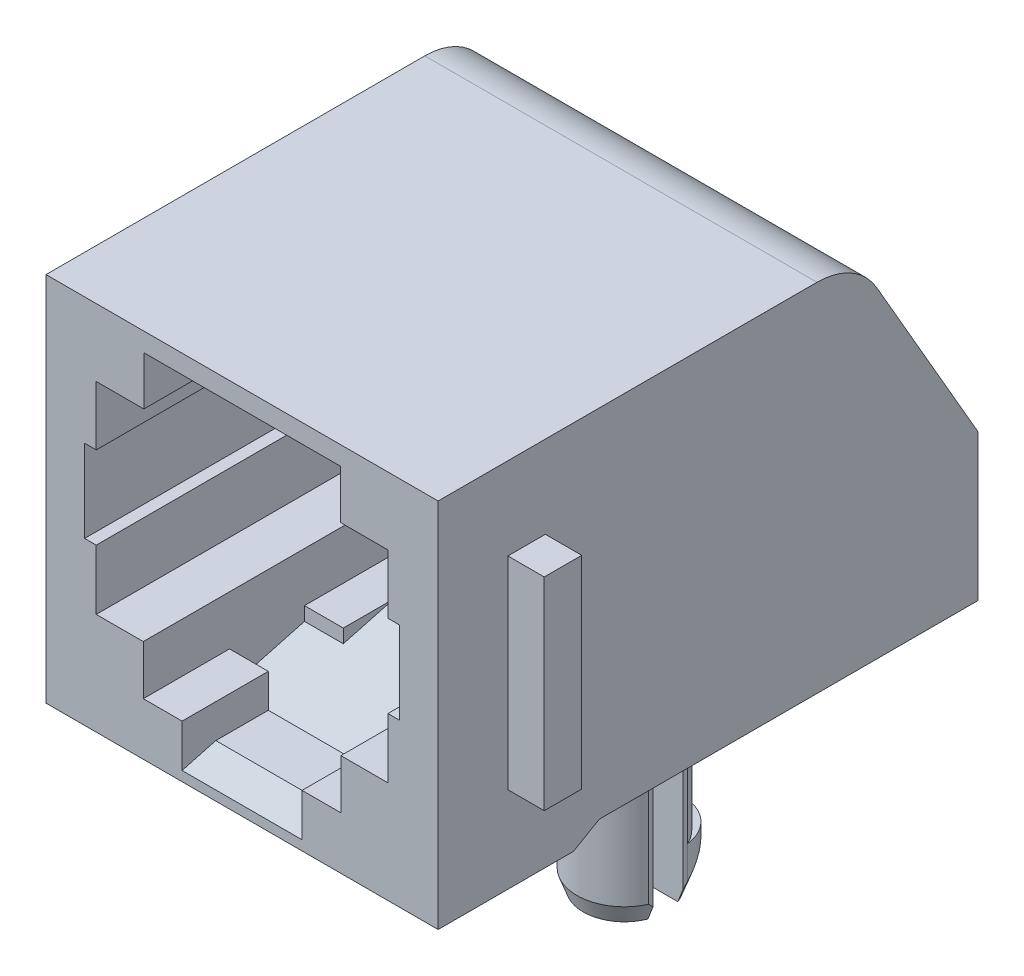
ISO-10303-21;
HEADER;
FILE_DESCRIPTION(('STEP AP214'),'2;1');
FILE_NAME('part.step','',(''),(''),'','','');
FILE_SCHEMA(('AUTOMOTIVE_DESIGN { 1 0 10303 214 1 1 1 1 }'));
ENDSEC;
DATA;
#1=APPLICATION_CONTEXT('core data for automotive mechanical design processes');
#2=APPLICATION_PROTOCOL_DEFINITION('international standard','automotive_design',2000,#1);
#3=PRODUCT_CONTEXT('',#1,'mechanical');
#4=PRODUCT('Part','Part','',(#3));
#5=PRODUCT_RELATED_PRODUCT_CATEGORY('part','',(#4));
#6=PRODUCT_DEFINITION_FORMATION('','',#4);
#7=PRODUCT_DEFINITION_CONTEXT('part definition',#1,'design');
#8=PRODUCT_DEFINITION('design','',#6,#7);
#9=PRODUCT_DEFINITION_SHAPE('','',#8);
#10=(LENGTH_UNIT() NAMED_UNIT(*) SI_UNIT(.MILLI.,.METRE.));
#11=(NAMED_UNIT(*) PLANE_ANGLE_UNIT() SI_UNIT($,.RADIAN.));
#12=(NAMED_UNIT(*) SI_UNIT($,.STERADIAN.) SOLID_ANGLE_UNIT());
#13=UNCERTAINTY_MEASURE_WITH_UNIT(LENGTH_MEASURE(1.E-05),#10,'distance_accuracy_value','');
#14=(GEOMETRIC_REPRESENTATION_CONTEXT(3) GLOBAL_UNCERTAINTY_ASSIGNED_CONTEXT((#13)) GLOBAL_UNIT_ASSIGNED_CONTEXT((#10,
#11,#12)) REPRESENTATION_CONTEXT('',''));
#15=CARTESIAN_POINT('',(0.,0.,0.));
#16=DIRECTION('',(0.,0.,1.));
#17=DIRECTION('',(1.,0.,0.));
#18=AXIS2_PLACEMENT_3D('',#15,#16,#17);
#19=CARTESIAN_POINT('',(-1.00639673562,0.9370367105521,-11.36938247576));
#20=DIRECTION('',(0.,-0.889896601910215,0.45616229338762));
#21=DIRECTION('',(0.,0.45616229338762,0.889896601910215));
#22=AXIS2_PLACEMENT_3D('',#19,#20,#21);
#23=PLANE('',#22);
#24=DIRECTION('',(1.,0.,0.));
#25=VECTOR('',#24,1.);
#26=CARTESIAN_POINT('',(-1.27,0.997104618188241,-11.2521999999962));
#27=LINE('',#26,#25);
#28=CARTESIAN_POINT('',(-1.4986,0.997104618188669,-11.2521999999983));
#29=VERTEX_POINT('',#28);
#30=CARTESIAN_POINT('',(-1.04140000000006,0.997104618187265,-11.2521999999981));
#31=VERTEX_POINT('',#30);
#32=EDGE_CURVE('E341',#29,#31,#27,.T.);
#33=ORIENTED_EDGE('',*,*,#32,.T.);
#34=DIRECTION('',(0.,0.45616229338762,0.889896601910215));
#35=VECTOR('',#34,1.);
#36=CARTESIAN_POINT('',(-1.04140000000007,0.9370367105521,-11.36938247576));
#37=LINE('',#36,#35);
#38=CARTESIAN_POINT('',(-1.04140000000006,4.00049999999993,-5.39307621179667));
#39=VERTEX_POINT('',#38);
#40=EDGE_CURVE('E18',#31,#39,#37,.T.);
#41=ORIENTED_EDGE('',*,*,#40,.T.);
#42=DIRECTION('',(-1.,0.,0.));
#43=VECTOR('',#42,1.);
#44=CARTESIAN_POINT('',(-1.27,4.00049999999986,-5.39307621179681));
#45=LINE('',#44,#43);
#46=CARTESIAN_POINT('',(-1.4986,4.00049999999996,-5.39307621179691));
#47=VERTEX_POINT('',#46);
#48=EDGE_CURVE('E943',#39,#47,#45,.T.);
#49=ORIENTED_EDGE('',*,*,#48,.T.);
#50=DIRECTION('',(0.,0.456162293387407,0.889896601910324));
#51=VECTOR('',#50,1.);
#52=CARTESIAN_POINT('',(-1.4986,0.9971046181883,-11.2522));
#53=LINE('',#52,#51);
#54=EDGE_CURVE('E957',#29,#47,#53,.T.);
#55=ORIENTED_EDGE('',*,*,#54,.F.);
#56=EDGE_LOOP('',(#33,#41,#49,#55));
#57=FACE_BOUND('',#56,.T.);
#58=ADVANCED_FACE('F14',(#57),#23,.T.);
#59=CARTESIAN_POINT('',(0.00960326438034,0.9370367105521,-11.36938247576));
#60=DIRECTION('',(0.,-0.889896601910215,0.45616229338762));
#61=DIRECTION('',(0.,0.45616229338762,0.889896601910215));
#62=AXIS2_PLACEMENT_3D('',#59,#60,#61);
#63=PLANE('',#62);
#64=DIRECTION('',(1.,0.,0.));
#65=VECTOR('',#64,1.);
#66=CARTESIAN_POINT('',(-0.25399999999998,0.997104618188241,-11.2521999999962));
#67=LINE('',#66,#65);
#68=CARTESIAN_POINT('',(-0.4826,0.997104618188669,-11.2521999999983));
#69=VERTEX_POINT('',#68);
#70=CARTESIAN_POINT('',(-0.0253999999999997,0.997104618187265,-11.2521999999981));
#71=VERTEX_POINT('',#70);
#72=EDGE_CURVE('E958',#69,#71,#67,.T.);
#73=ORIENTED_EDGE('',*,*,#72,.T.);
#74=DIRECTION('',(0.,0.45616229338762,0.889896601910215));
#75=VECTOR('',#74,1.);
#76=CARTESIAN_POINT('',(-0.0253999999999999,0.9370367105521,-11.36938247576));
#77=LINE('',#76,#75);
#78=CARTESIAN_POINT('',(-0.0253999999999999,4.00049999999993,-5.39307621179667));
#79=VERTEX_POINT('',#78);
#80=EDGE_CURVE('E966',#71,#79,#77,.T.);
#81=ORIENTED_EDGE('',*,*,#80,.T.);
#82=DIRECTION('',(-1.,0.,0.));
#83=VECTOR('',#82,1.);
#84=CARTESIAN_POINT('',(-0.25399999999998,4.00049999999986,-5.39307621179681));
#85=LINE('',#84,#83);
#86=CARTESIAN_POINT('',(-0.4826,4.00049999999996,-5.39307621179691));
#87=VERTEX_POINT('',#86);
#88=EDGE_CURVE('E942',#79,#87,#85,.T.);
#89=ORIENTED_EDGE('',*,*,#88,.T.);
#90=DIRECTION('',(0.,0.456162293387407,0.889896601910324));
#91=VECTOR('',#90,1.);
#92=CARTESIAN_POINT('',(-0.4826,0.9971046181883,-11.2522));
#93=LINE('',#92,#91);
#94=EDGE_CURVE('E972',#69,#87,#93,.T.);
#95=ORIENTED_EDGE('',*,*,#94,.F.);
#96=EDGE_LOOP('',(#73,#81,#89,#95));
#97=FACE_BOUND('',#96,.T.);
#98=ADVANCED_FACE('F2460',(#97),#63,.T.);
#99=CARTESIAN_POINT('',(1.02560326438,0.9370367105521,-11.36938247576));
#100=DIRECTION('',(0.,-0.889896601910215,0.45616229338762));
#101=DIRECTION('',(0.,0.45616229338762,0.889896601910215));
#102=AXIS2_PLACEMENT_3D('',#99,#100,#101);
#103=PLANE('',#102);
#104=DIRECTION('',(1.,0.,0.));
#105=VECTOR('',#104,1.);
#106=CARTESIAN_POINT('',(0.76199999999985,0.997104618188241,-11.2521999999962));
#107=LINE('',#106,#105);
#108=CARTESIAN_POINT('',(0.5334,0.997104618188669,-11.2521999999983));
#109=VERTEX_POINT('',#108);
#110=CARTESIAN_POINT('',(0.990599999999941,0.997104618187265,-11.2521999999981));
#111=VERTEX_POINT('',#110);
#112=EDGE_CURVE('E973',#109,#111,#107,.T.);
#113=ORIENTED_EDGE('',*,*,#112,.T.);
#114=DIRECTION('',(0.,0.45616229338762,0.889896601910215));
#115=VECTOR('',#114,1.);
#116=CARTESIAN_POINT('',(0.990599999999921,0.9370367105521,-11.36938247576));
#117=LINE('',#116,#115);
#118=CARTESIAN_POINT('',(0.990599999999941,4.00049999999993,-5.39307621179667));
#119=VERTEX_POINT('',#118);
#120=EDGE_CURVE('E981',#111,#119,#117,.T.);
#121=ORIENTED_EDGE('',*,*,#120,.T.);
#122=DIRECTION('',(-1.,0.,0.));
#123=VECTOR('',#122,1.);
#124=CARTESIAN_POINT('',(0.76199999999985,4.00049999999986,-5.39307621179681));
#125=LINE('',#124,#123);
#126=CARTESIAN_POINT('',(0.5334,4.00049999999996,-5.39307621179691));
#127=VERTEX_POINT('',#126);
#128=EDGE_CURVE('E960',#119,#127,#125,.T.);
#129=ORIENTED_EDGE('',*,*,#128,.T.);
#130=DIRECTION('',(0.,0.456162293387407,0.889896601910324));
#131=VECTOR('',#130,1.);
#132=CARTESIAN_POINT('',(0.5334,0.9971046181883,-11.2522));
#133=LINE('',#132,#131);
#134=EDGE_CURVE('E987',#109,#127,#133,.T.);
#135=ORIENTED_EDGE('',*,*,#134,.F.);
#136=EDGE_LOOP('',(#113,#121,#129,#135));
#137=FACE_BOUND('',#136,.T.);
#138=ADVANCED_FACE('F2452',(#137),#103,.T.);
#139=CARTESIAN_POINT('',(2.04160326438,0.9370367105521,-11.36938247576));
#140=DIRECTION('',(0.,-0.889896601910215,0.45616229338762));
#141=DIRECTION('',(0.,0.45616229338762,0.889896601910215));
#142=AXIS2_PLACEMENT_3D('',#139,#140,#141);
#143=PLANE('',#142);
#144=DIRECTION('',(1.,0.,0.));
#145=VECTOR('',#144,1.);
#146=CARTESIAN_POINT('',(1.778,0.997104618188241,-11.2521999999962));
#147=LINE('',#146,#145);
#148=CARTESIAN_POINT('',(1.5494,0.997104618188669,-11.2521999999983));
#149=VERTEX_POINT('',#148);
#150=CARTESIAN_POINT('',(2.00659999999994,0.997104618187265,-11.2521999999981));
#151=VERTEX_POINT('',#150);
#152=EDGE_CURVE('E988',#149,#151,#147,.T.);
#153=ORIENTED_EDGE('',*,*,#152,.T.);
#154=DIRECTION('',(0.,0.45616229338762,0.889896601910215));
#155=VECTOR('',#154,1.);
#156=CARTESIAN_POINT('',(2.00659999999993,0.9370367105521,-11.36938247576));
#157=LINE('',#156,#155);
#158=CARTESIAN_POINT('',(2.00659999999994,4.00049999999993,-5.39307621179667));
#159=VERTEX_POINT('',#158);
#160=EDGE_CURVE('E996',#151,#159,#157,.T.);
#161=ORIENTED_EDGE('',*,*,#160,.T.);
#162=DIRECTION('',(-1.,0.,0.));
#163=VECTOR('',#162,1.);
#164=CARTESIAN_POINT('',(1.778,4.00049999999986,-5.39307621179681));
#165=LINE('',#164,#163);
#166=CARTESIAN_POINT('',(1.5494,4.00049999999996,-5.39307621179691));
#167=VERTEX_POINT('',#166);
#168=EDGE_CURVE('E975',#159,#167,#165,.T.);
#169=ORIENTED_EDGE('',*,*,#168,.T.);
#170=DIRECTION('',(0.,0.456162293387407,0.889896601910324));
#171=VECTOR('',#170,1.);
#172=CARTESIAN_POINT('',(1.5494,0.9971046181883,-11.2522));
#173=LINE('',#172,#171);
#174=EDGE_CURVE('E922',#149,#167,#173,.T.);
#175=ORIENTED_EDGE('',*,*,#174,.F.);
#176=EDGE_LOOP('',(#153,#161,#169,#175));
#177=FACE_BOUND('',#176,.T.);
#178=ADVANCED_FACE('F2444',(#177),#143,.T.);
#179=CARTESIAN_POINT('',(-2.032,-5.992769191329,-7.330468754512));
#180=DIRECTION('',(-1.,0.,0.));
#181=DIRECTION('',(0.,0.,1.));
#182=AXIS2_PLACEMENT_3D('',#179,#180,#181);
#183=PLANE('',#182);
#184=DIRECTION('',(0.,0.,-1.));
#185=VECTOR('',#184,1.);
#186=CARTESIAN_POINT('',(-2.032,-4.5085,-3.5933670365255));
#187=LINE('',#186,#185);
#188=CARTESIAN_POINT('',(-2.032,-4.50850000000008,-5.461));
#189=VERTEX_POINT('',#188);
#190=CARTESIAN_POINT('',(-2.032,-4.5085,-7.18673407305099));
#191=VERTEX_POINT('',#190);
#192=EDGE_CURVE('E990',#189,#191,#187,.T.);
#193=ORIENTED_EDGE('',*,*,#192,.F.);
#194=DIRECTION('',(0.,-1.,0.));
#195=VECTOR('',#194,1.);
#196=CARTESIAN_POINT('',(-2.032,-4.7397045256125,-5.461));
#197=LINE('',#196,#195);
#198=CARTESIAN_POINT('',(-2.032,-4.97090905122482,-5.46099999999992));
#199=VERTEX_POINT('',#198);
#200=EDGE_CURVE('E1049',#189,#199,#197,.T.);
#201=ORIENTED_EDGE('',*,*,#200,.T.);
#202=DIRECTION('',(0.,0.258819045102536,-0.965925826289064));
#203=VECTOR('',#202,1.);
#204=CARTESIAN_POINT('',(-2.032,-5.08,-5.0538670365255));
#205=LINE('',#204,#203);
#206=EDGE_CURVE('E1053',#199,#191,#205,.T.);
#207=ORIENTED_EDGE('',*,*,#206,.T.);
#208=EDGE_LOOP('',(#193,#201,#207));
#209=FACE_BOUND('',#208,.T.);
#210=ADVANCED_FACE('F2436',(#209),#183,.F.);
#211=CARTESIAN_POINT('',(2.032,-5.992769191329,-7.330468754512));
#212=DIRECTION('',(-1.,0.,0.));
#213=DIRECTION('',(0.,0.,1.));
#214=AXIS2_PLACEMENT_3D('',#211,#212,#213);
#215=PLANE('',#214);
#216=DIRECTION('',(0.,0.,-1.));
#217=VECTOR('',#216,1.);
#218=CARTESIAN_POINT('',(2.032,-4.5085,-3.5933670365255));
#219=LINE('',#218,#217);
#220=CARTESIAN_POINT('',(2.032,-4.50850000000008,-5.461));
#221=VERTEX_POINT('',#220);
#222=CARTESIAN_POINT('',(2.032,-4.5085,-7.18673407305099));
#223=VERTEX_POINT('',#222);
#224=EDGE_CURVE('E3116',#221,#223,#219,.T.);
#225=ORIENTED_EDGE('',*,*,#224,.T.);
#226=DIRECTION('',(0.,-0.258819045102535,0.965925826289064));
#227=VECTOR('',#226,1.);
#228=CARTESIAN_POINT('',(2.032,-5.08,-5.0538670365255));
#229=LINE('',#228,#227);
#230=CARTESIAN_POINT('',(2.032,-4.97090905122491,-5.46099999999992));
#231=VERTEX_POINT('',#230);
#232=EDGE_CURVE('E1046',#223,#231,#229,.T.);
#233=ORIENTED_EDGE('',*,*,#232,.T.);
#234=DIRECTION('',(0.,1.,0.));
#235=VECTOR('',#234,1.);
#236=CARTESIAN_POINT('',(2.032,-4.7397045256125,-5.461));
#237=LINE('',#236,#235);
#238=EDGE_CURVE('E1042',#231,#221,#237,.T.);
#239=ORIENTED_EDGE('',*,*,#238,.T.);
#240=EDGE_LOOP('',(#225,#233,#239));
#241=FACE_BOUND('',#240,.T.);
#242=ADVANCED_FACE('F2428',(#241),#215,.T.);
#243=CARTESIAN_POINT('',(3.480308,-5.005912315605,-5.461));
#244=DIRECTION('',(0.,0.,-1.));
#245=DIRECTION('',(-1.,0.,0.));
#246=AXIS2_PLACEMENT_3D('',#243,#244,#245);
#247=PLANE('',#246);
#248=DIRECTION('',(1.,0.,0.));
#249=VECTOR('',#248,1.);
#250=CARTESIAN_POINT('',(0.,-4.970909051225,-5.46099999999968));
#251=LINE('',#250,#249);
#252=CARTESIAN_POINT('',(-3.34645,-4.97090905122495,-5.46099999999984));
#253=VERTEX_POINT('',#252);
#254=EDGE_CURVE('E1050',#253,#199,#251,.T.);
#255=ORIENTED_EDGE('',*,*,#254,.T.);
#256=ORIENTED_EDGE('',*,*,#200,.F.);
#257=DIRECTION('',(-1.,0.,0.));
#258=VECTOR('',#257,1.);
#259=CARTESIAN_POINT('',(0.,-4.5085,-5.461));
#260=LINE('',#259,#258);
#261=CARTESIAN_POINT('',(-3.34645,-4.50850000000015,-5.461));
#262=VERTEX_POINT('',#261);
#263=EDGE_CURVE('E1033',#189,#262,#260,.T.);
#264=ORIENTED_EDGE('',*,*,#263,.T.);
#265=DIRECTION('',(0.,1.,0.));
#266=VECTOR('',#265,1.);
#267=CARTESIAN_POINT('',(-3.34645,-4.7397045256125,-5.461));
#268=LINE('',#267,#266);
#269=EDGE_CURVE('E1043',#253,#262,#268,.T.);
#270=ORIENTED_EDGE('',*,*,#269,.F.);
#271=EDGE_LOOP('',(#255,#256,#264,#270));
#272=FACE_BOUND('',#271,.T.);
#273=ADVANCED_FACE('F2420',(#272),#247,.F.);
#274=CARTESIAN_POINT('',(3.480308,-5.005912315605,-5.461));
#275=DIRECTION('',(0.,0.,-1.));
#276=DIRECTION('',(-1.,0.,0.));
#277=AXIS2_PLACEMENT_3D('',#274,#275,#276);
#278=PLANE('',#277);
#279=DIRECTION('',(1.,0.,0.));
#280=VECTOR('',#279,1.);
#281=CARTESIAN_POINT('',(0.,-4.970909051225,-5.46099999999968));
#282=LINE('',#281,#280);
#283=CARTESIAN_POINT('',(3.34645,-4.97090905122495,-5.46099999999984));
#284=VERTEX_POINT('',#283);
#285=EDGE_CURVE('E1034',#231,#284,#282,.T.);
#286=ORIENTED_EDGE('',*,*,#285,.T.);
#287=DIRECTION('',(0.,-1.,0.));
#288=VECTOR('',#287,1.);
#289=CARTESIAN_POINT('',(3.34645,-4.7397045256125,-5.461));
#290=LINE('',#289,#288);
#291=CARTESIAN_POINT('',(3.34645,-4.50850000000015,-5.461));
#292=VERTEX_POINT('',#291);
#293=EDGE_CURVE('E1040',#292,#284,#290,.T.);
#294=ORIENTED_EDGE('',*,*,#293,.F.);
#295=DIRECTION('',(-1.,0.,0.));
#296=VECTOR('',#295,1.);
#297=CARTESIAN_POINT('',(0.,-4.5085,-5.461));
#298=LINE('',#297,#296);
#299=EDGE_CURVE('E2806',#292,#221,#298,.T.);
#300=ORIENTED_EDGE('',*,*,#299,.T.);
#301=ORIENTED_EDGE('',*,*,#238,.F.);
#302=EDGE_LOOP('',(#286,#294,#300,#301));
#303=FACE_BOUND('',#302,.T.);
#304=ADVANCED_FACE('F2412',(#303),#278,.F.);
#305=CARTESIAN_POINT('',(-3.480308,-4.5085,-13.031724));
#306=DIRECTION('',(0.,-1.,0.));
#307=DIRECTION('',(1.,0.,0.));
#308=AXIS2_PLACEMENT_3D('',#305,#306,#307);
#309=PLANE('',#308);
#310=DIRECTION('',(-1.,0.,0.));
#311=VECTOR('',#310,1.);
#312=CARTESIAN_POINT('',(0.,-4.5085,0.));
#313=LINE('',#312,#311);
#314=CARTESIAN_POINT('',(3.34645,-4.5085,0.));
#315=VERTEX_POINT('',#314);
#316=CARTESIAN_POINT('',(2.032,-4.5085,0.));
#317=VERTEX_POINT('',#316);
#318=EDGE_CURVE('E2959',#315,#317,#313,.T.);
#319=ORIENTED_EDGE('',*,*,#318,.F.);
#320=DIRECTION('',(0.,0.,-1.));
#321=VECTOR('',#320,1.);
#322=CARTESIAN_POINT('',(3.34645,-4.5085,-6.3881));
#323=LINE('',#322,#321);
#324=CARTESIAN_POINT('',(3.34645,-4.50850000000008,-2.921));
#325=VERTEX_POINT('',#324);
#326=EDGE_CURVE('E1039',#315,#325,#323,.T.);
#327=ORIENTED_EDGE('',*,*,#326,.T.);
#328=DIRECTION('',(-1.,0.,0.));
#329=VECTOR('',#328,1.);
#330=CARTESIAN_POINT('',(0.,-4.50850000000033,-2.921));
#331=LINE('',#330,#329);
#332=CARTESIAN_POINT('',(2.032,-4.50850000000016,-2.921));
#333=VERTEX_POINT('',#332);
#334=EDGE_CURVE('E2968',#325,#333,#331,.T.);
#335=ORIENTED_EDGE('',*,*,#334,.T.);
#336=DIRECTION('',(0.,0.,-1.));
#337=VECTOR('',#336,1.);
#338=CARTESIAN_POINT('',(2.032,-4.5085,-3.5933670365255));
#339=LINE('',#338,#337);
#340=EDGE_CURVE('E1020',#317,#333,#339,.T.);
#341=ORIENTED_EDGE('',*,*,#340,.F.);
#342=EDGE_LOOP('',(#319,#327,#335,#341));
#343=FACE_BOUND('',#342,.T.);
#344=ADVANCED_FACE('F2404',(#343),#309,.F.);
#345=CARTESIAN_POINT('',(-3.480308,-5.68650326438,-2.921));
#346=DIRECTION('',(0.,0.,1.));
#347=DIRECTION('',(1.,0.,0.));
#348=AXIS2_PLACEMENT_3D('',#345,#346,#347);
#349=PLANE('',#348);
#350=DIRECTION('',(-1.,0.,0.));
#351=VECTOR('',#350,1.);
#352=CARTESIAN_POINT('',(0.,-5.65150000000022,-2.92099999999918));
#353=LINE('',#352,#351);
#354=CARTESIAN_POINT('',(3.34645,-5.65150000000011,-2.92099999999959));
#355=VERTEX_POINT('',#354);
#356=CARTESIAN_POINT('',(2.032,-5.65150000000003,-2.9209999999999));
#357=VERTEX_POINT('',#356);
#358=EDGE_CURVE('E1030',#355,#357,#353,.T.);
#359=ORIENTED_EDGE('',*,*,#358,.T.);
#360=DIRECTION('',(0.,-1.,0.));
#361=VECTOR('',#360,1.);
#362=CARTESIAN_POINT('',(2.032,-5.2331329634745,-2.921));
#363=LINE('',#362,#361);
#364=EDGE_CURVE('E2784',#333,#357,#363,.T.);
#365=ORIENTED_EDGE('',*,*,#364,.F.);
#366=ORIENTED_EDGE('',*,*,#334,.F.);
#367=DIRECTION('',(0.,-1.,0.));
#368=VECTOR('',#367,1.);
#369=CARTESIAN_POINT('',(3.34645,-3.6703,-2.921));
#370=LINE('',#369,#368);
#371=EDGE_CURVE('E1035',#325,#355,#370,.T.);
#372=ORIENTED_EDGE('',*,*,#371,.T.);
#373=EDGE_LOOP('',(#359,#365,#366,#372));
#374=FACE_BOUND('',#373,.T.);
#375=ADVANCED_FACE('F2396',(#374),#349,.F.);
#376=CARTESIAN_POINT('',(-3.480308,-5.68650326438,-2.921));
#377=DIRECTION('',(0.,0.,1.));
#378=DIRECTION('',(1.,0.,0.));
#379=AXIS2_PLACEMENT_3D('',#376,#377,#378);
#380=PLANE('',#379);
#381=DIRECTION('',(-1.,0.,0.));
#382=VECTOR('',#381,1.);
#383=CARTESIAN_POINT('',(0.,-5.65150000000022,-2.92099999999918));
#384=LINE('',#383,#382);
#385=CARTESIAN_POINT('',(-2.032,-5.65150000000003,-2.9209999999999));
#386=VERTEX_POINT('',#385);
#387=CARTESIAN_POINT('',(-3.34645,-5.65150000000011,-2.92099999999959));
#388=VERTEX_POINT('',#387);
#389=EDGE_CURVE('E1054',#386,#388,#384,.T.);
#390=ORIENTED_EDGE('',*,*,#389,.T.);
#391=DIRECTION('',(0.,1.,0.));
#392=VECTOR('',#391,1.);
#393=CARTESIAN_POINT('',(-3.34645,-3.6703,-2.921));
#394=LINE('',#393,#392);
#395=CARTESIAN_POINT('',(-3.34645,-4.50850000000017,-2.921));
#396=VERTEX_POINT('',#395);
#397=EDGE_CURVE('E1056',#388,#396,#394,.T.);
#398=ORIENTED_EDGE('',*,*,#397,.T.);
#399=DIRECTION('',(1.,0.,0.));
#400=VECTOR('',#399,1.);
#401=CARTESIAN_POINT('',(0.,-4.5085,-2.921));
#402=LINE('',#401,#400);
#403=CARTESIAN_POINT('',(-2.032,-4.50850000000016,-2.921));
#404=VERTEX_POINT('',#403);
#405=EDGE_CURVE('E2975',#396,#404,#402,.T.);
#406=ORIENTED_EDGE('',*,*,#405,.T.);
#407=DIRECTION('',(0.,-1.,0.));
#408=VECTOR('',#407,1.);
#409=CARTESIAN_POINT('',(-2.032,-5.2331329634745,-2.921));
#410=LINE('',#409,#408);
#411=EDGE_CURVE('E2783',#404,#386,#410,.T.);
#412=ORIENTED_EDGE('',*,*,#411,.T.);
#413=EDGE_LOOP('',(#390,#398,#406,#412));
#414=FACE_BOUND('',#413,.T.);
#415=ADVANCED_FACE('F2388',(#414),#380,.F.);
#416=CARTESIAN_POINT('',(-3.480308,-4.5085,-13.031724));
#417=DIRECTION('',(0.,-1.,0.));
#418=DIRECTION('',(1.,0.,0.));
#419=AXIS2_PLACEMENT_3D('',#416,#417,#418);
#420=PLANE('',#419);
#421=DIRECTION('',(-1.,0.,0.));
#422=VECTOR('',#421,1.);
#423=CARTESIAN_POINT('',(0.,-4.5085,0.));
#424=LINE('',#423,#422);
#425=CARTESIAN_POINT('',(-2.032,-4.5085,0.));
#426=VERTEX_POINT('',#425);
#427=CARTESIAN_POINT('',(-3.34645,-4.5085,0.));
#428=VERTEX_POINT('',#427);
#429=EDGE_CURVE('E951',#426,#428,#424,.T.);
#430=ORIENTED_EDGE('',*,*,#429,.F.);
#431=DIRECTION('',(0.,0.,-1.));
#432=VECTOR('',#431,1.);
#433=CARTESIAN_POINT('',(-2.032,-4.5085,-3.5933670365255));
#434=LINE('',#433,#432);
#435=EDGE_CURVE('E1028',#426,#404,#434,.T.);
#436=ORIENTED_EDGE('',*,*,#435,.T.);
#437=ORIENTED_EDGE('',*,*,#405,.F.);
#438=DIRECTION('',(0.,0.,1.));
#439=VECTOR('',#438,1.);
#440=CARTESIAN_POINT('',(-3.34645,-4.5085,-6.3881));
#441=LINE('',#440,#439);
#442=EDGE_CURVE('E1059',#396,#428,#441,.T.);
#443=ORIENTED_EDGE('',*,*,#442,.T.);
#444=EDGE_LOOP('',(#430,#436,#437,#443));
#445=FACE_BOUND('',#444,.T.);
#446=ADVANCED_FACE('F2380',(#445),#420,.F.);
#447=CARTESIAN_POINT('',(-1.0414,0.9370367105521,-11.36938247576));
#448=DIRECTION('',(-1.,0.,0.));
#449=DIRECTION('',(0.,0.,1.));
#450=AXIS2_PLACEMENT_3D('',#447,#448,#449);
#451=PLANE('',#450);
#452=DIRECTION('',(0.,-1.,0.));
#453=VECTOR('',#452,1.);
#454=CARTESIAN_POINT('',(-1.0414,1.6637,-11.2522));
#455=LINE('',#454,#453);
#456=CARTESIAN_POINT('',(-1.04140000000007,1.39670160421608,-11.2521999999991));
#457=VERTEX_POINT('',#456);
#458=EDGE_CURVE('E944',#457,#31,#455,.T.);
#459=ORIENTED_EDGE('',*,*,#458,.F.);
#460=DIRECTION('',(0.,-0.456162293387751,-0.889896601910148));
#461=VECTOR('',#460,1.);
#462=CARTESIAN_POINT('',(-1.0414000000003,2.6986008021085,-8.7124116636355));
#463=LINE('',#462,#461);
#464=CARTESIAN_POINT('',(-1.04140000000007,4.0005000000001,-6.17262332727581));
#465=VERTEX_POINT('',#464);
#466=EDGE_CURVE('E999',#465,#457,#463,.T.);
#467=ORIENTED_EDGE('',*,*,#466,.F.);
#468=DIRECTION('',(0.,0.,-1.));
#469=VECTOR('',#468,1.);
#470=CARTESIAN_POINT('',(-1.0414,4.0005,-8.3226381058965));
#471=LINE('',#470,#469);
#472=EDGE_CURVE('E949',#39,#465,#471,.T.);
#473=ORIENTED_EDGE('',*,*,#472,.F.);
#474=ORIENTED_EDGE('',*,*,#40,.F.);
#475=EDGE_LOOP('',(#459,#467,#473,#474));
#476=FACE_BOUND('',#475,.T.);
#477=ADVANCED_FACE('F2372',(#476),#451,.F.);
#478=CARTESIAN_POINT('',(-1.4986,0.9370367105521,-11.36938247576));
#479=DIRECTION('',(-1.,0.,0.));
#480=DIRECTION('',(0.,0.,1.));
#481=AXIS2_PLACEMENT_3D('',#478,#479,#480);
#482=PLANE('',#481);
#483=DIRECTION('',(0.,1.,0.));
#484=VECTOR('',#483,1.);
#485=CARTESIAN_POINT('',(-1.4986,1.6637,-11.2522));
#486=LINE('',#485,#484);
#487=CARTESIAN_POINT('',(-1.49859999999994,1.39670160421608,-11.2521999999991));
#488=VERTEX_POINT('',#487);
#489=EDGE_CURVE('E947',#29,#488,#486,.T.);
#490=ORIENTED_EDGE('',*,*,#489,.F.);
#491=ORIENTED_EDGE('',*,*,#54,.T.);
#492=DIRECTION('',(0.,0.,-1.));
#493=VECTOR('',#492,1.);
#494=CARTESIAN_POINT('',(-1.4986,4.0005,-8.3226381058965));
#495=LINE('',#494,#493);
#496=CARTESIAN_POINT('',(-1.49859999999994,4.0005000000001,-6.17262332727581));
#497=VERTEX_POINT('',#496);
#498=EDGE_CURVE('E955',#47,#497,#495,.T.);
#499=ORIENTED_EDGE('',*,*,#498,.T.);
#500=DIRECTION('',(0.,0.456162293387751,0.889896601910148));
#501=VECTOR('',#500,1.);
#502=CARTESIAN_POINT('',(-1.49859999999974,2.6986008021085,-8.7124116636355));
#503=LINE('',#502,#501);
#504=EDGE_CURVE('E2497',#488,#497,#503,.T.);
#505=ORIENTED_EDGE('',*,*,#504,.F.);
#506=EDGE_LOOP('',(#490,#491,#499,#505));
#507=FACE_BOUND('',#506,.T.);
#508=ADVANCED_FACE('F2364',(#507),#482,.T.);
#509=CARTESIAN_POINT('',(-0.0254,0.9370367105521,-11.36938247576));
#510=DIRECTION('',(-1.,0.,0.));
#511=DIRECTION('',(0.,0.,1.));
#512=AXIS2_PLACEMENT_3D('',#509,#510,#511);
#513=PLANE('',#512);
#514=DIRECTION('',(0.,-1.,0.));
#515=VECTOR('',#514,1.);
#516=CARTESIAN_POINT('',(-0.0253999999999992,1.6637,-11.2522));
#517=LINE('',#516,#515);
#518=CARTESIAN_POINT('',(-0.0253999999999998,1.39670160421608,-11.2521999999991));
#519=VERTEX_POINT('',#518);
#520=EDGE_CURVE('E954',#519,#71,#517,.T.);
#521=ORIENTED_EDGE('',*,*,#520,.F.);
#522=DIRECTION('',(0.,-0.456162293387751,-0.889896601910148));
#523=VECTOR('',#522,1.);
#524=CARTESIAN_POINT('',(-0.0254,2.6986008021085,-8.7124116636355));
#525=LINE('',#524,#523);
#526=CARTESIAN_POINT('',(-0.0254000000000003,4.0005000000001,-6.17262332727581));
#527=VERTEX_POINT('',#526);
#528=EDGE_CURVE('E2493',#527,#519,#525,.T.);
#529=ORIENTED_EDGE('',*,*,#528,.F.);
#530=DIRECTION('',(0.,0.,-1.));
#531=VECTOR('',#530,1.);
#532=CARTESIAN_POINT('',(-0.0254,4.0005,-8.3226381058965));
#533=LINE('',#532,#531);
#534=EDGE_CURVE('E964',#79,#527,#533,.T.);
#535=ORIENTED_EDGE('',*,*,#534,.F.);
#536=ORIENTED_EDGE('',*,*,#80,.F.);
#537=EDGE_LOOP('',(#521,#529,#535,#536));
#538=FACE_BOUND('',#537,.T.);
#539=ADVANCED_FACE('F2356',(#538),#513,.F.);
#540=CARTESIAN_POINT('',(-0.4826,0.9370367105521,-11.36938247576));
#541=DIRECTION('',(-1.,0.,0.));
#542=DIRECTION('',(0.,0.,1.));
#543=AXIS2_PLACEMENT_3D('',#540,#541,#542);
#544=PLANE('',#543);
#545=DIRECTION('',(0.,1.,0.));
#546=VECTOR('',#545,1.);
#547=CARTESIAN_POINT('',(-0.482599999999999,1.6637,-11.2522));
#548=LINE('',#547,#546);
#549=CARTESIAN_POINT('',(-0.4826,1.39670160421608,-11.2521999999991));
#550=VERTEX_POINT('',#549);
#551=EDGE_CURVE('E963',#69,#550,#548,.T.);
#552=ORIENTED_EDGE('',*,*,#551,.F.);
#553=ORIENTED_EDGE('',*,*,#94,.T.);
#554=DIRECTION('',(0.,0.,-1.));
#555=VECTOR('',#554,1.);
#556=CARTESIAN_POINT('',(-0.4826,4.0005,-8.3226381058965));
#557=LINE('',#556,#555);
#558=CARTESIAN_POINT('',(-0.4826,4.0005000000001,-6.17262332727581));
#559=VERTEX_POINT('',#558);
#560=EDGE_CURVE('E970',#87,#559,#557,.T.);
#561=ORIENTED_EDGE('',*,*,#560,.T.);
#562=DIRECTION('',(0.,0.456162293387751,0.889896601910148));
#563=VECTOR('',#562,1.);
#564=CARTESIAN_POINT('',(-0.4826,2.6986008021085,-8.7124116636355));
#565=LINE('',#564,#563);
#566=EDGE_CURVE('E2492',#550,#559,#565,.T.);
#567=ORIENTED_EDGE('',*,*,#566,.F.);
#568=EDGE_LOOP('',(#552,#553,#561,#567));
#569=FACE_BOUND('',#568,.T.);
#570=ADVANCED_FACE('F2348',(#569),#544,.T.);
#571=CARTESIAN_POINT('',(0.9906,0.9370367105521,-11.36938247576));
#572=DIRECTION('',(-1.,0.,0.));
#573=DIRECTION('',(0.,0.,1.));
#574=AXIS2_PLACEMENT_3D('',#571,#572,#573);
#575=PLANE('',#574);
#576=DIRECTION('',(0.,-1.,0.));
#577=VECTOR('',#576,1.);
#578=CARTESIAN_POINT('',(0.9906,1.6637,-11.2522));
#579=LINE('',#578,#577);
#580=CARTESIAN_POINT('',(0.990599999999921,1.39670160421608,-11.2521999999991));
#581=VERTEX_POINT('',#580);
#582=EDGE_CURVE('E969',#581,#111,#579,.T.);
#583=ORIENTED_EDGE('',*,*,#582,.F.);
#584=DIRECTION('',(0.,-0.456162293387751,-0.889896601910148));
#585=VECTOR('',#584,1.);
#586=CARTESIAN_POINT('',(0.990599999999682,2.6986008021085,-8.7124116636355));
#587=LINE('',#586,#585);
#588=CARTESIAN_POINT('',(0.99059999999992,4.0005000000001,-6.17262332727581));
#589=VERTEX_POINT('',#588);
#590=EDGE_CURVE('E2495',#589,#581,#587,.T.);
#591=ORIENTED_EDGE('',*,*,#590,.F.);
#592=DIRECTION('',(0.,0.,-1.));
#593=VECTOR('',#592,1.);
#594=CARTESIAN_POINT('',(0.9906,4.0005,-8.3226381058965));
#595=LINE('',#594,#593);
#596=EDGE_CURVE('E979',#119,#589,#595,.T.);
#597=ORIENTED_EDGE('',*,*,#596,.F.);
#598=ORIENTED_EDGE('',*,*,#120,.F.);
#599=EDGE_LOOP('',(#583,#591,#597,#598));
#600=FACE_BOUND('',#599,.T.);
#601=ADVANCED_FACE('F2340',(#600),#575,.F.);
#602=CARTESIAN_POINT('',(0.5334,0.9370367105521,-11.36938247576));
#603=DIRECTION('',(-1.,0.,0.));
#604=DIRECTION('',(0.,0.,1.));
#605=AXIS2_PLACEMENT_3D('',#602,#603,#604);
#606=PLANE('',#605);
#607=DIRECTION('',(0.,1.,0.));
#608=VECTOR('',#607,1.);
#609=CARTESIAN_POINT('',(0.5334,1.6637,-11.2522));
#610=LINE('',#609,#608);
#611=CARTESIAN_POINT('',(0.533399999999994,1.39670160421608,-11.2521999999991));
#612=VERTEX_POINT('',#611);
#613=EDGE_CURVE('E978',#109,#612,#610,.T.);
#614=ORIENTED_EDGE('',*,*,#613,.F.);
#615=ORIENTED_EDGE('',*,*,#134,.T.);
#616=DIRECTION('',(0.,0.,-1.));
#617=VECTOR('',#616,1.);
#618=CARTESIAN_POINT('',(0.5334,4.0005,-8.3226381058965));
#619=LINE('',#618,#617);
#620=CARTESIAN_POINT('',(0.533399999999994,4.0005000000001,-6.17262332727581));
#621=VERTEX_POINT('',#620);
#622=EDGE_CURVE('E985',#127,#621,#619,.T.);
#623=ORIENTED_EDGE('',*,*,#622,.T.);
#624=DIRECTION('',(0.,0.456162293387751,0.889896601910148));
#625=VECTOR('',#624,1.);
#626=CARTESIAN_POINT('',(0.533399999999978,2.6986008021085,-8.7124116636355));
#627=LINE('',#626,#625);
#628=EDGE_CURVE('E2501',#612,#621,#627,.T.);
#629=ORIENTED_EDGE('',*,*,#628,.F.);
#630=EDGE_LOOP('',(#614,#615,#623,#629));
#631=FACE_BOUND('',#630,.T.);
#632=ADVANCED_FACE('F2332',(#631),#606,.T.);
#633=CARTESIAN_POINT('',(2.0066,0.9370367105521,-11.36938247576));
#634=DIRECTION('',(-1.,0.,0.));
#635=DIRECTION('',(0.,0.,1.));
#636=AXIS2_PLACEMENT_3D('',#633,#634,#635);
#637=PLANE('',#636);
#638=DIRECTION('',(0.,-1.,0.));
#639=VECTOR('',#638,1.);
#640=CARTESIAN_POINT('',(2.0066,1.6637,-11.2522));
#641=LINE('',#640,#639);
#642=CARTESIAN_POINT('',(2.00659999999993,1.39670160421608,-11.2521999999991));
#643=VERTEX_POINT('',#642);
#644=EDGE_CURVE('E984',#643,#151,#641,.T.);
#645=ORIENTED_EDGE('',*,*,#644,.F.);
#646=DIRECTION('',(0.,-0.456162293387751,-0.889896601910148));
#647=VECTOR('',#646,1.);
#648=CARTESIAN_POINT('',(2.0065999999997,2.6986008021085,-8.7124116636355));
#649=LINE('',#648,#647);
#650=CARTESIAN_POINT('',(2.00659999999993,4.0005000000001,-6.17262332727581));
#651=VERTEX_POINT('',#650);
#652=EDGE_CURVE('E2504',#651,#643,#649,.T.);
#653=ORIENTED_EDGE('',*,*,#652,.F.);
#654=DIRECTION('',(0.,0.,-1.));
#655=VECTOR('',#654,1.);
#656=CARTESIAN_POINT('',(2.0066,4.0005,-8.3226381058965));
#657=LINE('',#656,#655);
#658=EDGE_CURVE('E994',#159,#651,#657,.T.);
#659=ORIENTED_EDGE('',*,*,#658,.F.);
#660=ORIENTED_EDGE('',*,*,#160,.F.);
#661=EDGE_LOOP('',(#645,#653,#659,#660));
#662=FACE_BOUND('',#661,.T.);
#663=ADVANCED_FACE('F2324',(#662),#637,.F.);
#664=CARTESIAN_POINT('',(1.5494,0.9370367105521,-11.36938247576));
#665=DIRECTION('',(-1.,0.,0.));
#666=DIRECTION('',(0.,0.,1.));
#667=AXIS2_PLACEMENT_3D('',#664,#665,#666);
#668=PLANE('',#667);
#669=DIRECTION('',(0.,1.,0.));
#670=VECTOR('',#669,1.);
#671=CARTESIAN_POINT('',(1.5494,1.6637,-11.2522));
#672=LINE('',#671,#670);
#673=CARTESIAN_POINT('',(1.54940000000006,1.39670160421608,-11.2521999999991));
#674=VERTEX_POINT('',#673);
#675=EDGE_CURVE('E993',#149,#674,#672,.T.);
#676=ORIENTED_EDGE('',*,*,#675,.F.);
#677=ORIENTED_EDGE('',*,*,#174,.T.);
#678=DIRECTION('',(0.,0.,-1.));
#679=VECTOR('',#678,1.);
#680=CARTESIAN_POINT('',(1.5494,4.0005,-8.3226381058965));
#681=LINE('',#680,#679);
#682=CARTESIAN_POINT('',(1.54940000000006,4.0005000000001,-6.17262332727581));
#683=VERTEX_POINT('',#682);
#684=EDGE_CURVE('E1000',#167,#683,#681,.T.);
#685=ORIENTED_EDGE('',*,*,#684,.T.);
#686=DIRECTION('',(0.,0.456162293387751,0.889896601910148));
#687=VECTOR('',#686,1.);
#688=CARTESIAN_POINT('',(1.54940000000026,2.6986008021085,-8.7124116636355));
#689=LINE('',#688,#687);
#690=EDGE_CURVE('E2509',#674,#683,#689,.T.);
#691=ORIENTED_EDGE('',*,*,#690,.F.);
#692=EDGE_LOOP('',(#676,#677,#685,#691));
#693=FACE_BOUND('',#692,.T.);
#694=ADVANCED_FACE('F2317',(#693),#668,.T.);
#695=CARTESIAN_POINT('',(5.08,-8.08990000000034,-8.382));
#696=DIRECTION('',(0.,-1.,0.));
#697=DIRECTION('',(0.,0.,-1.));
#698=AXIS2_PLACEMENT_3D('',#695,#696,#697);
#699=CYLINDRICAL_SURFACE('',#698,1.4732);
#700=CARTESIAN_POINT('',(5.08,-8.08990000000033,-8.382));
#701=DIRECTION('',(0.,-1.,0.));
#702=DIRECTION('',(0.,0.,-1.));
#703=AXIS2_PLACEMENT_3D('',#700,#701,#702);
#704=CIRCLE('',#703,1.4732);
#705=CARTESIAN_POINT('',(3.61668084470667,-8.08990000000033,-8.55233875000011));
#706=VERTEX_POINT('',#705);
#707=CARTESIAN_POINT('',(6.54331915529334,-8.08990000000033,-8.55233875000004));
#708=VERTEX_POINT('',#707);
#709=EDGE_CURVE('E2518',#706,#708,#704,.T.);
#710=ORIENTED_EDGE('',*,*,#709,.T.);
#711=DIRECTION('',(0.,1.,0.));
#712=VECTOR('',#711,1.);
#713=CARTESIAN_POINT('',(6.54331915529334,-8.64420981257,-8.55233875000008));
#714=LINE('',#713,#712);
#715=CARTESIAN_POINT('',(6.54331915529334,-9.19851962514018,-8.55233875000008));
#716=VERTEX_POINT('',#715);
#717=EDGE_CURVE('E919',#716,#708,#714,.T.);
#718=ORIENTED_EDGE('',*,*,#717,.F.);
#719=CARTESIAN_POINT('',(6.54331915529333,-9.19851962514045,-8.55233875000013));
#720=CARTESIAN_POINT('',(6.5321912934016,-9.11548819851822,-8.64819252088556));
#721=CARTESIAN_POINT('',(6.51131311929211,-9.03408291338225,-8.74505872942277));
#722=CARTESIAN_POINT('',(6.44830504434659,-8.87640343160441,-8.93731579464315));
#723=CARTESIAN_POINT('',(6.40600526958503,-8.80017586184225,-9.03268847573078));
#724=CARTESIAN_POINT('',(6.31239860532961,-8.67473281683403,-9.19302384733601));
#725=CARTESIAN_POINT('',(6.26623252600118,-8.62362276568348,-9.25948311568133));
#726=CARTESIAN_POINT('',(6.16110600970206,-8.52754443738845,-9.38612499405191));
#727=CARTESIAN_POINT('',(6.10219063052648,-8.48255541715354,-9.44632863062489));
#728=CARTESIAN_POINT('',(5.98236471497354,-8.40688359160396,-9.54871415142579));
#729=CARTESIAN_POINT('',(5.92332226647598,-8.37506385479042,-9.59223566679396));
#730=CARTESIAN_POINT('',(5.79707021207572,-8.31785798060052,-9.67105388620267));
#731=CARTESIAN_POINT('',(5.72985877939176,-8.29247328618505,-9.70634874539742));
#732=CARTESIAN_POINT('',(5.58823520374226,-8.24913645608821,-9.76691157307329));
#733=CARTESIAN_POINT('',(5.51378021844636,-8.23123233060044,-9.79211473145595));
#734=CARTESIAN_POINT('',(5.36032182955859,-8.20407779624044,-9.83043931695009));
#735=CARTESIAN_POINT('',(5.28132209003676,-8.19482051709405,-9.84357033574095));
#736=CARTESIAN_POINT('',(5.13107353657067,-8.1860490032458,-9.85601389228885));
#737=CARTESIAN_POINT('',(5.05999886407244,-8.18552185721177,-9.85676301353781));
#738=CARTESIAN_POINT('',(4.91880510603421,-8.19165500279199,-9.8480601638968));
#739=CARTESIAN_POINT('',(4.84868578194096,-8.19831346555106,-9.83861078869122));
#740=CARTESIAN_POINT('',(4.71415493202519,-8.21809690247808,-9.81064148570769));
#741=CARTESIAN_POINT('',(4.64962751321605,-8.23096118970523,-9.79248738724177));
#742=CARTESIAN_POINT('',(4.524887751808,-8.26249657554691,-9.74821799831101));
#743=CARTESIAN_POINT('',(4.46467613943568,-8.28116865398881,-9.72210136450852));
#744=CARTESIAN_POINT('',(4.3458121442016,-8.32509188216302,-9.66107981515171));
#745=CARTESIAN_POINT('',(4.28753640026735,-8.35070080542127,-9.62570229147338));
#746=CARTESIAN_POINT('',(4.17798684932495,-8.40693566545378,-9.54869632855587));
#747=CARTESIAN_POINT('',(4.12671586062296,-8.43756361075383,-9.50706538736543));
#748=CARTESIAN_POINT('',(4.02466521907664,-8.50778630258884,-9.41258095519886));
#749=CARTESIAN_POINT('',(3.97503645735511,-8.54803729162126,-9.35897557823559));
#750=CARTESIAN_POINT('',(3.88557030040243,-8.63299806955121,-9.24732290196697));
#751=CARTESIAN_POINT('',(3.8457404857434,-8.67771127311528,-9.18927220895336));
#752=CARTESIAN_POINT('',(3.76881880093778,-8.77977434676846,-9.05870409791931));
#753=CARTESIAN_POINT('',(3.73378095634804,-8.83788667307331,-8.98557555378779));
#754=CARTESIAN_POINT('',(3.67673675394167,-8.95789235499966,-8.83749011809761));
#755=CARTESIAN_POINT('',(3.65472736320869,-9.01978482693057,-8.76253365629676));
#756=CARTESIAN_POINT('',(3.62926777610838,-9.12108590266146,-8.64241206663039));
#757=CARTESIAN_POINT('',(3.62191619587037,-9.15960727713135,-8.59729886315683));
#758=CARTESIAN_POINT('',(3.61668084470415,-9.1985196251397,-8.55233875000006));
#759=B_SPLINE_CURVE_WITH_KNOTS('',3,(#719,#720,#721,#722,#723,#724,#725,#726,#727,#728,#729,
#730,#731,#732,#733,#734,#735,#736,#737,#738,#739,#740,#741,#742,#743,#744,#745,#746,#747,#748,
#749,#750,#751,#752,#753,#754,#755,#756,#757,#758),.UNSPECIFIED.,.F.,.F.,(4,2,2,2,2,2,2,2,2,2,2,
2,2,2,2,2,2,2,2,4),(0.,0.382436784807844,0.767954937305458,1.05399274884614,1.3390357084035,
1.57791932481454,1.81685645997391,2.05730437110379,2.29756107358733,2.50971731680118,
2.7218195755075,2.92569948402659,3.12961380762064,3.34723017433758,3.56493384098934,
3.81422826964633,4.0637149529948,4.36192792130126,4.66007144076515,4.83920087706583),.UNSPECIFIED.);
#760=CARTESIAN_POINT('',(3.61668084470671,-9.19851962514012,-8.55233875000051));
#761=VERTEX_POINT('',#760);
#762=EDGE_CURVE('E924',#716,#761,#759,.T.);
#763=ORIENTED_EDGE('',*,*,#762,.T.);
#764=DIRECTION('',(0.,-1.,0.));
#765=VECTOR('',#764,1.);
#766=CARTESIAN_POINT('',(3.61668084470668,-8.64420981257,-8.55233875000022));
#767=LINE('',#766,#765);
#768=EDGE_CURVE('E921',#706,#761,#767,.T.);
#769=ORIENTED_EDGE('',*,*,#768,.F.);
#770=EDGE_LOOP('',(#710,#718,#763,#769));
#771=FACE_BOUND('',#770,.T.);
#772=ADVANCED_FACE('F1317',(#771),#699,.T.);
#773=CARTESIAN_POINT('',(5.08,-8.17079693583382,-7.874));
#774=DIRECTION('',(0.,1.,0.));
#775=DIRECTION('',(0.,0.,1.));
#776=AXIS2_PLACEMENT_3D('',#773,#774,#775);
#777=CONICAL_SURFACE('',#776,1.98696046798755,0.349065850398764);
#778=CARTESIAN_POINT('',(6.5532,-9.3484584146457,-8.38200000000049));
#779=CARTESIAN_POINT('',(6.5532,-9.3367087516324,-8.39511632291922));
#780=CARTESIAN_POINT('',(6.5532,-9.32473702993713,-8.40803105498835));
#781=CARTESIAN_POINT('',(6.5532,-9.30041187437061,-8.4334775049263));
#782=CARTESIAN_POINT('',(6.5532,-9.28805873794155,-8.44600950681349));
#783=CARTESIAN_POINT('',(6.5532,-9.26301595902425,-8.47072970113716));
#784=CARTESIAN_POINT('',(6.5532,-9.25032633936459,-8.48291791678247));
#785=CARTESIAN_POINT('',(6.5532,-9.22464059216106,-8.50698712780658));
#786=CARTESIAN_POINT('',(6.5532,-9.21164423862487,-8.51886788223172));
#787=CARTESIAN_POINT('',(6.5532,-9.19851962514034,-8.5306035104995));
#788=B_SPLINE_CURVE_WITH_KNOTS('',3,(#778,#779,#780,#781,#782,#783,#784,#785,#786,#787),
.UNSPECIFIED.,.F.,.F.,(4,2,2,2,4),(0.,0.0528229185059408,0.105605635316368,0.158384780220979,
0.211204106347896),.UNSPECIFIED.);
#789=CARTESIAN_POINT('',(6.5532,-9.34845841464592,-8.38200000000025));
#790=VERTEX_POINT('',#789);
#791=CARTESIAN_POINT('',(6.5532000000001,-9.19851962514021,-8.53060351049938));
#792=VERTEX_POINT('',#791);
#793=EDGE_CURVE('E936',#790,#792,#788,.T.);
#794=ORIENTED_EDGE('',*,*,#793,.F.);
#795=CARTESIAN_POINT('',(6.38136274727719,-9.79170000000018,-8.382));
#796=CARTESIAN_POINT('',(6.41018513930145,-9.71789728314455,-8.382));
#797=CARTESIAN_POINT('',(6.43891610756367,-9.64405912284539,-8.382));
#798=CARTESIAN_POINT('',(6.49619519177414,-9.49631192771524,-8.382));
#799=CARTESIAN_POINT('',(6.52474330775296,-9.4224028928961,-8.382));
#800=CARTESIAN_POINT('',(6.55320000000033,-9.34845841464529,-8.382));
#801=B_SPLINE_CURVE_WITH_KNOTS('',3,(#795,#796,#797,#798,#799,#800),.UNSPECIFIED.,.F.,.F.,(4,2,
4),(0.,0.237692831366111,0.475385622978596),.UNSPECIFIED.);
#802=CARTESIAN_POINT('',(6.38136274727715,-9.79170000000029,-8.382));
#803=VERTEX_POINT('',#802);
#804=EDGE_CURVE('E1294',#803,#790,#801,.T.);
#805=ORIENTED_EDGE('',*,*,#804,.F.);
#806=CARTESIAN_POINT('',(5.08,-9.79170000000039,-7.874));
#807=DIRECTION('',(0.,1.,0.));
#808=DIRECTION('',(0.,0.,1.));
#809=AXIS2_PLACEMENT_3D('',#806,#807,#808);
#810=CIRCLE('',#809,1.39700000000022);
#811=CARTESIAN_POINT('',(3.77863725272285,-9.79170000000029,-8.382));
#812=VERTEX_POINT('',#811);
#813=EDGE_CURVE('E912',#812,#803,#810,.F.);
#814=ORIENTED_EDGE('',*,*,#813,.F.);
#815=CARTESIAN_POINT('',(3.60679999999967,-9.34845841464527,-8.382));
#816=CARTESIAN_POINT('',(3.63525669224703,-9.42240289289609,-8.382));
#817=CARTESIAN_POINT('',(3.66380480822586,-9.49631192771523,-8.382));
#818=CARTESIAN_POINT('',(3.72108389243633,-9.6440591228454,-8.382));
#819=CARTESIAN_POINT('',(3.74981486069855,-9.71789728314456,-8.382));
#820=CARTESIAN_POINT('',(3.77863725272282,-9.7917000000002,-8.382));
#821=B_SPLINE_CURVE_WITH_KNOTS('',3,(#815,#816,#817,#818,#819,#820),.UNSPECIFIED.,.F.,.F.,(4,2,
4),(0.,0.237692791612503,0.475385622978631),.UNSPECIFIED.);
#822=CARTESIAN_POINT('',(3.60679999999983,-9.34845841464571,-8.382));
#823=VERTEX_POINT('',#822);
#824=EDGE_CURVE('E1301',#823,#812,#821,.T.);
#825=ORIENTED_EDGE('',*,*,#824,.F.);
#826=CARTESIAN_POINT('',(3.6068,-9.19851962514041,-8.53060351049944));
#827=CARTESIAN_POINT('',(3.6068,-9.21164423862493,-8.51886788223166));
#828=CARTESIAN_POINT('',(3.6068,-9.22464059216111,-8.50698712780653));
#829=CARTESIAN_POINT('',(3.6068,-9.25032633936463,-8.48291791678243));
#830=CARTESIAN_POINT('',(3.6068,-9.26301595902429,-8.47072970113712));
#831=CARTESIAN_POINT('',(3.6068,-9.28805873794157,-8.44600950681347));
#832=CARTESIAN_POINT('',(3.6068,-9.30041187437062,-8.43347750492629));
#833=CARTESIAN_POINT('',(3.6068,-9.32473702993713,-8.40803105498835));
#834=CARTESIAN_POINT('',(3.6068,-9.33670875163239,-8.39511632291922));
#835=CARTESIAN_POINT('',(3.6068,-9.34845841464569,-8.3820000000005));
#836=B_SPLINE_CURVE_WITH_KNOTS('',3,(#826,#827,#828,#829,#830,#831,#832,#833,#834,#835),
.UNSPECIFIED.,.F.,.F.,(4,2,2,2,4),(0.,0.0528193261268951,0.105598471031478,0.158381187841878,
0.211204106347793),.UNSPECIFIED.);
#837=CARTESIAN_POINT('',(3.6067999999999,-9.19851962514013,-8.53060351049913));
#838=VERTEX_POINT('',#837);
#839=EDGE_CURVE('E940',#838,#823,#836,.T.);
#840=ORIENTED_EDGE('',*,*,#839,.F.);
#841=CARTESIAN_POINT('',(5.08,-9.19851962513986,-7.874));
#842=DIRECTION('',(0.,-1.,0.));
#843=DIRECTION('',(0.,0.,-1.));
#844=AXIS2_PLACEMENT_3D('',#841,#842,#843);
#845=CIRCLE('',#844,1.61290000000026);
#846=EDGE_CURVE('E937',#761,#838,#845,.F.);
#847=ORIENTED_EDGE('',*,*,#846,.F.);
#848=ORIENTED_EDGE('',*,*,#762,.F.);
#849=CARTESIAN_POINT('',(5.08,-9.19851962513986,-7.874));
#850=DIRECTION('',(0.,-1.,0.));
#851=DIRECTION('',(0.,0.,-1.));
#852=AXIS2_PLACEMENT_3D('',#849,#850,#851);
#853=CIRCLE('',#852,1.61290000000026);
#854=EDGE_CURVE('E916',#792,#716,#853,.F.);
#855=ORIENTED_EDGE('',*,*,#854,.F.);
#856=EDGE_LOOP('',(#794,#805,#814,#825,#840,#847,#848,#855));
#857=FACE_BOUND('',#856,.T.);
#858=ADVANCED_FACE('F1311',(#857),#777,.T.);
#859=CARTESIAN_POINT('',(-5.08,-8.08990000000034,-8.382));
#860=DIRECTION('',(0.,-1.,0.));
#861=DIRECTION('',(0.,0.,-1.));
#862=AXIS2_PLACEMENT_3D('',#859,#860,#861);
#863=CYLINDRICAL_SURFACE('',#862,1.4732);
#864=CARTESIAN_POINT('',(-5.08,-8.08990000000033,-8.382));
#865=DIRECTION('',(0.,-1.,0.));
#866=DIRECTION('',(0.,0.,-1.));
#867=AXIS2_PLACEMENT_3D('',#864,#865,#866);
#868=CIRCLE('',#867,1.4732);
#869=CARTESIAN_POINT('',(-6.54331915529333,-8.08990000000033,-8.55233875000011));
#870=VERTEX_POINT('',#869);
#871=CARTESIAN_POINT('',(-3.61668084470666,-8.08990000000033,-8.55233875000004));
#872=VERTEX_POINT('',#871);
#873=EDGE_CURVE('E906',#870,#872,#868,.T.);
#874=ORIENTED_EDGE('',*,*,#873,.T.);
#875=DIRECTION('',(0.,1.,0.));
#876=VECTOR('',#875,1.);
#877=CARTESIAN_POINT('',(-3.61668084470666,-8.64420981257,-8.55233875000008));
#878=LINE('',#877,#876);
#879=CARTESIAN_POINT('',(-3.61668084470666,-9.19851962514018,-8.55233875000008));
#880=VERTEX_POINT('',#879);
#881=EDGE_CURVE('E913',#880,#872,#878,.T.);
#882=ORIENTED_EDGE('',*,*,#881,.F.);
#883=CARTESIAN_POINT('',(-3.61668084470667,-9.19851962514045,-8.55233875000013));
#884=CARTESIAN_POINT('',(-3.6278087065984,-9.11548819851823,-8.64819252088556));
#885=CARTESIAN_POINT('',(-3.64868688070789,-9.03408291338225,-8.74505872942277));
#886=CARTESIAN_POINT('',(-3.71169495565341,-8.87640343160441,-8.93731579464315));
#887=CARTESIAN_POINT('',(-3.75399473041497,-8.80017586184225,-9.03268847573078));
#888=CARTESIAN_POINT('',(-3.84760139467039,-8.67473281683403,-9.19302384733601));
#889=CARTESIAN_POINT('',(-3.89376747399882,-8.62362276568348,-9.25948311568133));
#890=CARTESIAN_POINT('',(-3.99889399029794,-8.52754443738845,-9.38612499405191));
#891=CARTESIAN_POINT('',(-4.05780936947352,-8.48255541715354,-9.44632863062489));
#892=CARTESIAN_POINT('',(-4.17763528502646,-8.40688359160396,-9.54871415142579));
#893=CARTESIAN_POINT('',(-4.23667773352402,-8.37506385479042,-9.59223566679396));
#894=CARTESIAN_POINT('',(-4.36292978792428,-8.31785798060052,-9.67105388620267));
#895=CARTESIAN_POINT('',(-4.43014122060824,-8.29247328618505,-9.70634874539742));
#896=CARTESIAN_POINT('',(-4.57176479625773,-8.24913645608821,-9.76691157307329));
#897=CARTESIAN_POINT('',(-4.64621978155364,-8.23123233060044,-9.79211473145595));
#898=CARTESIAN_POINT('',(-4.79967817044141,-8.20407779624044,-9.83043931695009));
#899=CARTESIAN_POINT('',(-4.87867790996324,-8.19482051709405,-9.84357033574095));
#900=CARTESIAN_POINT('',(-5.02892646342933,-8.1860490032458,-9.85601389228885));
#901=CARTESIAN_POINT('',(-5.10000113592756,-8.18552185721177,-9.85676301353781));
#902=CARTESIAN_POINT('',(-5.24119489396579,-8.19165500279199,-9.8480601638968));
#903=CARTESIAN_POINT('',(-5.31131421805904,-8.19831346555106,-9.83861078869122));
#904=CARTESIAN_POINT('',(-5.4458450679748,-8.21809690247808,-9.81064148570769));
#905=CARTESIAN_POINT('',(-5.51037248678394,-8.23096118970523,-9.79248738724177));
#906=CARTESIAN_POINT('',(-5.635112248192,-8.26249657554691,-9.74821799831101));
#907=CARTESIAN_POINT('',(-5.69532386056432,-8.28116865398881,-9.72210136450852));
#908=CARTESIAN_POINT('',(-5.8141878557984,-8.32509188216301,-9.66107981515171));
#909=CARTESIAN_POINT('',(-5.87246359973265,-8.35070080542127,-9.62570229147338));
#910=CARTESIAN_POINT('',(-5.98201315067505,-8.40693566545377,-9.54869632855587));
#911=CARTESIAN_POINT('',(-6.03328413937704,-8.43756361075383,-9.50706538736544));
#912=CARTESIAN_POINT('',(-6.13533478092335,-8.50778630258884,-9.41258095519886));
#913=CARTESIAN_POINT('',(-6.18496354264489,-8.54803729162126,-9.35897557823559));
#914=CARTESIAN_POINT('',(-6.27442969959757,-8.63299806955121,-9.24732290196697));
#915=CARTESIAN_POINT('',(-6.3142595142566,-8.67771127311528,-9.18927220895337));
#916=CARTESIAN_POINT('',(-6.39118119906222,-8.77977434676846,-9.05870409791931));
#917=CARTESIAN_POINT('',(-6.42621904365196,-8.83788667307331,-8.98557555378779));
#918=CARTESIAN_POINT('',(-6.48326324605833,-8.95789235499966,-8.83749011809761));
#919=CARTESIAN_POINT('',(-6.50527263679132,-9.01978482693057,-8.76253365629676));
#920=CARTESIAN_POINT('',(-6.53073222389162,-9.12108590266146,-8.64241206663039));
#921=CARTESIAN_POINT('',(-6.53808380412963,-9.15960727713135,-8.59729886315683));
#922=CARTESIAN_POINT('',(-6.54331915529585,-9.1985196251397,-8.55233875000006));
#923=B_SPLINE_CURVE_WITH_KNOTS('',3,(#883,#884,#885,#886,#887,#888,#889,#890,#891,#892,#893,
#894,#895,#896,#897,#898,#899,#900,#901,#902,#903,#904,#905,#906,#907,#908,#909,#910,#911,#912,
#913,#914,#915,#916,#917,#918,#919,#920,#921,#922),.UNSPECIFIED.,.F.,.F.,(4,2,2,2,2,2,2,2,2,2,2,
2,2,2,2,2,2,2,2,4),(0.,0.382436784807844,0.767954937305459,1.05399274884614,1.3390357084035,
1.57791932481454,1.81685645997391,2.05730437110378,2.29756107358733,2.50971731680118,
2.7218195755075,2.92569948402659,3.12961380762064,3.34723017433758,3.56493384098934,
3.81422826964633,4.0637149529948,4.36192792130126,4.66007144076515,4.83920087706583),.UNSPECIFIED.);
#924=CARTESIAN_POINT('',(-6.54331915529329,-9.19851962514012,-8.55233875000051));
#925=VERTEX_POINT('',#924);
#926=EDGE_CURVE('E918',#880,#925,#923,.T.);
#927=ORIENTED_EDGE('',*,*,#926,.T.);
#928=DIRECTION('',(0.,-1.,0.));
#929=VECTOR('',#928,1.);
#930=CARTESIAN_POINT('',(-6.54331915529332,-8.64420981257,-8.55233875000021));
#931=LINE('',#930,#929);
#932=EDGE_CURVE('E915',#870,#925,#931,.T.);
#933=ORIENTED_EDGE('',*,*,#932,.F.);
#934=EDGE_LOOP('',(#874,#882,#927,#933));
#935=FACE_BOUND('',#934,.T.);
#936=ADVANCED_FACE('F1316',(#935),#863,.T.);
#937=CARTESIAN_POINT('',(-5.08,-8.17079693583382,-7.874));
#938=DIRECTION('',(0.,1.,0.));
#939=DIRECTION('',(0.,0.,1.));
#940=AXIS2_PLACEMENT_3D('',#937,#938,#939);
#941=CONICAL_SURFACE('',#940,1.98696046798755,0.349065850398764);
#942=CARTESIAN_POINT('',(-3.6068,-9.3484584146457,-8.38200000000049));
#943=CARTESIAN_POINT('',(-3.6068,-9.3367087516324,-8.39511632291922));
#944=CARTESIAN_POINT('',(-3.6068,-9.32473702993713,-8.40803105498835));
#945=CARTESIAN_POINT('',(-3.6068,-9.30041187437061,-8.4334775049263));
#946=CARTESIAN_POINT('',(-3.6068,-9.28805873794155,-8.44600950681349));
#947=CARTESIAN_POINT('',(-3.6068,-9.26301595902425,-8.47072970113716));
#948=CARTESIAN_POINT('',(-3.6068,-9.25032633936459,-8.48291791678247));
#949=CARTESIAN_POINT('',(-3.6068,-9.22464059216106,-8.50698712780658));
#950=CARTESIAN_POINT('',(-3.6068,-9.21164423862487,-8.51886788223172));
#951=CARTESIAN_POINT('',(-3.6068,-9.19851962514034,-8.5306035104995));
#952=B_SPLINE_CURVE_WITH_KNOTS('',3,(#942,#943,#944,#945,#946,#947,#948,#949,#950,#951),
.UNSPECIFIED.,.F.,.F.,(4,2,2,2,4),(0.,0.0528229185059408,0.105605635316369,0.158384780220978,
0.211204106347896),.UNSPECIFIED.);
#953=CARTESIAN_POINT('',(-3.6068,-9.34845841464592,-8.38200000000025));
#954=VERTEX_POINT('',#953);
#955=CARTESIAN_POINT('',(-3.6067999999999,-9.19851962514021,-8.53060351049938));
#956=VERTEX_POINT('',#955);
#957=EDGE_CURVE('E929',#954,#956,#952,.T.);
#958=ORIENTED_EDGE('',*,*,#957,.F.);
#959=CARTESIAN_POINT('',(-3.77863725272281,-9.79170000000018,-8.382));
#960=CARTESIAN_POINT('',(-3.74981486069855,-9.71789728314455,-8.382));
#961=CARTESIAN_POINT('',(-3.72108389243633,-9.64405912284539,-8.382));
#962=CARTESIAN_POINT('',(-3.66380480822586,-9.49631192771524,-8.382));
#963=CARTESIAN_POINT('',(-3.63525669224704,-9.4224028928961,-8.382));
#964=CARTESIAN_POINT('',(-3.60679999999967,-9.34845841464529,-8.382));
#965=B_SPLINE_CURVE_WITH_KNOTS('',3,(#959,#960,#961,#962,#963,#964),.UNSPECIFIED.,.F.,.F.,(4,2,
4),(0.,0.237692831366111,0.475385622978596),.UNSPECIFIED.);
#966=CARTESIAN_POINT('',(-3.77863725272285,-9.79170000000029,-8.382));
#967=VERTEX_POINT('',#966);
#968=EDGE_CURVE('E1386',#967,#954,#965,.T.);
#969=ORIENTED_EDGE('',*,*,#968,.F.);
#970=CARTESIAN_POINT('',(-5.08,-9.79170000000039,-7.874));
#971=DIRECTION('',(0.,1.,0.));
#972=DIRECTION('',(0.,0.,1.));
#973=AXIS2_PLACEMENT_3D('',#970,#971,#972);
#974=CIRCLE('',#973,1.39700000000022);
#975=CARTESIAN_POINT('',(-6.38136274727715,-9.79170000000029,-8.382));
#976=VERTEX_POINT('',#975);
#977=EDGE_CURVE('E903',#976,#967,#974,.F.);
#978=ORIENTED_EDGE('',*,*,#977,.F.);
#979=CARTESIAN_POINT('',(-6.55320000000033,-9.34845841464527,-8.382));
#980=CARTESIAN_POINT('',(-6.52474330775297,-9.42240289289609,-8.382));
#981=CARTESIAN_POINT('',(-6.49619519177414,-9.49631192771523,-8.382));
#982=CARTESIAN_POINT('',(-6.43891610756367,-9.6440591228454,-8.382));
#983=CARTESIAN_POINT('',(-6.41018513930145,-9.71789728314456,-8.382));
#984=CARTESIAN_POINT('',(-6.38136274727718,-9.7917000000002,-8.382));
#985=B_SPLINE_CURVE_WITH_KNOTS('',3,(#979,#980,#981,#982,#983,#984),.UNSPECIFIED.,.F.,.F.,(4,2,
4),(0.,0.237692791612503,0.475385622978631),.UNSPECIFIED.);
#986=CARTESIAN_POINT('',(-6.55320000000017,-9.34845841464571,-8.382));
#987=VERTEX_POINT('',#986);
#988=EDGE_CURVE('E1365',#987,#976,#985,.T.);
#989=ORIENTED_EDGE('',*,*,#988,.F.);
#990=CARTESIAN_POINT('',(-6.5532,-9.19851962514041,-8.53060351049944));
#991=CARTESIAN_POINT('',(-6.5532,-9.21164423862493,-8.51886788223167));
#992=CARTESIAN_POINT('',(-6.5532,-9.22464059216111,-8.50698712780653));
#993=CARTESIAN_POINT('',(-6.5532,-9.25032633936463,-8.48291791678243));
#994=CARTESIAN_POINT('',(-6.5532,-9.26301595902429,-8.47072970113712));
#995=CARTESIAN_POINT('',(-6.5532,-9.28805873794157,-8.44600950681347));
#996=CARTESIAN_POINT('',(-6.5532,-9.30041187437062,-8.43347750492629));
#997=CARTESIAN_POINT('',(-6.5532,-9.32473702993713,-8.40803105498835));
#998=CARTESIAN_POINT('',(-6.5532,-9.33670875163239,-8.39511632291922));
#999=CARTESIAN_POINT('',(-6.5532,-9.34845841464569,-8.3820000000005));
#1000=B_SPLINE_CURVE_WITH_KNOTS('',3,(#990,#991,#992,#993,#994,#995,#996,#997,#998,#999),
.UNSPECIFIED.,.F.,.F.,(4,2,2,2,4),(0.,0.0528193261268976,0.105598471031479,0.158381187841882,
0.211204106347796),.UNSPECIFIED.);
#1001=CARTESIAN_POINT('',(-6.55320000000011,-9.19851962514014,-8.53060351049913));
#1002=VERTEX_POINT('',#1001);
#1003=EDGE_CURVE('E933',#1002,#987,#1000,.T.);
#1004=ORIENTED_EDGE('',*,*,#1003,.F.);
#1005=CARTESIAN_POINT('',(-5.08,-9.19851962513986,-7.874));
#1006=DIRECTION('',(0.,-1.,0.));
#1007=DIRECTION('',(0.,0.,-1.));
#1008=AXIS2_PLACEMENT_3D('',#1005,#1006,#1007);
#1009=CIRCLE('',#1008,1.61290000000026);
#1010=EDGE_CURVE('E930',#925,#1002,#1009,.F.);
#1011=ORIENTED_EDGE('',*,*,#1010,.F.);
#1012=ORIENTED_EDGE('',*,*,#926,.F.);
#1013=CARTESIAN_POINT('',(-5.08,-9.19851962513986,-7.874));
#1014=DIRECTION('',(0.,-1.,0.));
#1015=DIRECTION('',(0.,0.,-1.));
#1016=AXIS2_PLACEMENT_3D('',#1013,#1014,#1015);
#1017=CIRCLE('',#1016,1.61290000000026);
#1018=EDGE_CURVE('E925',#956,#880,#1017,.F.);
#1019=ORIENTED_EDGE('',*,*,#1018,.F.);
#1020=EDGE_LOOP('',(#958,#969,#978,#989,#1004,#1011,#1012,#1019));
#1021=FACE_BOUND('',#1020,.T.);
#1022=ADVANCED_FACE('F1370',(#1021),#941,.T.);
#1023=CARTESIAN_POINT('',(-2.1336,-5.69214,-14.01119673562));
#1024=DIRECTION('',(-1.,0.,0.));
#1025=DIRECTION('',(0.,0.,-1.));
#1026=AXIS2_PLACEMENT_3D('',#1023,#1024,#1025);
#1027=PLANE('',#1026);
#1028=DIRECTION('',(0.,0.,-1.));
#1029=VECTOR('',#1028,1.);
#1030=CARTESIAN_POINT('',(-2.1336,-10.0965,-14.224));
#1031=LINE('',#1030,#1029);
#1032=CARTESIAN_POINT('',(-2.13359999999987,-10.0965,-14.0462000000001));
#1033=VERTEX_POINT('',#1032);
#1034=CARTESIAN_POINT('',(-2.13359999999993,-10.0965,-14.4017999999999));
#1035=VERTEX_POINT('',#1034);
#1036=EDGE_CURVE('E2523',#1033,#1035,#1031,.T.);
#1037=ORIENTED_EDGE('',*,*,#1036,.F.);
#1038=DIRECTION('',(0.,-1.,0.));
#1039=VECTOR('',#1038,1.);
#1040=CARTESIAN_POINT('',(-2.13359999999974,-7.9375,-14.0462));
#1041=LINE('',#1040,#1039);
#1042=CARTESIAN_POINT('',(-2.13359999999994,-5.7785,-14.0462000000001));
#1043=VERTEX_POINT('',#1042);
#1044=EDGE_CURVE('E2519',#1043,#1033,#1041,.T.);
#1045=ORIENTED_EDGE('',*,*,#1044,.F.);
#1046=DIRECTION('',(0.,0.,-1.));
#1047=VECTOR('',#1046,1.);
#1048=CARTESIAN_POINT('',(-2.1336,-5.7785,-14.224));
#1049=LINE('',#1048,#1047);
#1050=CARTESIAN_POINT('',(-2.13359999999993,-5.7785,-14.4017999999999));
#1051=VERTEX_POINT('',#1050);
#1052=EDGE_CURVE('E928',#1043,#1051,#1049,.T.);
#1053=ORIENTED_EDGE('',*,*,#1052,.T.);
#1054=DIRECTION('',(0.,1.,0.));
#1055=VECTOR('',#1054,1.);
#1056=CARTESIAN_POINT('',(-2.1335999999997,-7.9375,-14.4018));
#1057=LINE('',#1056,#1055);
#1058=EDGE_CURVE('E2528',#1035,#1051,#1057,.T.);
#1059=ORIENTED_EDGE('',*,*,#1058,.F.);
#1060=EDGE_LOOP('',(#1037,#1045,#1053,#1059));
#1061=FACE_BOUND('',#1060,.T.);
#1062=ADVANCED_FACE('F1373',(#1061),#1027,.T.);
#1063=CARTESIAN_POINT('',(-0.8636,-5.69214,-16.55119673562));
#1064=DIRECTION('',(-1.,0.,0.));
#1065=DIRECTION('',(0.,0.,-1.));
#1066=AXIS2_PLACEMENT_3D('',#1063,#1064,#1065);
#1067=PLANE('',#1066);
#1068=DIRECTION('',(0.,0.,-1.));
#1069=VECTOR('',#1068,1.);
#1070=CARTESIAN_POINT('',(-0.863600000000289,-10.0965,-15.494));
#1071=LINE('',#1070,#1069);
#1072=CARTESIAN_POINT('',(-0.863600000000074,-10.0965,-16.5862000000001));
#1073=VERTEX_POINT('',#1072);
#1074=CARTESIAN_POINT('',(-0.863600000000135,-10.0965,-16.9417999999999));
#1075=VERTEX_POINT('',#1074);
#1076=EDGE_CURVE('E2540',#1073,#1075,#1071,.T.);
#1077=ORIENTED_EDGE('',*,*,#1076,.F.);
#1078=DIRECTION('',(0.,-1.,0.));
#1079=VECTOR('',#1078,1.);
#1080=CARTESIAN_POINT('',(-0.863600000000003,-7.9375,-16.5862));
#1081=LINE('',#1080,#1079);
#1082=CARTESIAN_POINT('',(-0.863600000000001,-5.7785,-16.5862000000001));
#1083=VERTEX_POINT('',#1082);
#1084=EDGE_CURVE('E2536',#1083,#1073,#1081,.T.);
#1085=ORIENTED_EDGE('',*,*,#1084,.F.);
#1086=DIRECTION('',(0.,0.,-1.));
#1087=VECTOR('',#1086,1.);
#1088=CARTESIAN_POINT('',(-0.8636,-5.7785,-16.764));
#1089=LINE('',#1088,#1087);
#1090=CARTESIAN_POINT('',(-0.863599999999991,-5.7785,-16.9417999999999));
#1091=VERTEX_POINT('',#1090);
#1092=EDGE_CURVE('E3013',#1083,#1091,#1089,.T.);
#1093=ORIENTED_EDGE('',*,*,#1092,.T.);
#1094=DIRECTION('',(0.,1.,0.));
#1095=VECTOR('',#1094,1.);
#1096=CARTESIAN_POINT('',(-0.863599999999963,-7.9375,-16.9418));
#1097=LINE('',#1096,#1095);
#1098=EDGE_CURVE('E2545',#1075,#1091,#1097,.T.);
#1099=ORIENTED_EDGE('',*,*,#1098,.F.);
#1100=EDGE_LOOP('',(#1077,#1085,#1093,#1099));
#1101=FACE_BOUND('',#1100,.T.);
#1102=ADVANCED_FACE('F2281',(#1101),#1067,.T.);
#1103=CARTESIAN_POINT('',(0.4064,-5.69214,-14.01119673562));
#1104=DIRECTION('',(-1.,0.,0.));
#1105=DIRECTION('',(0.,0.,-1.));
#1106=AXIS2_PLACEMENT_3D('',#1103,#1104,#1105);
#1107=PLANE('',#1106);
#1108=DIRECTION('',(0.,0.,-1.));
#1109=VECTOR('',#1108,1.);
#1110=CARTESIAN_POINT('',(0.406400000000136,-10.0965,-15.494));
#1111=LINE('',#1110,#1109);
#1112=CARTESIAN_POINT('',(0.406400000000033,-10.0965,-14.0462000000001));
#1113=VERTEX_POINT('',#1112);
#1114=CARTESIAN_POINT('',(0.406400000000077,-10.0965,-14.4017999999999));
#1115=VERTEX_POINT('',#1114);
#1116=EDGE_CURVE('E2557',#1113,#1115,#1111,.T.);
#1117=ORIENTED_EDGE('',*,*,#1116,.F.);
#1118=DIRECTION('',(0.,-1.,0.));
#1119=VECTOR('',#1118,1.);
#1120=CARTESIAN_POINT('',(0.406399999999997,-7.9375,-14.0462));
#1121=LINE('',#1120,#1119);
#1122=CARTESIAN_POINT('',(0.406399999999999,-5.7785,-14.0462000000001));
#1123=VERTEX_POINT('',#1122);
#1124=EDGE_CURVE('E2553',#1123,#1113,#1121,.T.);
#1125=ORIENTED_EDGE('',*,*,#1124,.F.);
#1126=DIRECTION('',(0.,0.,-1.));
#1127=VECTOR('',#1126,1.);
#1128=CARTESIAN_POINT('',(0.4064,-5.7785,-14.224));
#1129=LINE('',#1128,#1127);
#1130=CARTESIAN_POINT('',(0.406400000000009,-5.7785,-14.4017999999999));
#1131=VERTEX_POINT('',#1130);
#1132=EDGE_CURVE('E2791',#1123,#1131,#1129,.T.);
#1133=ORIENTED_EDGE('',*,*,#1132,.T.);
#1134=DIRECTION('',(0.,1.,0.));
#1135=VECTOR('',#1134,1.);
#1136=CARTESIAN_POINT('',(0.406400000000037,-7.9375,-14.4018));
#1137=LINE('',#1136,#1135);
#1138=EDGE_CURVE('E2562',#1115,#1131,#1137,.T.);
#1139=ORIENTED_EDGE('',*,*,#1138,.F.);
#1140=EDGE_LOOP('',(#1117,#1125,#1133,#1139));
#1141=FACE_BOUND('',#1140,.T.);
#1142=ADVANCED_FACE('F2273',(#1141),#1107,.T.);
#1143=CARTESIAN_POINT('',(1.6764,-5.69214,-16.55119673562));
#1144=DIRECTION('',(-1.,0.,0.));
#1145=DIRECTION('',(0.,0.,-1.));
#1146=AXIS2_PLACEMENT_3D('',#1143,#1144,#1145);
#1147=PLANE('',#1146);
#1148=DIRECTION('',(0.,0.,-1.));
#1149=VECTOR('',#1148,1.);
#1150=CARTESIAN_POINT('',(1.6764,-10.0965,-16.764));
#1151=LINE('',#1150,#1149);
#1152=CARTESIAN_POINT('',(1.67640000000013,-10.0965,-16.5862000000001));
#1153=VERTEX_POINT('',#1152);
#1154=CARTESIAN_POINT('',(1.67640000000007,-10.0965,-16.9417999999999));
#1155=VERTEX_POINT('',#1154);
#1156=EDGE_CURVE('E2574',#1153,#1155,#1151,.T.);
#1157=ORIENTED_EDGE('',*,*,#1156,.F.);
#1158=DIRECTION('',(0.,-1.,0.));
#1159=VECTOR('',#1158,1.);
#1160=CARTESIAN_POINT('',(1.67640000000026,-7.9375,-16.5862));
#1161=LINE('',#1160,#1159);
#1162=CARTESIAN_POINT('',(1.67640000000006,-5.7785,-16.5862000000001));
#1163=VERTEX_POINT('',#1162);
#1164=EDGE_CURVE('E2570',#1163,#1153,#1161,.T.);
#1165=ORIENTED_EDGE('',*,*,#1164,.F.);
#1166=DIRECTION('',(0.,0.,-1.));
#1167=VECTOR('',#1166,1.);
#1168=CARTESIAN_POINT('',(1.6764,-5.7785,-16.764));
#1169=LINE('',#1168,#1167);
#1170=CARTESIAN_POINT('',(1.67640000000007,-5.7785,-16.9417999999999));
#1171=VERTEX_POINT('',#1170);
#1172=EDGE_CURVE('E2786',#1163,#1171,#1169,.T.);
#1173=ORIENTED_EDGE('',*,*,#1172,.T.);
#1174=DIRECTION('',(0.,1.,0.));
#1175=VECTOR('',#1174,1.);
#1176=CARTESIAN_POINT('',(1.6764000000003,-7.9375,-16.9418));
#1177=LINE('',#1176,#1175);
#1178=EDGE_CURVE('E2579',#1155,#1171,#1177,.T.);
#1179=ORIENTED_EDGE('',*,*,#1178,.F.);
#1180=EDGE_LOOP('',(#1157,#1165,#1173,#1179));
#1181=FACE_BOUND('',#1180,.T.);
#1182=ADVANCED_FACE('F2265',(#1181),#1147,.T.);
#1183=CARTESIAN_POINT('',(2.032,-5.992769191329,-7.330468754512));
#1184=DIRECTION('',(-1.,0.,0.));
#1185=DIRECTION('',(0.,0.,1.));
#1186=AXIS2_PLACEMENT_3D('',#1183,#1184,#1185);
#1187=PLANE('',#1186);
#1188=DIRECTION('',(0.,1.,0.));
#1189=VECTOR('',#1188,1.);
#1190=CARTESIAN_POINT('',(2.032,-5.2331329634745,0.));
#1191=LINE('',#1190,#1189);
#1192=CARTESIAN_POINT('',(2.032,-5.9577659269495,0.));
#1193=VERTEX_POINT('',#1192);
#1194=EDGE_CURVE('E1017',#1193,#317,#1191,.T.);
#1195=ORIENTED_EDGE('',*,*,#1194,.T.);
#1196=ORIENTED_EDGE('',*,*,#340,.T.);
#1197=ORIENTED_EDGE('',*,*,#364,.T.);
#1198=DIRECTION('',(0.,0.,1.));
#1199=VECTOR('',#1198,1.);
#1200=CARTESIAN_POINT('',(2.032,-5.6515,-2.032));
#1201=LINE('',#1200,#1199);
#1202=CARTESIAN_POINT('',(2.032,-5.65150000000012,-1.14299999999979));
#1203=VERTEX_POINT('',#1202);
#1204=EDGE_CURVE('E1002',#357,#1203,#1201,.T.);
#1205=ORIENTED_EDGE('',*,*,#1204,.T.);
#1206=DIRECTION('',(0.,-0.2588190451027,0.96592582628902));
#1207=VECTOR('',#1206,1.);
#1208=CARTESIAN_POINT('',(2.032,-5.6515,-1.143));
#1209=LINE('',#1208,#1207);
#1210=EDGE_CURVE('E1021',#1203,#1193,#1209,.T.);
#1211=ORIENTED_EDGE('',*,*,#1210,.T.);
#1212=EDGE_LOOP('',(#1195,#1196,#1197,#1205,#1211));
#1213=FACE_BOUND('',#1212,.T.);
#1214=ADVANCED_FACE('F2257',(#1213),#1187,.T.);
#1215=CARTESIAN_POINT('',(-2.032,-5.992769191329,-7.330468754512));
#1216=DIRECTION('',(-1.,0.,0.));
#1217=DIRECTION('',(0.,0.,1.));
#1218=AXIS2_PLACEMENT_3D('',#1215,#1216,#1217);
#1219=PLANE('',#1218);
#1220=DIRECTION('',(0.,1.,0.));
#1221=VECTOR('',#1220,1.);
#1222=CARTESIAN_POINT('',(-2.032,-5.2331329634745,0.));
#1223=LINE('',#1222,#1221);
#1224=CARTESIAN_POINT('',(-2.032,-5.95776592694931,0.));
#1225=VERTEX_POINT('',#1224);
#1226=EDGE_CURVE('E1025',#1225,#426,#1223,.T.);
#1227=ORIENTED_EDGE('',*,*,#1226,.F.);
#1228=DIRECTION('',(0.,-0.258819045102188,0.965925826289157));
#1229=VECTOR('',#1228,1.);
#1230=CARTESIAN_POINT('',(-2.032,-5.642440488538,-1.176810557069));
#1231=LINE('',#1230,#1229);
#1232=CARTESIAN_POINT('',(-2.032,-5.65150000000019,-1.14300000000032));
#1233=VERTEX_POINT('',#1232);
#1234=EDGE_CURVE('E1029',#1233,#1225,#1231,.T.);
#1235=ORIENTED_EDGE('',*,*,#1234,.F.);
#1236=DIRECTION('',(0.,0.,-1.));
#1237=VECTOR('',#1236,1.);
#1238=CARTESIAN_POINT('',(-2.032,-5.6515,-2.032));
#1239=LINE('',#1238,#1237);
#1240=EDGE_CURVE('E1005',#1233,#386,#1239,.T.);
#1241=ORIENTED_EDGE('',*,*,#1240,.T.);
#1242=ORIENTED_EDGE('',*,*,#411,.F.);
#1243=ORIENTED_EDGE('',*,*,#435,.F.);
#1244=EDGE_LOOP('',(#1227,#1235,#1241,#1242,#1243));
#1245=FACE_BOUND('',#1244,.T.);
#1246=ADVANCED_FACE('F2249',(#1245),#1219,.F.);
#1247=CARTESIAN_POINT('',(3.480308,-4.48564,-7.272048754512));
#1248=DIRECTION('',(0.,-0.965925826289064,-0.258819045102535));
#1249=DIRECTION('',(0.,-0.258819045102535,0.965925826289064));
#1250=AXIS2_PLACEMENT_3D('',#1247,#1248,#1249);
#1251=PLANE('',#1250);
#1252=DIRECTION('',(0.,-0.258819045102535,0.965925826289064));
#1253=VECTOR('',#1252,1.);
#1254=CARTESIAN_POINT('',(3.34645,-4.48564,-7.272048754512));
#1255=LINE('',#1254,#1253);
#1256=EDGE_CURVE('E1038',#355,#284,#1255,.F.);
#1257=ORIENTED_EDGE('',*,*,#1256,.T.);
#1258=ORIENTED_EDGE('',*,*,#285,.F.);
#1259=ORIENTED_EDGE('',*,*,#232,.F.);
#1260=DIRECTION('',(-1.,0.,0.));
#1261=VECTOR('',#1260,1.);
#1262=CARTESIAN_POINT('',(0.,-4.5085,-7.186734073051));
#1263=LINE('',#1262,#1261);
#1264=EDGE_CURVE('E2803',#223,#191,#1263,.T.);
#1265=ORIENTED_EDGE('',*,*,#1264,.T.);
#1266=ORIENTED_EDGE('',*,*,#206,.F.);
#1267=ORIENTED_EDGE('',*,*,#254,.F.);
#1268=DIRECTION('',(0.,-0.258819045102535,0.965925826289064));
#1269=VECTOR('',#1268,1.);
#1270=CARTESIAN_POINT('',(-3.34644999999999,-4.48564,-7.272048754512));
#1271=LINE('',#1270,#1269);
#1272=EDGE_CURVE('E1060',#253,#388,#1271,.T.);
#1273=ORIENTED_EDGE('',*,*,#1272,.T.);
#1274=ORIENTED_EDGE('',*,*,#389,.F.);
#1275=DIRECTION('',(1.,0.,0.));
#1276=VECTOR('',#1275,1.);
#1277=CARTESIAN_POINT('',(0.,-5.6515,-2.921));
#1278=LINE('',#1277,#1276);
#1279=EDGE_CURVE('E1024',#386,#357,#1278,.T.);
#1280=ORIENTED_EDGE('',*,*,#1279,.T.);
#1281=ORIENTED_EDGE('',*,*,#358,.F.);
#1282=EDGE_LOOP('',(#1257,#1258,#1259,#1265,#1266,#1267,#1273,#1274,#1280,#1281));
#1283=FACE_BOUND('',#1282,.T.);
#1284=ADVANCED_FACE('F2241',(#1283),#1251,.F.);
#1285=CARTESIAN_POINT('',(-3.480308,-4.5085,-13.031724));
#1286=DIRECTION('',(0.,-1.,0.));
#1287=DIRECTION('',(1.,0.,0.));
#1288=AXIS2_PLACEMENT_3D('',#1285,#1286,#1287);
#1289=PLANE('',#1288);
#1290=ORIENTED_EDGE('',*,*,#1264,.F.);
#1291=ORIENTED_EDGE('',*,*,#224,.F.);
#1292=ORIENTED_EDGE('',*,*,#299,.F.);
#1293=DIRECTION('',(0.,0.,-1.));
#1294=VECTOR('',#1293,1.);
#1295=CARTESIAN_POINT('',(3.34645,-4.5085,-6.3881));
#1296=LINE('',#1295,#1294);
#1297=CARTESIAN_POINT('',(3.34645,-4.5085,-12.7762));
#1298=VERTEX_POINT('',#1297);
#1299=EDGE_CURVE('E2781',#292,#1298,#1296,.T.);
#1300=ORIENTED_EDGE('',*,*,#1299,.T.);
#1301=DIRECTION('',(1.,0.,0.));
#1302=VECTOR('',#1301,1.);
#1303=CARTESIAN_POINT('',(0.,-4.5085,-12.7762));
#1304=LINE('',#1303,#1302);
#1305=CARTESIAN_POINT('',(-3.34645,-4.5085,-12.7762));
#1306=VERTEX_POINT('',#1305);
#1307=EDGE_CURVE('E2668',#1306,#1298,#1304,.T.);
#1308=ORIENTED_EDGE('',*,*,#1307,.F.);
#1309=DIRECTION('',(0.,0.,1.));
#1310=VECTOR('',#1309,1.);
#1311=CARTESIAN_POINT('',(-3.34645,-4.5085,-6.3881));
#1312=LINE('',#1311,#1310);
#1313=EDGE_CURVE('E2778',#1306,#262,#1312,.T.);
#1314=ORIENTED_EDGE('',*,*,#1313,.T.);
#1315=ORIENTED_EDGE('',*,*,#263,.F.);
#1316=ORIENTED_EDGE('',*,*,#192,.T.);
#1317=EDGE_LOOP('',(#1290,#1291,#1292,#1300,#1308,#1314,#1315,#1316));
#1318=FACE_BOUND('',#1317,.T.);
#1319=ADVANCED_FACE('F2233',(#1318),#1289,.F.);
#1320=CARTESIAN_POINT('',(3.34645,-5.730748,-13.031724));
#1321=DIRECTION('',(1.,0.,0.));
#1322=DIRECTION('',(0.,1.,0.));
#1323=AXIS2_PLACEMENT_3D('',#1320,#1321,#1322);
#1324=PLANE('',#1323);
#1325=DIRECTION('',(0.,0.,-1.));
#1326=VECTOR('',#1325,1.);
#1327=CARTESIAN_POINT('',(3.34645000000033,-2.8321,-4.8387));
#1328=LINE('',#1327,#1326);
#1329=CARTESIAN_POINT('',(3.34645000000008,-2.8321,0.));
#1330=VERTEX_POINT('',#1329);
#1331=CARTESIAN_POINT('',(3.34645000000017,-2.8321,-9.6774));
#1332=VERTEX_POINT('',#1331);
#1333=EDGE_CURVE('E2616',#1330,#1332,#1328,.T.);
#1334=ORIENTED_EDGE('',*,*,#1333,.T.);
#1335=DIRECTION('',(0.,-1.,0.));
#1336=VECTOR('',#1335,1.);
#1337=CARTESIAN_POINT('',(3.34645,-2.2606,-9.6774));
#1338=LINE('',#1337,#1336);
#1339=CARTESIAN_POINT('',(3.34645,-1.6891,-9.6774));
#1340=VERTEX_POINT('',#1339);
#1341=EDGE_CURVE('E2621',#1340,#1332,#1338,.T.);
#1342=ORIENTED_EDGE('',*,*,#1341,.F.);
#1343=DIRECTION('',(0.,0.,1.));
#1344=VECTOR('',#1343,1.);
#1345=CARTESIAN_POINT('',(3.34644999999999,-1.6891,-11.2268));
#1346=LINE('',#1345,#1344);
#1347=CARTESIAN_POINT('',(3.34645,-1.6891,-12.7762));
#1348=VERTEX_POINT('',#1347);
#1349=EDGE_CURVE('E2624',#1348,#1340,#1346,.T.);
#1350=ORIENTED_EDGE('',*,*,#1349,.F.);
#1351=DIRECTION('',(0.,1.,0.));
#1352=VECTOR('',#1351,1.);
#1353=CARTESIAN_POINT('',(3.34645,-0.253999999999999,-12.7762));
#1354=LINE('',#1353,#1352);
#1355=EDGE_CURVE('E2666',#1298,#1348,#1354,.T.);
#1356=ORIENTED_EDGE('',*,*,#1355,.F.);
#1357=ORIENTED_EDGE('',*,*,#1299,.F.);
#1358=ORIENTED_EDGE('',*,*,#293,.T.);
#1359=ORIENTED_EDGE('',*,*,#1256,.F.);
#1360=ORIENTED_EDGE('',*,*,#371,.F.);
#1361=ORIENTED_EDGE('',*,*,#326,.F.);
#1362=DIRECTION('',(0.,-1.,0.));
#1363=VECTOR('',#1362,1.);
#1364=CARTESIAN_POINT('',(3.34645,-3.6703,0.));
#1365=LINE('',#1364,#1363);
#1366=EDGE_CURVE('E2811',#1330,#315,#1365,.T.);
#1367=ORIENTED_EDGE('',*,*,#1366,.F.);
#1368=EDGE_LOOP('',(#1334,#1342,#1350,#1356,#1357,#1358,#1359,#1360,#1361,#1367));
#1369=FACE_BOUND('',#1368,.T.);
#1370=ADVANCED_FACE('F2225',(#1369),#1324,.F.);
#1371=CARTESIAN_POINT('',(4.1783,2.51206,-13.19120326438));
#1372=DIRECTION('',(-1.,0.,0.));
#1373=DIRECTION('',(0.,-1.,0.));
#1374=AXIS2_PLACEMENT_3D('',#1371,#1372,#1373);
#1375=PLANE('',#1374);
#1376=DIRECTION('',(0.,-1.,0.));
#1377=VECTOR('',#1376,1.);
#1378=CARTESIAN_POINT('',(4.1783,1.5875,-13.1562));
#1379=LINE('',#1378,#1377);
#1380=CARTESIAN_POINT('',(4.17830000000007,2.4765,-13.1561999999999));
#1381=VERTEX_POINT('',#1380);
#1382=CARTESIAN_POINT('',(4.17830000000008,0.6985,-13.1561999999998));
#1383=VERTEX_POINT('',#1382);
#1384=EDGE_CURVE('E2597',#1381,#1383,#1379,.T.);
#1385=ORIENTED_EDGE('',*,*,#1384,.F.);
#1386=DIRECTION('',(0.,0.,1.));
#1387=VECTOR('',#1386,1.);
#1388=CARTESIAN_POINT('',(4.17830000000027,2.4765,-12.9662));
#1389=LINE('',#1388,#1387);
#1390=CARTESIAN_POINT('',(4.17830000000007,2.4765,-12.7762000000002));
#1391=VERTEX_POINT('',#1390);
#1392=EDGE_CURVE('E2602',#1381,#1391,#1389,.T.);
#1393=ORIENTED_EDGE('',*,*,#1392,.T.);
#1394=DIRECTION('',(0.,1.,0.));
#1395=VECTOR('',#1394,1.);
#1396=CARTESIAN_POINT('',(4.1783,-0.253999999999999,-12.7762));
#1397=LINE('',#1396,#1395);
#1398=CARTESIAN_POINT('',(4.17830000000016,0.6985,-12.7762000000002));
#1399=VERTEX_POINT('',#1398);
#1400=EDGE_CURVE('E2659',#1399,#1391,#1397,.T.);
#1401=ORIENTED_EDGE('',*,*,#1400,.F.);
#1402=DIRECTION('',(0.,0.,-1.));
#1403=VECTOR('',#1402,1.);
#1404=CARTESIAN_POINT('',(4.17830000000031,0.6985,-12.9662));
#1405=LINE('',#1404,#1403);
#1406=EDGE_CURVE('E2593',#1399,#1383,#1405,.T.);
#1407=ORIENTED_EDGE('',*,*,#1406,.T.);
#1408=EDGE_LOOP('',(#1385,#1393,#1401,#1407));
#1409=FACE_BOUND('',#1408,.T.);
#1410=ADVANCED_FACE('F2217',(#1409),#1375,.F.);
#1411=CARTESIAN_POINT('',(3.3274,-0.766572,-12.81120326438));
#1412=DIRECTION('',(1.,0.,0.));
#1413=DIRECTION('',(0.,1.,0.));
#1414=AXIS2_PLACEMENT_3D('',#1411,#1412,#1413);
#1415=PLANE('',#1414);
#1416=DIRECTION('',(0.,1.,0.));
#1417=VECTOR('',#1416,1.);
#1418=CARTESIAN_POINT('',(3.3274,1.6637,-11.2522));
#1419=LINE('',#1418,#1417);
#1420=CARTESIAN_POINT('',(3.3274,-0.6731,-11.2522));
#1421=VERTEX_POINT('',#1420);
#1422=CARTESIAN_POINT('',(3.3274,4.0005,-11.2522));
#1423=VERTEX_POINT('',#1422);
#1424=EDGE_CURVE('E948',#1421,#1423,#1419,.T.);
#1425=ORIENTED_EDGE('',*,*,#1424,.F.);
#1426=DIRECTION('',(0.,0.,1.));
#1427=VECTOR('',#1426,1.);
#1428=CARTESIAN_POINT('',(3.3274,-0.6731,-12.0142));
#1429=LINE('',#1428,#1427);
#1430=CARTESIAN_POINT('',(3.3274,-0.673100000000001,-12.7761999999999));
#1431=VERTEX_POINT('',#1430);
#1432=EDGE_CURVE('E350',#1431,#1421,#1429,.T.);
#1433=ORIENTED_EDGE('',*,*,#1432,.F.);
#1434=DIRECTION('',(0.,-1.,0.));
#1435=VECTOR('',#1434,1.);
#1436=CARTESIAN_POINT('',(3.3274,-0.253999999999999,-12.7762));
#1437=LINE('',#1436,#1435);
#1438=CARTESIAN_POINT('',(3.3274,4.0005,-12.7762));
#1439=VERTEX_POINT('',#1438);
#1440=EDGE_CURVE('E2655',#1439,#1431,#1437,.T.);
#1441=ORIENTED_EDGE('',*,*,#1440,.F.);
#1442=DIRECTION('',(0.,0.,1.));
#1443=VECTOR('',#1442,1.);
#1444=CARTESIAN_POINT('',(3.3274,4.0005,-12.0142));
#1445=LINE('',#1444,#1443);
#1446=EDGE_CURVE('E2814',#1439,#1423,#1445,.T.);
#1447=ORIENTED_EDGE('',*,*,#1446,.T.);
#1448=EDGE_LOOP('',(#1425,#1433,#1441,#1447));
#1449=FACE_BOUND('',#1448,.T.);
#1450=ADVANCED_FACE('F2210',(#1449),#1415,.T.);
#1451=CARTESIAN_POINT('',(3.460496,-0.6731,-12.81120326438));
#1452=DIRECTION('',(0.,-1.,0.));
#1453=DIRECTION('',(0.,0.,1.));
#1454=AXIS2_PLACEMENT_3D('',#1451,#1452,#1453);
#1455=PLANE('',#1454);
#1456=DIRECTION('',(1.,0.,0.));
#1457=VECTOR('',#1456,1.);
#1458=CARTESIAN_POINT('',(0.,-0.6731,-11.2522));
#1459=LINE('',#1458,#1457);
#1460=CARTESIAN_POINT('',(-3.3274,-0.673099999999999,-11.2522));
#1461=VERTEX_POINT('',#1460);
#1462=EDGE_CURVE('E2834',#1461,#1421,#1459,.T.);
#1463=ORIENTED_EDGE('',*,*,#1462,.F.);
#1464=DIRECTION('',(0.,0.,1.));
#1465=VECTOR('',#1464,1.);
#1466=CARTESIAN_POINT('',(-3.3274,-0.673099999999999,-12.0142));
#1467=LINE('',#1466,#1465);
#1468=CARTESIAN_POINT('',(-3.3274,-0.6731,-12.7761999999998));
#1469=VERTEX_POINT('',#1468);
#1470=EDGE_CURVE('E2821',#1469,#1461,#1467,.T.);
#1471=ORIENTED_EDGE('',*,*,#1470,.F.);
#1472=DIRECTION('',(-1.,0.,0.));
#1473=VECTOR('',#1472,1.);
#1474=CARTESIAN_POINT('',(0.,-0.673100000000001,-12.7762));
#1475=LINE('',#1474,#1473);
#1476=EDGE_CURVE('E2653',#1431,#1469,#1475,.T.);
#1477=ORIENTED_EDGE('',*,*,#1476,.F.);
#1478=ORIENTED_EDGE('',*,*,#1432,.T.);
#1479=EDGE_LOOP('',(#1463,#1471,#1477,#1478));
#1480=FACE_BOUND('',#1479,.T.);
#1481=ADVANCED_FACE('F2202',(#1480),#1455,.T.);
#1482=CARTESIAN_POINT('',(-3.3274,4.093972,-12.81120326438));
#1483=DIRECTION('',(-1.,0.,0.));
#1484=DIRECTION('',(0.,-1.,0.));
#1485=AXIS2_PLACEMENT_3D('',#1482,#1483,#1484);
#1486=PLANE('',#1485);
#1487=DIRECTION('',(0.,-1.,0.));
#1488=VECTOR('',#1487,1.);
#1489=CARTESIAN_POINT('',(-3.3274,1.6637,-11.2522));
#1490=LINE('',#1489,#1488);
#1491=CARTESIAN_POINT('',(-3.3274,4.0005,-11.2522));
#1492=VERTEX_POINT('',#1491);
#1493=EDGE_CURVE('E2827',#1492,#1461,#1490,.T.);
#1494=ORIENTED_EDGE('',*,*,#1493,.F.);
#1495=DIRECTION('',(0.,0.,-1.));
#1496=VECTOR('',#1495,1.);
#1497=CARTESIAN_POINT('',(-3.3274,4.0005,-12.0142));
#1498=LINE('',#1497,#1496);
#1499=CARTESIAN_POINT('',(-3.3274,4.0005,-12.7762));
#1500=VERTEX_POINT('',#1499);
#1501=EDGE_CURVE('E2822',#1492,#1500,#1498,.T.);
#1502=ORIENTED_EDGE('',*,*,#1501,.T.);
#1503=DIRECTION('',(0.,1.,0.));
#1504=VECTOR('',#1503,1.);
#1505=CARTESIAN_POINT('',(-3.3274,-0.253999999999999,-12.7762));
#1506=LINE('',#1505,#1504);
#1507=EDGE_CURVE('E2650',#1469,#1500,#1506,.T.);
#1508=ORIENTED_EDGE('',*,*,#1507,.F.);
#1509=ORIENTED_EDGE('',*,*,#1470,.T.);
#1510=EDGE_LOOP('',(#1494,#1502,#1508,#1509));
#1511=FACE_BOUND('',#1510,.T.);
#1512=ADVANCED_FACE('F2194',(#1511),#1486,.T.);
#1513=CARTESIAN_POINT('',(-4.1783,0.66294,-13.19120326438));
#1514=DIRECTION('',(1.,0.,0.));
#1515=DIRECTION('',(0.,1.,0.));
#1516=AXIS2_PLACEMENT_3D('',#1513,#1514,#1515);
#1517=PLANE('',#1516);
#1518=DIRECTION('',(0.,1.,0.));
#1519=VECTOR('',#1518,1.);
#1520=CARTESIAN_POINT('',(-4.1783,1.5875,-13.1562));
#1521=LINE('',#1520,#1519);
#1522=CARTESIAN_POINT('',(-4.17830000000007,0.6985,-13.1561999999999));
#1523=VERTEX_POINT('',#1522);
#1524=CARTESIAN_POINT('',(-4.17830000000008,2.4765,-13.1561999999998));
#1525=VERTEX_POINT('',#1524);
#1526=EDGE_CURVE('E2633',#1523,#1525,#1521,.T.);
#1527=ORIENTED_EDGE('',*,*,#1526,.F.);
#1528=DIRECTION('',(0.,0.,1.));
#1529=VECTOR('',#1528,1.);
#1530=CARTESIAN_POINT('',(-4.17830000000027,0.6985,-12.9662));
#1531=LINE('',#1530,#1529);
#1532=CARTESIAN_POINT('',(-4.17830000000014,0.6985,-12.7762000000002));
#1533=VERTEX_POINT('',#1532);
#1534=EDGE_CURVE('E2638',#1523,#1533,#1531,.T.);
#1535=ORIENTED_EDGE('',*,*,#1534,.T.);
#1536=DIRECTION('',(0.,-1.,0.));
#1537=VECTOR('',#1536,1.);
#1538=CARTESIAN_POINT('',(-4.1783,-0.253999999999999,-12.7762));
#1539=LINE('',#1538,#1537);
#1540=CARTESIAN_POINT('',(-4.17830000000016,2.4765,-12.7762000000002));
#1541=VERTEX_POINT('',#1540);
#1542=EDGE_CURVE('E2643',#1541,#1533,#1539,.T.);
#1543=ORIENTED_EDGE('',*,*,#1542,.F.);
#1544=DIRECTION('',(0.,0.,-1.));
#1545=VECTOR('',#1544,1.);
#1546=CARTESIAN_POINT('',(-4.17830000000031,2.4765,-12.9662));
#1547=LINE('',#1546,#1545);
#1548=EDGE_CURVE('E2630',#1541,#1525,#1547,.T.);
#1549=ORIENTED_EDGE('',*,*,#1548,.T.);
#1550=EDGE_LOOP('',(#1527,#1535,#1543,#1549));
#1551=FACE_BOUND('',#1550,.T.);
#1552=ADVANCED_FACE('F2186',(#1551),#1517,.F.);
#1553=CARTESIAN_POINT('',(-3.34645,-1.609852,-13.031724));
#1554=DIRECTION('',(-1.,0.,0.));
#1555=DIRECTION('',(0.,-1.,0.));
#1556=AXIS2_PLACEMENT_3D('',#1553,#1554,#1555);
#1557=PLANE('',#1556);
#1558=DIRECTION('',(0.,0.,-1.));
#1559=VECTOR('',#1558,1.);
#1560=CARTESIAN_POINT('',(-3.34645000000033,-1.6891,-11.2268));
#1561=LINE('',#1560,#1559);
#1562=CARTESIAN_POINT('',(-3.34645000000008,-1.6891,-9.6774));
#1563=VERTEX_POINT('',#1562);
#1564=CARTESIAN_POINT('',(-3.34645000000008,-1.6891,-12.7762));
#1565=VERTEX_POINT('',#1564);
#1566=EDGE_CURVE('E2674',#1563,#1565,#1561,.T.);
#1567=ORIENTED_EDGE('',*,*,#1566,.F.);
#1568=DIRECTION('',(0.,1.,0.));
#1569=VECTOR('',#1568,1.);
#1570=CARTESIAN_POINT('',(-3.34645,-2.2606,-9.6774));
#1571=LINE('',#1570,#1569);
#1572=CARTESIAN_POINT('',(-3.34645,-2.8321,-9.6774));
#1573=VERTEX_POINT('',#1572);
#1574=EDGE_CURVE('E2677',#1573,#1563,#1571,.T.);
#1575=ORIENTED_EDGE('',*,*,#1574,.F.);
#1576=DIRECTION('',(0.,0.,1.));
#1577=VECTOR('',#1576,1.);
#1578=CARTESIAN_POINT('',(-3.34644999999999,-2.8321,-4.8387));
#1579=LINE('',#1578,#1577);
#1580=CARTESIAN_POINT('',(-3.34645,-2.8321,0.));
#1581=VERTEX_POINT('',#1580);
#1582=EDGE_CURVE('E2686',#1573,#1581,#1579,.T.);
#1583=ORIENTED_EDGE('',*,*,#1582,.T.);
#1584=DIRECTION('',(0.,1.,0.));
#1585=VECTOR('',#1584,1.);
#1586=CARTESIAN_POINT('',(-3.34645,-3.6703,0.));
#1587=LINE('',#1586,#1585);
#1588=EDGE_CURVE('E2825',#428,#1581,#1587,.T.);
#1589=ORIENTED_EDGE('',*,*,#1588,.F.);
#1590=ORIENTED_EDGE('',*,*,#442,.F.);
#1591=ORIENTED_EDGE('',*,*,#397,.F.);
#1592=ORIENTED_EDGE('',*,*,#1272,.F.);
#1593=ORIENTED_EDGE('',*,*,#269,.T.);
#1594=ORIENTED_EDGE('',*,*,#1313,.F.);
#1595=DIRECTION('',(0.,-1.,0.));
#1596=VECTOR('',#1595,1.);
#1597=CARTESIAN_POINT('',(-3.34645,-0.253999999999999,-12.7762));
#1598=LINE('',#1597,#1596);
#1599=EDGE_CURVE('E2670',#1565,#1306,#1598,.T.);
#1600=ORIENTED_EDGE('',*,*,#1599,.F.);
#1601=EDGE_LOOP('',(#1567,#1575,#1583,#1589,#1590,#1591,#1592,#1593,#1594,#1600));
#1602=FACE_BOUND('',#1601,.T.);
#1603=ADVANCED_FACE('F2178',(#1602),#1557,.F.);
#1604=CARTESIAN_POINT('',(3.460496,-0.766572,-11.2522));
#1605=DIRECTION('',(0.,0.,1.));
#1606=DIRECTION('',(0.,1.,0.));
#1607=AXIS2_PLACEMENT_3D('',#1604,#1605,#1606);
#1608=PLANE('',#1607);
#1609=ORIENTED_EDGE('',*,*,#675,.T.);
#1610=DIRECTION('',(-1.,0.,0.));
#1611=VECTOR('',#1610,1.);
#1612=CARTESIAN_POINT('',(1.778,1.39670160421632,-11.2521999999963));
#1613=LINE('',#1612,#1611);
#1614=EDGE_CURVE('E2513',#643,#674,#1613,.T.);
#1615=ORIENTED_EDGE('',*,*,#1614,.F.);
#1616=ORIENTED_EDGE('',*,*,#644,.T.);
#1617=ORIENTED_EDGE('',*,*,#152,.F.);
#1618=EDGE_LOOP('',(#1609,#1615,#1616,#1617));
#1619=FACE_BOUND('',#1618,.T.);
#1620=ORIENTED_EDGE('',*,*,#613,.T.);
#1621=DIRECTION('',(-1.,0.,0.));
#1622=VECTOR('',#1621,1.);
#1623=CARTESIAN_POINT('',(0.76199999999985,1.39670160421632,-11.2521999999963));
#1624=LINE('',#1623,#1622);
#1625=EDGE_CURVE('E2505',#581,#612,#1624,.T.);
#1626=ORIENTED_EDGE('',*,*,#1625,.F.);
#1627=ORIENTED_EDGE('',*,*,#582,.T.);
#1628=ORIENTED_EDGE('',*,*,#112,.F.);
#1629=EDGE_LOOP('',(#1620,#1626,#1627,#1628));
#1630=FACE_BOUND('',#1629,.T.);
#1631=ORIENTED_EDGE('',*,*,#551,.T.);
#1632=DIRECTION('',(-1.,0.,0.));
#1633=VECTOR('',#1632,1.);
#1634=CARTESIAN_POINT('',(-0.25399999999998,1.39670160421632,-11.2521999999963));
#1635=LINE('',#1634,#1633);
#1636=EDGE_CURVE('E2489',#519,#550,#1635,.T.);
#1637=ORIENTED_EDGE('',*,*,#1636,.F.);
#1638=ORIENTED_EDGE('',*,*,#520,.T.);
#1639=ORIENTED_EDGE('',*,*,#72,.F.);
#1640=EDGE_LOOP('',(#1631,#1637,#1638,#1639));
#1641=FACE_BOUND('',#1640,.T.);
#1642=ORIENTED_EDGE('',*,*,#489,.T.);
#1643=DIRECTION('',(-1.,0.,0.));
#1644=VECTOR('',#1643,1.);
#1645=CARTESIAN_POINT('',(-1.27,1.39670160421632,-11.2521999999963));
#1646=LINE('',#1645,#1644);
#1647=EDGE_CURVE('E2840',#457,#488,#1646,.T.);
#1648=ORIENTED_EDGE('',*,*,#1647,.F.);
#1649=ORIENTED_EDGE('',*,*,#458,.T.);
#1650=ORIENTED_EDGE('',*,*,#32,.F.);
#1651=EDGE_LOOP('',(#1642,#1648,#1649,#1650));
#1652=FACE_BOUND('',#1651,.T.);
#1653=ORIENTED_EDGE('',*,*,#1462,.T.);
#1654=ORIENTED_EDGE('',*,*,#1424,.T.);
#1655=DIRECTION('',(-1.,0.,0.));
#1656=VECTOR('',#1655,1.);
#1657=CARTESIAN_POINT('',(0.,4.0005,-11.2522));
#1658=LINE('',#1657,#1656);
#1659=EDGE_CURVE('E2685',#1423,#1492,#1658,.T.);
#1660=ORIENTED_EDGE('',*,*,#1659,.T.);
#1661=ORIENTED_EDGE('',*,*,#1493,.T.);
#1662=EDGE_LOOP('',(#1653,#1654,#1660,#1661));
#1663=FACE_BOUND('',#1662,.T.);
#1664=ADVANCED_FACE('F2170',(#1619,#1630,#1641,#1652,#1663),#1608,.T.);
#1665=CARTESIAN_POINT('',(-1.00639673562,4.052575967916,-6.071031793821));
#1666=DIRECTION('',(0.,0.889896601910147,-0.456162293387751));
#1667=DIRECTION('',(0.,-0.456162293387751,-0.889896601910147));
#1668=AXIS2_PLACEMENT_3D('',#1665,#1666,#1667);
#1669=PLANE('',#1668);
#1670=ORIENTED_EDGE('',*,*,#1647,.T.);
#1671=ORIENTED_EDGE('',*,*,#504,.T.);
#1672=DIRECTION('',(1.,0.,0.));
#1673=VECTOR('',#1672,1.);
#1674=CARTESIAN_POINT('',(0.,4.0005,-6.172623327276));
#1675=LINE('',#1674,#1673);
#1676=EDGE_CURVE('E2701',#497,#465,#1675,.T.);
#1677=ORIENTED_EDGE('',*,*,#1676,.T.);
#1678=ORIENTED_EDGE('',*,*,#466,.T.);
#1679=EDGE_LOOP('',(#1670,#1671,#1677,#1678));
#1680=FACE_BOUND('',#1679,.T.);
#1681=ADVANCED_FACE('F2162',(#1680),#1669,.T.);
#1682=CARTESIAN_POINT('',(0.00960326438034,4.052575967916,-6.071031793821));
#1683=DIRECTION('',(0.,0.889896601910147,-0.456162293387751));
#1684=DIRECTION('',(0.,-0.456162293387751,-0.889896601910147));
#1685=AXIS2_PLACEMENT_3D('',#1682,#1683,#1684);
#1686=PLANE('',#1685);
#1687=ORIENTED_EDGE('',*,*,#1636,.T.);
#1688=ORIENTED_EDGE('',*,*,#566,.T.);
#1689=DIRECTION('',(1.,0.,0.));
#1690=VECTOR('',#1689,1.);
#1691=CARTESIAN_POINT('',(0.,4.0005,-6.172623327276));
#1692=LINE('',#1691,#1690);
#1693=EDGE_CURVE('E2698',#559,#527,#1692,.T.);
#1694=ORIENTED_EDGE('',*,*,#1693,.T.);
#1695=ORIENTED_EDGE('',*,*,#528,.T.);
#1696=EDGE_LOOP('',(#1687,#1688,#1694,#1695));
#1697=FACE_BOUND('',#1696,.T.);
#1698=ADVANCED_FACE('F2154',(#1697),#1686,.T.);
#1699=CARTESIAN_POINT('',(1.02560326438,4.052575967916,-6.071031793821));
#1700=DIRECTION('',(0.,0.889896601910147,-0.456162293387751));
#1701=DIRECTION('',(0.,-0.456162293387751,-0.889896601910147));
#1702=AXIS2_PLACEMENT_3D('',#1699,#1700,#1701);
#1703=PLANE('',#1702);
#1704=ORIENTED_EDGE('',*,*,#1625,.T.);
#1705=ORIENTED_EDGE('',*,*,#628,.T.);
#1706=DIRECTION('',(1.,0.,0.));
#1707=VECTOR('',#1706,1.);
#1708=CARTESIAN_POINT('',(0.,4.0005,-6.172623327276));
#1709=LINE('',#1708,#1707);
#1710=EDGE_CURVE('E2695',#621,#589,#1709,.T.);
#1711=ORIENTED_EDGE('',*,*,#1710,.T.);
#1712=ORIENTED_EDGE('',*,*,#590,.T.);
#1713=EDGE_LOOP('',(#1704,#1705,#1711,#1712));
#1714=FACE_BOUND('',#1713,.T.);
#1715=ADVANCED_FACE('F2146',(#1714),#1703,.T.);
#1716=CARTESIAN_POINT('',(2.04160326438,4.052575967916,-6.071031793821));
#1717=DIRECTION('',(0.,0.889896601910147,-0.456162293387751));
#1718=DIRECTION('',(0.,-0.456162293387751,-0.889896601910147));
#1719=AXIS2_PLACEMENT_3D('',#1716,#1717,#1718);
#1720=PLANE('',#1719);
#1721=ORIENTED_EDGE('',*,*,#1614,.T.);
#1722=ORIENTED_EDGE('',*,*,#690,.T.);
#1723=DIRECTION('',(1.,0.,0.));
#1724=VECTOR('',#1723,1.);
#1725=CARTESIAN_POINT('',(0.,4.0005,-6.172623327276));
#1726=LINE('',#1725,#1724);
#1727=EDGE_CURVE('E2691',#683,#651,#1726,.T.);
#1728=ORIENTED_EDGE('',*,*,#1727,.T.);
#1729=ORIENTED_EDGE('',*,*,#652,.T.);
#1730=EDGE_LOOP('',(#1721,#1722,#1728,#1729));
#1731=FACE_BOUND('',#1730,.T.);
#1732=ADVANCED_FACE('F2138',(#1731),#1720,.T.);
#1733=CARTESIAN_POINT('',(7.874,-3.50266,-3.66720326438));
#1734=DIRECTION('',(1.,0.,0.));
#1735=DIRECTION('',(0.,1.,0.));
#1736=AXIS2_PLACEMENT_3D('',#1733,#1734,#1735);
#1737=PLANE('',#1736);
#1738=DIRECTION('',(0.,1.,0.));
#1739=VECTOR('',#1738,1.);
#1740=CARTESIAN_POINT('',(7.874,0.0635000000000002,-2.3622));
#1741=LINE('',#1740,#1739);
#1742=CARTESIAN_POINT('',(7.87400000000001,-3.3655,-2.36219999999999));
#1743=VERTEX_POINT('',#1742);
#1744=CARTESIAN_POINT('',(7.87399999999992,3.4925,-2.36219999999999));
#1745=VERTEX_POINT('',#1744);
#1746=EDGE_CURVE('E2742',#1743,#1745,#1741,.T.);
#1747=ORIENTED_EDGE('',*,*,#1746,.F.);
#1748=DIRECTION('',(0.,0.,1.));
#1749=VECTOR('',#1748,1.);
#1750=CARTESIAN_POINT('',(7.87400000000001,-3.3655,-2.9972));
#1751=LINE('',#1750,#1749);
#1752=CARTESIAN_POINT('',(7.874,-3.3655,-3.63219999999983));
#1753=VERTEX_POINT('',#1752);
#1754=EDGE_CURVE('E2737',#1753,#1743,#1751,.T.);
#1755=ORIENTED_EDGE('',*,*,#1754,.F.);
#1756=DIRECTION('',(0.,1.,0.));
#1757=VECTOR('',#1756,1.);
#1758=CARTESIAN_POINT('',(7.874,0.0635000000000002,-3.6322));
#1759=LINE('',#1758,#1757);
#1760=CARTESIAN_POINT('',(7.87399999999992,3.4925,-3.63219999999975));
#1761=VERTEX_POINT('',#1760);
#1762=EDGE_CURVE('E2732',#1753,#1761,#1759,.T.);
#1763=ORIENTED_EDGE('',*,*,#1762,.T.);
#1764=DIRECTION('',(0.,0.,1.));
#1765=VECTOR('',#1764,1.);
#1766=CARTESIAN_POINT('',(7.874,3.4925,-2.9972));
#1767=LINE('',#1766,#1765);
#1768=EDGE_CURVE('E2512',#1761,#1745,#1767,.T.);
#1769=ORIENTED_EDGE('',*,*,#1768,.T.);
#1770=EDGE_LOOP('',(#1747,#1755,#1763,#1769));
#1771=FACE_BOUND('',#1770,.T.);
#1772=ADVANCED_FACE('F2130',(#1771),#1737,.T.);
#1773=CARTESIAN_POINT('',(3.558148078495,-8.0899,-9.892858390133));
#1774=DIRECTION('',(0.,-1.,0.));
#1775=DIRECTION('',(1.,0.,0.));
#1776=AXIS2_PLACEMENT_3D('',#1773,#1774,#1775);
#1777=PLANE('',#1776);
#1778=CARTESIAN_POINT('',(5.08,-8.08990000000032,-7.874));
#1779=DIRECTION('',(0.,-1.,0.));
#1780=DIRECTION('',(0.,0.,-1.));
#1781=AXIS2_PLACEMENT_3D('',#1778,#1779,#1780);
#1782=CIRCLE('',#1781,1.6129);
#1783=EDGE_CURVE('E858',#706,#708,#1782,.T.);
#1784=ORIENTED_EDGE('',*,*,#1783,.T.);
#1785=ORIENTED_EDGE('',*,*,#709,.F.);
#1786=EDGE_LOOP('',(#1784,#1785));
#1787=FACE_BOUND('',#1786,.T.);
#1788=ADVANCED_FACE('F2123',(#1787),#1777,.F.);
#1789=CARTESIAN_POINT('',(3.726582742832,-9.7917,-6.41863417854));
#1790=DIRECTION('',(0.,-1.,0.));
#1791=DIRECTION('',(0.,0.,-1.));
#1792=AXIS2_PLACEMENT_3D('',#1789,#1790,#1791);
#1793=PLANE('',#1792);
#1794=ORIENTED_EDGE('',*,*,#813,.T.);
#1795=DIRECTION('',(-1.,0.,0.));
#1796=VECTOR('',#1795,1.);
#1797=CARTESIAN_POINT('',(5.08,-9.7917,-8.382));
#1798=LINE('',#1797,#1796);
#1799=EDGE_CURVE('E1090',#803,#812,#1798,.T.);
#1800=ORIENTED_EDGE('',*,*,#1799,.T.);
#1801=EDGE_LOOP('',(#1794,#1800));
#1802=FACE_BOUND('',#1801,.T.);
#1803=ADVANCED_FACE('F2116',(#1802),#1793,.T.);
#1804=CARTESIAN_POINT('',(3.6068,-5.707100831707,-7.18239322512));
#1805=DIRECTION('',(1.,0.,0.));
#1806=DIRECTION('',(0.,-1.,0.));
#1807=AXIS2_PLACEMENT_3D('',#1804,#1805,#1806);
#1808=PLANE('',#1807);
#1809=DIRECTION('',(0.,0.,1.));
#1810=VECTOR('',#1809,1.);
#1811=CARTESIAN_POINT('',(3.6068,-5.77849999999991,-7.874));
#1812=LINE('',#1811,#1810);
#1813=CARTESIAN_POINT('',(3.6067999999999,-5.77849999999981,-8.53060351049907));
#1814=VERTEX_POINT('',#1813);
#1815=CARTESIAN_POINT('',(3.6068,-5.77849999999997,-8.382));
#1816=VERTEX_POINT('',#1815);
#1817=EDGE_CURVE('E907',#1814,#1816,#1812,.T.);
#1818=ORIENTED_EDGE('',*,*,#1817,.F.);
#1819=DIRECTION('',(0.,-1.,0.));
#1820=VECTOR('',#1819,1.);
#1821=CARTESIAN_POINT('',(3.60679999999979,-7.48850981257,-8.53060351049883));
#1822=LINE('',#1821,#1820);
#1823=EDGE_CURVE('E854',#1814,#838,#1822,.T.);
#1824=ORIENTED_EDGE('',*,*,#1823,.T.);
#1825=ORIENTED_EDGE('',*,*,#839,.T.);
#1826=DIRECTION('',(0.,1.,0.));
#1827=VECTOR('',#1826,1.);
#1828=CARTESIAN_POINT('',(3.6068,-7.7851,-8.382));
#1829=LINE('',#1828,#1827);
#1830=EDGE_CURVE('E2753',#823,#1816,#1829,.T.);
#1831=ORIENTED_EDGE('',*,*,#1830,.T.);
#1832=EDGE_LOOP('',(#1818,#1824,#1825,#1831));
#1833=FACE_BOUND('',#1832,.T.);
#1834=ADVANCED_FACE('F1341',(#1833),#1808,.F.);
#1835=CARTESIAN_POINT('',(6.5532,-9.419857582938,-7.18239322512));
#1836=DIRECTION('',(-1.,0.,0.));
#1837=DIRECTION('',(0.,1.,0.));
#1838=AXIS2_PLACEMENT_3D('',#1835,#1836,#1837);
#1839=PLANE('',#1838);
#1840=DIRECTION('',(0.,0.,-1.));
#1841=VECTOR('',#1840,1.);
#1842=CARTESIAN_POINT('',(6.5532,-5.77849999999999,-7.874));
#1843=LINE('',#1842,#1841);
#1844=CARTESIAN_POINT('',(6.5532,-5.7785,-8.382));
#1845=VERTEX_POINT('',#1844);
#1846=CARTESIAN_POINT('',(6.55320000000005,-5.7784999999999,-8.53060351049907));
#1847=VERTEX_POINT('',#1846);
#1848=EDGE_CURVE('E904',#1845,#1847,#1843,.T.);
#1849=ORIENTED_EDGE('',*,*,#1848,.F.);
#1850=DIRECTION('',(0.,-1.,0.));
#1851=VECTOR('',#1850,1.);
#1852=CARTESIAN_POINT('',(6.5532,-7.7851,-8.382));
#1853=LINE('',#1852,#1851);
#1854=EDGE_CURVE('E847',#1845,#790,#1853,.T.);
#1855=ORIENTED_EDGE('',*,*,#1854,.T.);
#1856=ORIENTED_EDGE('',*,*,#793,.T.);
#1857=DIRECTION('',(0.,1.,0.));
#1858=VECTOR('',#1857,1.);
#1859=CARTESIAN_POINT('',(6.55320000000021,-7.48850981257,-8.53060351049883));
#1860=LINE('',#1859,#1858);
#1861=EDGE_CURVE('E851',#792,#1847,#1860,.T.);
#1862=ORIENTED_EDGE('',*,*,#1861,.T.);
#1863=EDGE_LOOP('',(#1849,#1855,#1856,#1862));
#1864=FACE_BOUND('',#1863,.T.);
#1865=ADVANCED_FACE('F1336',(#1864),#1839,.F.);
#1866=CARTESIAN_POINT('',(-6.601851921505,-8.0899,-9.892858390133));
#1867=DIRECTION('',(0.,-1.,0.));
#1868=DIRECTION('',(1.,0.,0.));
#1869=AXIS2_PLACEMENT_3D('',#1866,#1867,#1868);
#1870=PLANE('',#1869);
#1871=CARTESIAN_POINT('',(-5.08,-8.08990000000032,-7.874));
#1872=DIRECTION('',(0.,-1.,0.));
#1873=DIRECTION('',(0.,0.,-1.));
#1874=AXIS2_PLACEMENT_3D('',#1871,#1872,#1873);
#1875=CIRCLE('',#1874,1.6129);
#1876=EDGE_CURVE('E850',#870,#872,#1875,.T.);
#1877=ORIENTED_EDGE('',*,*,#1876,.T.);
#1878=ORIENTED_EDGE('',*,*,#873,.F.);
#1879=EDGE_LOOP('',(#1877,#1878));
#1880=FACE_BOUND('',#1879,.T.);
#1881=ADVANCED_FACE('F1340',(#1880),#1870,.F.);
#1882=CARTESIAN_POINT('',(-6.433417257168,-9.7917,-6.41863417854));
#1883=DIRECTION('',(0.,-1.,0.));
#1884=DIRECTION('',(0.,0.,-1.));
#1885=AXIS2_PLACEMENT_3D('',#1882,#1883,#1884);
#1886=PLANE('',#1885);
#1887=ORIENTED_EDGE('',*,*,#977,.T.);
#1888=DIRECTION('',(-1.,0.,0.));
#1889=VECTOR('',#1888,1.);
#1890=CARTESIAN_POINT('',(-5.08,-9.7917,-8.382));
#1891=LINE('',#1890,#1889);
#1892=EDGE_CURVE('E1087',#967,#976,#1891,.T.);
#1893=ORIENTED_EDGE('',*,*,#1892,.T.);
#1894=EDGE_LOOP('',(#1887,#1893));
#1895=FACE_BOUND('',#1894,.T.);
#1896=ADVANCED_FACE('F1347',(#1895),#1886,.T.);
#1897=CARTESIAN_POINT('',(-6.5532,-5.707100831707,-7.18239322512));
#1898=DIRECTION('',(1.,0.,0.));
#1899=DIRECTION('',(0.,-1.,0.));
#1900=AXIS2_PLACEMENT_3D('',#1897,#1898,#1899);
#1901=PLANE('',#1900);
#1902=DIRECTION('',(0.,0.,1.));
#1903=VECTOR('',#1902,1.);
#1904=CARTESIAN_POINT('',(-6.5532,-5.77849999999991,-7.874));
#1905=LINE('',#1904,#1903);
#1906=CARTESIAN_POINT('',(-6.5532000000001,-5.77849999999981,-8.53060351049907));
#1907=VERTEX_POINT('',#1906);
#1908=CARTESIAN_POINT('',(-6.5532,-5.77849999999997,-8.382));
#1909=VERTEX_POINT('',#1908);
#1910=EDGE_CURVE('E897',#1907,#1909,#1905,.T.);
#1911=ORIENTED_EDGE('',*,*,#1910,.F.);
#1912=DIRECTION('',(0.,-1.,0.));
#1913=VECTOR('',#1912,1.);
#1914=CARTESIAN_POINT('',(-6.55320000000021,-7.48850981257,-8.53060351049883));
#1915=LINE('',#1914,#1913);
#1916=EDGE_CURVE('E846',#1907,#1002,#1915,.T.);
#1917=ORIENTED_EDGE('',*,*,#1916,.T.);
#1918=ORIENTED_EDGE('',*,*,#1003,.T.);
#1919=DIRECTION('',(0.,1.,0.));
#1920=VECTOR('',#1919,1.);
#1921=CARTESIAN_POINT('',(-6.5532,-7.7851,-8.382));
#1922=LINE('',#1921,#1920);
#1923=EDGE_CURVE('E1400',#987,#1909,#1922,.T.);
#1924=ORIENTED_EDGE('',*,*,#1923,.T.);
#1925=EDGE_LOOP('',(#1911,#1917,#1918,#1924));
#1926=FACE_BOUND('',#1925,.T.);
#1927=ADVANCED_FACE('F1351',(#1926),#1901,.F.);
#1928=CARTESIAN_POINT('',(-3.6068,-9.419857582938,-7.18239322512));
#1929=DIRECTION('',(-1.,0.,0.));
#1930=DIRECTION('',(0.,1.,0.));
#1931=AXIS2_PLACEMENT_3D('',#1928,#1929,#1930);
#1932=PLANE('',#1931);
#1933=DIRECTION('',(0.,0.,-1.));
#1934=VECTOR('',#1933,1.);
#1935=CARTESIAN_POINT('',(-3.6068,-5.77849999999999,-7.874));
#1936=LINE('',#1935,#1934);
#1937=CARTESIAN_POINT('',(-3.6068,-5.7785,-8.382));
#1938=VERTEX_POINT('',#1937);
#1939=CARTESIAN_POINT('',(-3.60679999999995,-5.7784999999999,-8.53060351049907));
#1940=VERTEX_POINT('',#1939);
#1941=EDGE_CURVE('E894',#1938,#1940,#1936,.T.);
#1942=ORIENTED_EDGE('',*,*,#1941,.F.);
#1943=DIRECTION('',(0.,-1.,0.));
#1944=VECTOR('',#1943,1.);
#1945=CARTESIAN_POINT('',(-3.6068,-7.7851,-8.382));
#1946=LINE('',#1945,#1944);
#1947=EDGE_CURVE('E893',#1938,#954,#1946,.T.);
#1948=ORIENTED_EDGE('',*,*,#1947,.T.);
#1949=ORIENTED_EDGE('',*,*,#957,.T.);
#1950=DIRECTION('',(0.,1.,0.));
#1951=VECTOR('',#1950,1.);
#1952=CARTESIAN_POINT('',(-3.60679999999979,-7.48850981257,-8.53060351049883));
#1953=LINE('',#1952,#1951);
#1954=EDGE_CURVE('E843',#956,#1940,#1953,.T.);
#1955=ORIENTED_EDGE('',*,*,#1954,.T.);
#1956=EDGE_LOOP('',(#1942,#1948,#1949,#1955));
#1957=FACE_BOUND('',#1956,.T.);
#1958=ADVANCED_FACE('F1356',(#1957),#1932,.F.);
#1959=CARTESIAN_POINT('',(-5.08,-9.19851962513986,-7.874));
#1960=DIRECTION('',(0.,1.,0.));
#1961=DIRECTION('',(0.,0.,1.));
#1962=AXIS2_PLACEMENT_3D('',#1959,#1960,#1961);
#1963=CONICAL_SURFACE('',#1962,1.61290000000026,0.349065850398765);
#1964=CARTESIAN_POINT('',(-3.6068,-9.34845841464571,-7.36599999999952));
#1965=CARTESIAN_POINT('',(-3.6068,-9.33670875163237,-7.35288367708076));
#1966=CARTESIAN_POINT('',(-3.6068,-9.32473702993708,-7.3399689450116));
#1967=CARTESIAN_POINT('',(-3.6068,-9.30041187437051,-7.31452249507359));
#1968=CARTESIAN_POINT('',(-3.6068,-9.28805873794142,-7.30199049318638));
#1969=CARTESIAN_POINT('',(-3.6068,-9.26301595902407,-7.27727029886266));
#1970=CARTESIAN_POINT('',(-3.6068,-9.25032633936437,-7.26508208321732));
#1971=CARTESIAN_POINT('',(-3.6068,-9.22464059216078,-7.24101287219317));
#1972=CARTESIAN_POINT('',(-3.6068,-9.21164423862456,-7.229132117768));
#1973=CARTESIAN_POINT('',(-3.6068,-9.19851962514,-7.2173964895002));
#1974=B_SPLINE_CURVE_WITH_KNOTS('',3,(#1964,#1965,#1966,#1967,#1968,#1969,#1970,#1971,#1972,
#1973),.UNSPECIFIED.,.F.,.F.,(4,2,2,2,4),(0.,0.0528229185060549,0.105605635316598,
0.158384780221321,0.211204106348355),.UNSPECIFIED.);
#1975=CARTESIAN_POINT('',(-3.60679999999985,-9.34845841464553,-7.36599999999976));
#1976=VERTEX_POINT('',#1975);
#1977=CARTESIAN_POINT('',(-3.60679999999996,-9.19851962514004,-7.21739648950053));
#1978=VERTEX_POINT('',#1977);
#1979=EDGE_CURVE('E890',#1976,#1978,#1974,.T.);
#1980=ORIENTED_EDGE('',*,*,#1979,.T.);
#1981=CARTESIAN_POINT('',(-5.08,-9.19851962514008,-7.874));
#1982=DIRECTION('',(0.,-1.,0.));
#1983=DIRECTION('',(0.,0.,-1.));
#1984=AXIS2_PLACEMENT_3D('',#1981,#1982,#1983);
#1985=CIRCLE('',#1984,1.6129);
#1986=CARTESIAN_POINT('',(-6.55319999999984,-9.19851962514,-7.21739648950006));
#1987=VERTEX_POINT('',#1986);
#1988=EDGE_CURVE('E839',#1978,#1987,#1985,.T.);
#1989=ORIENTED_EDGE('',*,*,#1988,.T.);
#1990=CARTESIAN_POINT('',(-6.5532,-9.19851962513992,-7.21739648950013));
#1991=CARTESIAN_POINT('',(-6.5532,-9.21164423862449,-7.22913211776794));
#1992=CARTESIAN_POINT('',(-6.5532,-9.22464059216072,-7.24101287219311));
#1993=CARTESIAN_POINT('',(-6.5532,-9.25032633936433,-7.26508208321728));
#1994=CARTESIAN_POINT('',(-6.5532,-9.26301595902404,-7.27727029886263));
#1995=CARTESIAN_POINT('',(-6.5532,-9.28805873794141,-7.30199049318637));
#1996=CARTESIAN_POINT('',(-6.5532,-9.30041187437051,-7.3145224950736));
#1997=CARTESIAN_POINT('',(-6.5532,-9.3247370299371,-7.33996894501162));
#1998=CARTESIAN_POINT('',(-6.5532,-9.3367087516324,-7.35288367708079));
#1999=CARTESIAN_POINT('',(-6.5532,-9.34845841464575,-7.36599999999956));
#2000=B_SPLINE_CURVE_WITH_KNOTS('',3,(#1990,#1991,#1992,#1993,#1994,#1995,#1996,#1997,#1998,
#1999),.UNSPECIFIED.,.F.,.F.,(4,2,2,2,4),(0.,0.0528193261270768,0.105598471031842,
0.158381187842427,0.211204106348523),.UNSPECIFIED.);
#2001=CARTESIAN_POINT('',(-6.55320000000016,-9.34845841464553,-7.36599999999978));
#2002=VERTEX_POINT('',#2001);
#2003=EDGE_CURVE('E883',#1987,#2002,#2000,.T.);
#2004=ORIENTED_EDGE('',*,*,#2003,.T.);
#2005=CARTESIAN_POINT('',(-6.38136274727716,-9.79170000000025,-7.366));
#2006=CARTESIAN_POINT('',(-6.41018513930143,-9.71789728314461,-7.366));
#2007=CARTESIAN_POINT('',(-6.43891610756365,-9.64405912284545,-7.366));
#2008=CARTESIAN_POINT('',(-6.49619519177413,-9.49631192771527,-7.366));
#2009=CARTESIAN_POINT('',(-6.52474330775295,-9.42240289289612,-7.366));
#2010=CARTESIAN_POINT('',(-6.55320000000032,-9.34845841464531,-7.366));
#2011=B_SPLINE_CURVE_WITH_KNOTS('',3,(#2005,#2006,#2007,#2008,#2009,#2010),.UNSPECIFIED.,.F.,
.F.,(4,2,4),(0.,0.237692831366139,0.475385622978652),.UNSPECIFIED.);
#2012=CARTESIAN_POINT('',(-6.38136274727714,-9.79170000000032,-7.366));
#2013=VERTEX_POINT('',#2012);
#2014=EDGE_CURVE('E896',#2013,#2002,#2011,.T.);
#2015=ORIENTED_EDGE('',*,*,#2014,.F.);
#2016=CARTESIAN_POINT('',(-5.08,-9.79170000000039,-7.874));
#2017=DIRECTION('',(0.,1.,0.));
#2018=DIRECTION('',(0.,0.,1.));
#2019=AXIS2_PLACEMENT_3D('',#2016,#2017,#2018);
#2020=CIRCLE('',#2019,1.39700000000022);
#2021=CARTESIAN_POINT('',(-3.77863725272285,-9.79170000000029,-7.366));
#2022=VERTEX_POINT('',#2021);
#2023=EDGE_CURVE('E882',#2022,#2013,#2020,.F.);
#2024=ORIENTED_EDGE('',*,*,#2023,.F.);
#2025=CARTESIAN_POINT('',(-3.6067999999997,-9.34845841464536,-7.366));
#2026=CARTESIAN_POINT('',(-3.63525669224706,-9.42240289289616,-7.366));
#2027=CARTESIAN_POINT('',(-3.66380480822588,-9.49631192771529,-7.366));
#2028=CARTESIAN_POINT('',(-3.72108389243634,-9.64405912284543,-7.366));
#2029=CARTESIAN_POINT('',(-3.74981486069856,-9.71789728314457,-7.366));
#2030=CARTESIAN_POINT('',(-3.77863725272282,-9.7917000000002,-7.366));
#2031=B_SPLINE_CURVE_WITH_KNOTS('',3,(#2025,#2026,#2027,#2028,#2029,#2030),.UNSPECIFIED.,.F.,
.F.,(4,2,4),(0.,0.237692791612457,0.475385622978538),.UNSPECIFIED.);
#2032=EDGE_CURVE('E3048',#1976,#2022,#2031,.T.);
#2033=ORIENTED_EDGE('',*,*,#2032,.F.);
#2034=EDGE_LOOP('',(#1980,#1989,#2004,#2015,#2024,#2033));
#2035=FACE_BOUND('',#2034,.T.);
#2036=ADVANCED_FACE('F1375',(#2035),#1963,.T.);
#2037=CARTESIAN_POINT('',(-3.6068,-9.419857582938,-7.18239322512));
#2038=DIRECTION('',(-1.,0.,0.));
#2039=DIRECTION('',(0.,1.,0.));
#2040=AXIS2_PLACEMENT_3D('',#2037,#2038,#2039);
#2041=PLANE('',#2040);
#2042=DIRECTION('',(0.,0.,-1.));
#2043=VECTOR('',#2042,1.);
#2044=CARTESIAN_POINT('',(-3.6068,-5.77849999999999,-7.874));
#2045=LINE('',#2044,#2043);
#2046=CARTESIAN_POINT('',(-3.60679999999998,-5.7784999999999,-7.21739648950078));
#2047=VERTEX_POINT('',#2046);
#2048=CARTESIAN_POINT('',(-3.6068,-5.7785,-7.366));
#2049=VERTEX_POINT('',#2048);
#2050=EDGE_CURVE('E888',#2047,#2049,#2045,.T.);
#2051=ORIENTED_EDGE('',*,*,#2050,.F.);
#2052=DIRECTION('',(0.,-1.,0.));
#2053=VECTOR('',#2052,1.);
#2054=CARTESIAN_POINT('',(-3.60679999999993,-7.48850981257,-7.21739648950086));
#2055=LINE('',#2054,#2053);
#2056=EDGE_CURVE('E838',#2047,#1978,#2055,.T.);
#2057=ORIENTED_EDGE('',*,*,#2056,.T.);
#2058=ORIENTED_EDGE('',*,*,#1979,.F.);
#2059=DIRECTION('',(0.,1.,0.));
#2060=VECTOR('',#2059,1.);
#2061=CARTESIAN_POINT('',(-3.6068,-7.7851,-7.366));
#2062=LINE('',#2061,#2060);
#2063=EDGE_CURVE('E842',#1976,#2049,#2062,.T.);
#2064=ORIENTED_EDGE('',*,*,#2063,.T.);
#2065=EDGE_LOOP('',(#2051,#2057,#2058,#2064));
#2066=FACE_BOUND('',#2065,.T.);
#2067=ADVANCED_FACE('F2074',(#2066),#2041,.F.);
#2068=CARTESIAN_POINT('',(-6.5532,-5.707100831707,-7.18239322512));
#2069=DIRECTION('',(1.,0.,0.));
#2070=DIRECTION('',(0.,-1.,0.));
#2071=AXIS2_PLACEMENT_3D('',#2068,#2069,#2070);
#2072=PLANE('',#2071);
#2073=DIRECTION('',(0.,0.,1.));
#2074=VECTOR('',#2073,1.);
#2075=CARTESIAN_POINT('',(-6.5532,-5.77849999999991,-7.874));
#2076=LINE('',#2075,#2074);
#2077=CARTESIAN_POINT('',(-6.5532,-5.77849999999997,-7.366));
#2078=VERTEX_POINT('',#2077);
#2079=CARTESIAN_POINT('',(-6.55319999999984,-5.77849999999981,-7.21739648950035));
#2080=VERTEX_POINT('',#2079);
#2081=EDGE_CURVE('E880',#2078,#2080,#2076,.T.);
#2082=ORIENTED_EDGE('',*,*,#2081,.F.);
#2083=DIRECTION('',(0.,-1.,0.));
#2084=VECTOR('',#2083,1.);
#2085=CARTESIAN_POINT('',(-6.5532,-7.7851,-7.366));
#2086=LINE('',#2085,#2084);
#2087=EDGE_CURVE('E1409',#2078,#2002,#2086,.T.);
#2088=ORIENTED_EDGE('',*,*,#2087,.T.);
#2089=ORIENTED_EDGE('',*,*,#2003,.F.);
#2090=DIRECTION('',(0.,1.,0.));
#2091=VECTOR('',#2090,1.);
#2092=CARTESIAN_POINT('',(-6.55319999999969,-7.48850981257,-7.2173964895));
#2093=LINE('',#2092,#2091);
#2094=EDGE_CURVE('E835',#1987,#2080,#2093,.T.);
#2095=ORIENTED_EDGE('',*,*,#2094,.T.);
#2096=EDGE_LOOP('',(#2082,#2088,#2089,#2095));
#2097=FACE_BOUND('',#2096,.T.);
#2098=ADVANCED_FACE('F2067',(#2097),#2072,.F.);
#2099=CARTESIAN_POINT('',(-6.433417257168,-9.7917,-6.41863417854));
#2100=DIRECTION('',(0.,-1.,0.));
#2101=DIRECTION('',(0.,0.,-1.));
#2102=AXIS2_PLACEMENT_3D('',#2099,#2100,#2101);
#2103=PLANE('',#2102);
#2104=ORIENTED_EDGE('',*,*,#2023,.T.);
#2105=DIRECTION('',(1.,0.,0.));
#2106=VECTOR('',#2105,1.);
#2107=CARTESIAN_POINT('',(-5.08,-9.7917,-7.366));
#2108=LINE('',#2107,#2106);
#2109=EDGE_CURVE('E879',#2013,#2022,#2108,.T.);
#2110=ORIENTED_EDGE('',*,*,#2109,.T.);
#2111=EDGE_LOOP('',(#2104,#2110));
#2112=FACE_BOUND('',#2111,.T.);
#2113=ADVANCED_FACE('F2060',(#2112),#2103,.T.);
#2114=CARTESIAN_POINT('',(5.08,-9.19851962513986,-7.874));
#2115=DIRECTION('',(0.,1.,0.));
#2116=DIRECTION('',(0.,0.,1.));
#2117=AXIS2_PLACEMENT_3D('',#2114,#2115,#2116);
#2118=CONICAL_SURFACE('',#2117,1.61290000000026,0.349065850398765);
#2119=CARTESIAN_POINT('',(6.5532,-9.34845841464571,-7.36599999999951));
#2120=CARTESIAN_POINT('',(6.5532,-9.33670875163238,-7.35288367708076));
#2121=CARTESIAN_POINT('',(6.5532,-9.32473702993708,-7.3399689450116));
#2122=CARTESIAN_POINT('',(6.5532,-9.30041187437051,-7.31452249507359));
#2123=CARTESIAN_POINT('',(6.5532,-9.28805873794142,-7.30199049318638));
#2124=CARTESIAN_POINT('',(6.5532,-9.26301595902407,-7.27727029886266));
#2125=CARTESIAN_POINT('',(6.5532,-9.25032633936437,-7.26508208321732));
#2126=CARTESIAN_POINT('',(6.5532,-9.22464059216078,-7.24101287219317));
#2127=CARTESIAN_POINT('',(6.5532,-9.21164423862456,-7.229132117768));
#2128=CARTESIAN_POINT('',(6.5532,-9.19851962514,-7.2173964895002));
#2129=B_SPLINE_CURVE_WITH_KNOTS('',3,(#2119,#2120,#2121,#2122,#2123,#2124,#2125,#2126,#2127,
#2128),.UNSPECIFIED.,.F.,.F.,(4,2,2,2,4),(0.,0.0528229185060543,0.105605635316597,
0.15838478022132,0.211204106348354),.UNSPECIFIED.);
#2130=CARTESIAN_POINT('',(6.55320000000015,-9.34845841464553,-7.36599999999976));
#2131=VERTEX_POINT('',#2130);
#2132=CARTESIAN_POINT('',(6.55320000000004,-9.19851962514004,-7.21739648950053));
#2133=VERTEX_POINT('',#2132);
#2134=EDGE_CURVE('E876',#2131,#2133,#2129,.T.);
#2135=ORIENTED_EDGE('',*,*,#2134,.T.);
#2136=CARTESIAN_POINT('',(5.08,-9.19851962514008,-7.874));
#2137=DIRECTION('',(0.,-1.,0.));
#2138=DIRECTION('',(0.,0.,-1.));
#2139=AXIS2_PLACEMENT_3D('',#2136,#2137,#2138);
#2140=CIRCLE('',#2139,1.6129);
#2141=CARTESIAN_POINT('',(3.60680000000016,-9.19851962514,-7.21739648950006));
#2142=VERTEX_POINT('',#2141);
#2143=EDGE_CURVE('E831',#2133,#2142,#2140,.T.);
#2144=ORIENTED_EDGE('',*,*,#2143,.T.);
#2145=CARTESIAN_POINT('',(3.6068,-9.19851962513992,-7.21739648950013));
#2146=CARTESIAN_POINT('',(3.6068,-9.21164423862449,-7.22913211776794));
#2147=CARTESIAN_POINT('',(3.6068,-9.22464059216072,-7.24101287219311));
#2148=CARTESIAN_POINT('',(3.6068,-9.25032633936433,-7.26508208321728));
#2149=CARTESIAN_POINT('',(3.6068,-9.26301595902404,-7.27727029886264));
#2150=CARTESIAN_POINT('',(3.6068,-9.28805873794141,-7.30199049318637));
#2151=CARTESIAN_POINT('',(3.6068,-9.30041187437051,-7.3145224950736));
#2152=CARTESIAN_POINT('',(3.6068,-9.3247370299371,-7.33996894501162));
#2153=CARTESIAN_POINT('',(3.6068,-9.3367087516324,-7.3528836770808));
#2154=CARTESIAN_POINT('',(3.6068,-9.34845841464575,-7.36599999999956));
#2155=B_SPLINE_CURVE_WITH_KNOTS('',3,(#2145,#2146,#2147,#2148,#2149,#2150,#2151,#2152,#2153,
#2154),.UNSPECIFIED.,.F.,.F.,(4,2,2,2,4),(0.,0.0528193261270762,0.105598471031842,
0.158381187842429,0.211204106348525),.UNSPECIFIED.);
#2156=CARTESIAN_POINT('',(3.60679999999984,-9.34845841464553,-7.36599999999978));
#2157=VERTEX_POINT('',#2156);
#2158=EDGE_CURVE('E870',#2142,#2157,#2155,.T.);
#2159=ORIENTED_EDGE('',*,*,#2158,.T.);
#2160=CARTESIAN_POINT('',(3.77863725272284,-9.79170000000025,-7.366));
#2161=CARTESIAN_POINT('',(3.74981486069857,-9.71789728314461,-7.366));
#2162=CARTESIAN_POINT('',(3.72108389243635,-9.64405912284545,-7.366));
#2163=CARTESIAN_POINT('',(3.66380480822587,-9.49631192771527,-7.366));
#2164=CARTESIAN_POINT('',(3.63525669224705,-9.42240289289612,-7.366));
#2165=CARTESIAN_POINT('',(3.60679999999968,-9.34845841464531,-7.366));
#2166=B_SPLINE_CURVE_WITH_KNOTS('',3,(#2160,#2161,#2162,#2163,#2164,#2165),.UNSPECIFIED.,.F.,
.F.,(4,2,4),(0.,0.23769283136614,0.475385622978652),.UNSPECIFIED.);
#2167=CARTESIAN_POINT('',(3.77863725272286,-9.79170000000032,-7.366));
#2168=VERTEX_POINT('',#2167);
#2169=EDGE_CURVE('E3076',#2168,#2157,#2166,.T.);
#2170=ORIENTED_EDGE('',*,*,#2169,.F.);
#2171=CARTESIAN_POINT('',(5.08,-9.79170000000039,-7.874));
#2172=DIRECTION('',(0.,1.,0.));
#2173=DIRECTION('',(0.,0.,1.));
#2174=AXIS2_PLACEMENT_3D('',#2171,#2172,#2173);
#2175=CIRCLE('',#2174,1.39700000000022);
#2176=CARTESIAN_POINT('',(6.38136274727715,-9.79170000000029,-7.366));
#2177=VERTEX_POINT('',#2176);
#2178=EDGE_CURVE('E869',#2177,#2168,#2175,.F.);
#2179=ORIENTED_EDGE('',*,*,#2178,.F.);
#2180=CARTESIAN_POINT('',(6.5532000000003,-9.34845841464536,-7.366));
#2181=CARTESIAN_POINT('',(6.52474330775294,-9.42240289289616,-7.366));
#2182=CARTESIAN_POINT('',(6.49619519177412,-9.49631192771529,-7.366));
#2183=CARTESIAN_POINT('',(6.43891610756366,-9.64405912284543,-7.366));
#2184=CARTESIAN_POINT('',(6.41018513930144,-9.71789728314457,-7.366));
#2185=CARTESIAN_POINT('',(6.38136274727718,-9.7917000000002,-7.366));
#2186=B_SPLINE_CURVE_WITH_KNOTS('',3,(#2180,#2181,#2182,#2183,#2184,#2185),.UNSPECIFIED.,.F.,
.F.,(4,2,4),(0.,0.237692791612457,0.475385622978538),.UNSPECIFIED.);
#2187=EDGE_CURVE('E3071',#2131,#2177,#2186,.T.);
#2188=ORIENTED_EDGE('',*,*,#2187,.F.);
#2189=EDGE_LOOP('',(#2135,#2144,#2159,#2170,#2179,#2188));
#2190=FACE_BOUND('',#2189,.T.);
#2191=ADVANCED_FACE('F1106',(#2190),#2118,.T.);
#2192=CARTESIAN_POINT('',(6.5532,-9.419857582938,-7.18239322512));
#2193=DIRECTION('',(-1.,0.,0.));
#2194=DIRECTION('',(0.,1.,0.));
#2195=AXIS2_PLACEMENT_3D('',#2192,#2193,#2194);
#2196=PLANE('',#2195);
#2197=DIRECTION('',(0.,0.,-1.));
#2198=VECTOR('',#2197,1.);
#2199=CARTESIAN_POINT('',(6.5532,-5.77849999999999,-7.874));
#2200=LINE('',#2199,#2198);
#2201=CARTESIAN_POINT('',(6.55320000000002,-5.7784999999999,-7.21739648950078));
#2202=VERTEX_POINT('',#2201);
#2203=CARTESIAN_POINT('',(6.5532,-5.7785,-7.366));
#2204=VERTEX_POINT('',#2203);
#2205=EDGE_CURVE('E874',#2202,#2204,#2200,.T.);
#2206=ORIENTED_EDGE('',*,*,#2205,.F.);
#2207=DIRECTION('',(0.,-1.,0.));
#2208=VECTOR('',#2207,1.);
#2209=CARTESIAN_POINT('',(6.55320000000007,-7.48850981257,-7.21739648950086));
#2210=LINE('',#2209,#2208);
#2211=EDGE_CURVE('E830',#2202,#2133,#2210,.T.);
#2212=ORIENTED_EDGE('',*,*,#2211,.T.);
#2213=ORIENTED_EDGE('',*,*,#2134,.F.);
#2214=DIRECTION('',(0.,1.,0.));
#2215=VECTOR('',#2214,1.);
#2216=CARTESIAN_POINT('',(6.5532,-7.7851,-7.366));
#2217=LINE('',#2216,#2215);
#2218=EDGE_CURVE('E834',#2131,#2204,#2217,.T.);
#2219=ORIENTED_EDGE('',*,*,#2218,.T.);
#2220=EDGE_LOOP('',(#2206,#2212,#2213,#2219));
#2221=FACE_BOUND('',#2220,.T.);
#2222=ADVANCED_FACE('F1115',(#2221),#2196,.F.);
#2223=CARTESIAN_POINT('',(3.6068,-5.707100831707,-7.18239322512));
#2224=DIRECTION('',(1.,0.,0.));
#2225=DIRECTION('',(0.,-1.,0.));
#2226=AXIS2_PLACEMENT_3D('',#2223,#2224,#2225);
#2227=PLANE('',#2226);
#2228=DIRECTION('',(0.,0.,1.));
#2229=VECTOR('',#2228,1.);
#2230=CARTESIAN_POINT('',(3.6068,-5.77849999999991,-7.874));
#2231=LINE('',#2230,#2229);
#2232=CARTESIAN_POINT('',(3.6068,-5.77849999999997,-7.366));
#2233=VERTEX_POINT('',#2232);
#2234=CARTESIAN_POINT('',(3.60680000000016,-5.77849999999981,-7.21739648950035));
#2235=VERTEX_POINT('',#2234);
#2236=EDGE_CURVE('E867',#2233,#2235,#2231,.T.);
#2237=ORIENTED_EDGE('',*,*,#2236,.F.);
#2238=DIRECTION('',(0.,-1.,0.));
#2239=VECTOR('',#2238,1.);
#2240=CARTESIAN_POINT('',(3.6068,-7.7851,-7.366));
#2241=LINE('',#2240,#2239);
#2242=EDGE_CURVE('E1416',#2233,#2157,#2241,.T.);
#2243=ORIENTED_EDGE('',*,*,#2242,.T.);
#2244=ORIENTED_EDGE('',*,*,#2158,.F.);
#2245=DIRECTION('',(0.,1.,0.));
#2246=VECTOR('',#2245,1.);
#2247=CARTESIAN_POINT('',(3.60680000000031,-7.48850981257,-7.2173964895));
#2248=LINE('',#2247,#2246);
#2249=EDGE_CURVE('E827',#2142,#2235,#2248,.T.);
#2250=ORIENTED_EDGE('',*,*,#2249,.T.);
#2251=EDGE_LOOP('',(#2237,#2243,#2244,#2250));
#2252=FACE_BOUND('',#2251,.T.);
#2253=ADVANCED_FACE('F1110',(#2252),#2227,.F.);
#2254=CARTESIAN_POINT('',(3.726582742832,-9.7917,-6.41863417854));
#2255=DIRECTION('',(0.,-1.,0.));
#2256=DIRECTION('',(0.,0.,-1.));
#2257=AXIS2_PLACEMENT_3D('',#2254,#2255,#2256);
#2258=PLANE('',#2257);
#2259=ORIENTED_EDGE('',*,*,#2178,.T.);
#2260=DIRECTION('',(1.,0.,0.));
#2261=VECTOR('',#2260,1.);
#2262=CARTESIAN_POINT('',(5.08,-9.7917,-7.366));
#2263=LINE('',#2262,#2261);
#2264=EDGE_CURVE('E1084',#2168,#2177,#2263,.T.);
#2265=ORIENTED_EDGE('',*,*,#2264,.T.);
#2266=EDGE_LOOP('',(#2259,#2265));
#2267=FACE_BOUND('',#2266,.T.);
#2268=ADVANCED_FACE('F1114',(#2267),#2258,.T.);
#2269=CARTESIAN_POINT('',(-1.64139673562,-5.69214,-14.0462));
#2270=DIRECTION('',(0.,0.,1.));
#2271=DIRECTION('',(-1.,0.,0.));
#2272=AXIS2_PLACEMENT_3D('',#2269,#2270,#2271);
#2273=PLANE('',#2272);
#2274=DIRECTION('',(-1.,0.,0.));
#2275=VECTOR('',#2274,1.);
#2276=CARTESIAN_POINT('',(-1.905,-10.0965,-14.0462));
#2277=LINE('',#2276,#2275);
#2278=CARTESIAN_POINT('',(-1.67640000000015,-10.0965,-14.0462000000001));
#2279=VERTEX_POINT('',#2278);
#2280=EDGE_CURVE('E2521',#2279,#1033,#2277,.T.);
#2281=ORIENTED_EDGE('',*,*,#2280,.F.);
#2282=DIRECTION('',(0.,-1.,0.));
#2283=VECTOR('',#2282,1.);
#2284=CARTESIAN_POINT('',(-1.6764,-7.9375,-14.0462000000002));
#2285=LINE('',#2284,#2283);
#2286=CARTESIAN_POINT('',(-1.67640000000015,-5.7785,-14.0462000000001));
#2287=VERTEX_POINT('',#2286);
#2288=EDGE_CURVE('E1080',#2287,#2279,#2285,.T.);
#2289=ORIENTED_EDGE('',*,*,#2288,.F.);
#2290=DIRECTION('',(-1.,0.,0.));
#2291=VECTOR('',#2290,1.);
#2292=CARTESIAN_POINT('',(-1.905,-5.7785,-14.0462));
#2293=LINE('',#2292,#2291);
#2294=EDGE_CURVE('E1093',#2287,#1043,#2293,.T.);
#2295=ORIENTED_EDGE('',*,*,#2294,.T.);
#2296=ORIENTED_EDGE('',*,*,#1044,.T.);
#2297=EDGE_LOOP('',(#2281,#2289,#2295,#2296));
#2298=FACE_BOUND('',#2297,.T.);
#2299=ADVANCED_FACE('F1121',(#2298),#2273,.T.);
#2300=CARTESIAN_POINT('',(-1.64139673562,-10.0965,-14.43680326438));
#2301=DIRECTION('',(0.,-1.,0.));
#2302=DIRECTION('',(0.,0.,1.));
#2303=AXIS2_PLACEMENT_3D('',#2300,#2301,#2302);
#2304=PLANE('',#2303);
#2305=ORIENTED_EDGE('',*,*,#2280,.T.);
#2306=ORIENTED_EDGE('',*,*,#1036,.T.);
#2307=DIRECTION('',(-1.,0.,0.));
#2308=VECTOR('',#2307,1.);
#2309=CARTESIAN_POINT('',(-1.905,-10.0965,-14.4018));
#2310=LINE('',#2309,#2308);
#2311=CARTESIAN_POINT('',(-1.67640000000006,-10.0965,-14.4017999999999));
#2312=VERTEX_POINT('',#2311);
#2313=EDGE_CURVE('E2532',#2312,#1035,#2310,.T.);
#2314=ORIENTED_EDGE('',*,*,#2313,.F.);
#2315=DIRECTION('',(0.,0.,-1.));
#2316=VECTOR('',#2315,1.);
#2317=CARTESIAN_POINT('',(-1.6764,-10.0965,-14.224));
#2318=LINE('',#2317,#2316);
#2319=EDGE_CURVE('E1425',#2279,#2312,#2318,.T.);
#2320=ORIENTED_EDGE('',*,*,#2319,.F.);
#2321=EDGE_LOOP('',(#2305,#2306,#2314,#2320));
#2322=FACE_BOUND('',#2321,.T.);
#2323=ADVANCED_FACE('F1125',(#2322),#2304,.T.);
#2324=CARTESIAN_POINT('',(-2.16860326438,-5.69214,-14.4018));
#2325=DIRECTION('',(0.,0.,-1.));
#2326=DIRECTION('',(1.,0.,0.));
#2327=AXIS2_PLACEMENT_3D('',#2324,#2325,#2326);
#2328=PLANE('',#2327);
#2329=ORIENTED_EDGE('',*,*,#2313,.T.);
#2330=ORIENTED_EDGE('',*,*,#1058,.T.);
#2331=DIRECTION('',(1.,0.,0.));
#2332=VECTOR('',#2331,1.);
#2333=CARTESIAN_POINT('',(-1.905,-5.7785,-14.4018));
#2334=LINE('',#2333,#2332);
#2335=CARTESIAN_POINT('',(-1.67640000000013,-5.7785,-14.4017999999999));
#2336=VERTEX_POINT('',#2335);
#2337=EDGE_CURVE('E2525',#1051,#2336,#2334,.T.);
#2338=ORIENTED_EDGE('',*,*,#2337,.T.);
#2339=DIRECTION('',(0.,1.,0.));
#2340=VECTOR('',#2339,1.);
#2341=CARTESIAN_POINT('',(-1.6764,-7.9375,-14.4017999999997));
#2342=LINE('',#2341,#2340);
#2343=EDGE_CURVE('E1421',#2312,#2336,#2342,.T.);
#2344=ORIENTED_EDGE('',*,*,#2343,.F.);
#2345=EDGE_LOOP('',(#2329,#2330,#2338,#2344));
#2346=FACE_BOUND('',#2345,.T.);
#2347=ADVANCED_FACE('F1129',(#2346),#2328,.T.);
#2348=CARTESIAN_POINT('',(-0.3713967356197,-5.69214,-16.5862));
#2349=DIRECTION('',(0.,0.,1.));
#2350=DIRECTION('',(-1.,0.,0.));
#2351=AXIS2_PLACEMENT_3D('',#2348,#2349,#2350);
#2352=PLANE('',#2351);
#2353=DIRECTION('',(-1.,0.,0.));
#2354=VECTOR('',#2353,1.);
#2355=CARTESIAN_POINT('',(0.,-10.0965,-16.5862));
#2356=LINE('',#2355,#2354);
#2357=CARTESIAN_POINT('',(-0.406400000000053,-10.0965,-16.5862000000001));
#2358=VERTEX_POINT('',#2357);
#2359=EDGE_CURVE('E2538',#2358,#1073,#2356,.T.);
#2360=ORIENTED_EDGE('',*,*,#2359,.F.);
#2361=DIRECTION('',(0.,-1.,0.));
#2362=VECTOR('',#2361,1.);
#2363=CARTESIAN_POINT('',(-0.4064,-7.9375,-16.5862000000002));
#2364=LINE('',#2363,#2362);
#2365=CARTESIAN_POINT('',(-0.406400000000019,-5.7785,-16.5862000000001));
#2366=VERTEX_POINT('',#2365);
#2367=EDGE_CURVE('E1424',#2366,#2358,#2364,.T.);
#2368=ORIENTED_EDGE('',*,*,#2367,.F.);
#2369=DIRECTION('',(-1.,0.,0.));
#2370=VECTOR('',#2369,1.);
#2371=CARTESIAN_POINT('',(-0.635,-5.7785,-16.5862));
#2372=LINE('',#2371,#2370);
#2373=EDGE_CURVE('E2531',#2366,#1083,#2372,.T.);
#2374=ORIENTED_EDGE('',*,*,#2373,.T.);
#2375=ORIENTED_EDGE('',*,*,#1084,.T.);
#2376=EDGE_LOOP('',(#2360,#2368,#2374,#2375));
#2377=FACE_BOUND('',#2376,.T.);
#2378=ADVANCED_FACE('F1133',(#2377),#2352,.T.);
#2379=CARTESIAN_POINT('',(0.8986032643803,-10.0965,-16.999712));
#2380=DIRECTION('',(0.,-1.,0.));
#2381=DIRECTION('',(0.,0.,1.));
#2382=AXIS2_PLACEMENT_3D('',#2379,#2380,#2381);
#2383=PLANE('',#2382);
#2384=ORIENTED_EDGE('',*,*,#2359,.T.);
#2385=ORIENTED_EDGE('',*,*,#1076,.T.);
#2386=DIRECTION('',(-1.,0.,0.));
#2387=VECTOR('',#2386,1.);
#2388=CARTESIAN_POINT('',(-0.635,-10.0965,-16.9418));
#2389=LINE('',#2388,#2387);
#2390=CARTESIAN_POINT('',(-0.406400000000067,-10.0965,-16.9417999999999));
#2391=VERTEX_POINT('',#2390);
#2392=EDGE_CURVE('E2549',#2391,#1075,#2389,.T.);
#2393=ORIENTED_EDGE('',*,*,#2392,.F.);
#2394=DIRECTION('',(0.,0.,-1.));
#2395=VECTOR('',#2394,1.);
#2396=CARTESIAN_POINT('',(-0.4064,-10.0965,-16.764));
#2397=LINE('',#2396,#2395);
#2398=EDGE_CURVE('E1432',#2358,#2391,#2397,.T.);
#2399=ORIENTED_EDGE('',*,*,#2398,.F.);
#2400=EDGE_LOOP('',(#2384,#2385,#2393,#2399));
#2401=FACE_BOUND('',#2400,.T.);
#2402=ADVANCED_FACE('F1137',(#2401),#2383,.T.);
#2403=CARTESIAN_POINT('',(-0.8986032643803,-5.69214,-16.9418));
#2404=DIRECTION('',(0.,0.,-1.));
#2405=DIRECTION('',(1.,0.,0.));
#2406=AXIS2_PLACEMENT_3D('',#2403,#2404,#2405);
#2407=PLANE('',#2406);
#2408=ORIENTED_EDGE('',*,*,#2392,.T.);
#2409=ORIENTED_EDGE('',*,*,#1098,.T.);
#2410=DIRECTION('',(1.,0.,0.));
#2411=VECTOR('',#2410,1.);
#2412=CARTESIAN_POINT('',(-0.635,-5.7785,-16.9418));
#2413=LINE('',#2412,#2411);
#2414=CARTESIAN_POINT('',(-0.406399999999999,-5.7785,-16.9417999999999));
#2415=VERTEX_POINT('',#2414);
#2416=EDGE_CURVE('E2542',#1091,#2415,#2413,.T.);
#2417=ORIENTED_EDGE('',*,*,#2416,.T.);
#2418=DIRECTION('',(0.,1.,0.));
#2419=VECTOR('',#2418,1.);
#2420=CARTESIAN_POINT('',(-0.4064,-7.9375,-16.9417999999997));
#2421=LINE('',#2420,#2419);
#2422=EDGE_CURVE('E1428',#2391,#2415,#2421,.T.);
#2423=ORIENTED_EDGE('',*,*,#2422,.F.);
#2424=EDGE_LOOP('',(#2408,#2409,#2417,#2423));
#2425=FACE_BOUND('',#2424,.T.);
#2426=ADVANCED_FACE('F1141',(#2425),#2407,.T.);
#2427=CARTESIAN_POINT('',(0.8986032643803,-5.69214,-14.0462));
#2428=DIRECTION('',(0.,0.,1.));
#2429=DIRECTION('',(-1.,0.,0.));
#2430=AXIS2_PLACEMENT_3D('',#2427,#2428,#2429);
#2431=PLANE('',#2430);
#2432=DIRECTION('',(-1.,0.,0.));
#2433=VECTOR('',#2432,1.);
#2434=CARTESIAN_POINT('',(0.,-10.0965,-14.0462));
#2435=LINE('',#2434,#2433);
#2436=CARTESIAN_POINT('',(0.863600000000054,-10.0965,-14.0462000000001));
#2437=VERTEX_POINT('',#2436);
#2438=EDGE_CURVE('E2555',#2437,#1113,#2435,.T.);
#2439=ORIENTED_EDGE('',*,*,#2438,.F.);
#2440=DIRECTION('',(0.,-1.,0.));
#2441=VECTOR('',#2440,1.);
#2442=CARTESIAN_POINT('',(0.8636,-7.9375,-14.0462000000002));
#2443=LINE('',#2442,#2441);
#2444=CARTESIAN_POINT('',(0.863599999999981,-5.7785,-14.0462000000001));
#2445=VERTEX_POINT('',#2444);
#2446=EDGE_CURVE('E1431',#2445,#2437,#2443,.T.);
#2447=ORIENTED_EDGE('',*,*,#2446,.F.);
#2448=DIRECTION('',(-1.,0.,0.));
#2449=VECTOR('',#2448,1.);
#2450=CARTESIAN_POINT('',(0.635,-5.7785,-14.0462));
#2451=LINE('',#2450,#2449);
#2452=EDGE_CURVE('E2548',#2445,#1123,#2451,.T.);
#2453=ORIENTED_EDGE('',*,*,#2452,.T.);
#2454=ORIENTED_EDGE('',*,*,#1124,.T.);
#2455=EDGE_LOOP('',(#2439,#2447,#2453,#2454));
#2456=FACE_BOUND('',#2455,.T.);
#2457=ADVANCED_FACE('F1145',(#2456),#2431,.T.);
#2458=CARTESIAN_POINT('',(0.8986032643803,-10.0965,-16.999712));
#2459=DIRECTION('',(0.,-1.,0.));
#2460=DIRECTION('',(0.,0.,1.));
#2461=AXIS2_PLACEMENT_3D('',#2458,#2459,#2460);
#2462=PLANE('',#2461);
#2463=ORIENTED_EDGE('',*,*,#2438,.T.);
#2464=ORIENTED_EDGE('',*,*,#1116,.T.);
#2465=DIRECTION('',(-1.,0.,0.));
#2466=VECTOR('',#2465,1.);
#2467=CARTESIAN_POINT('',(0.635,-10.0965,-14.4018));
#2468=LINE('',#2467,#2466);
#2469=CARTESIAN_POINT('',(0.863600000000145,-10.0965,-14.4017999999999));
#2470=VERTEX_POINT('',#2469);
#2471=EDGE_CURVE('E2566',#2470,#1115,#2468,.T.);
#2472=ORIENTED_EDGE('',*,*,#2471,.F.);
#2473=DIRECTION('',(0.,0.,-1.));
#2474=VECTOR('',#2473,1.);
#2475=CARTESIAN_POINT('',(0.8636,-10.0965,-14.224));
#2476=LINE('',#2475,#2474);
#2477=EDGE_CURVE('E1439',#2437,#2470,#2476,.T.);
#2478=ORIENTED_EDGE('',*,*,#2477,.F.);
#2479=EDGE_LOOP('',(#2463,#2464,#2472,#2478));
#2480=FACE_BOUND('',#2479,.T.);
#2481=ADVANCED_FACE('F1149',(#2480),#2462,.T.);
#2482=CARTESIAN_POINT('',(0.3713967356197,-5.69214,-14.4018));
#2483=DIRECTION('',(0.,0.,-1.));
#2484=DIRECTION('',(1.,0.,0.));
#2485=AXIS2_PLACEMENT_3D('',#2482,#2483,#2484);
#2486=PLANE('',#2485);
#2487=ORIENTED_EDGE('',*,*,#2471,.T.);
#2488=ORIENTED_EDGE('',*,*,#1138,.T.);
#2489=DIRECTION('',(1.,0.,0.));
#2490=VECTOR('',#2489,1.);
#2491=CARTESIAN_POINT('',(0.635,-5.7785,-14.4018));
#2492=LINE('',#2491,#2490);
#2493=CARTESIAN_POINT('',(0.863600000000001,-5.7785,-14.4017999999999));
#2494=VERTEX_POINT('',#2493);
#2495=EDGE_CURVE('E2559',#1131,#2494,#2492,.T.);
#2496=ORIENTED_EDGE('',*,*,#2495,.T.);
#2497=DIRECTION('',(0.,1.,0.));
#2498=VECTOR('',#2497,1.);
#2499=CARTESIAN_POINT('',(0.8636,-7.9375,-14.4017999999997));
#2500=LINE('',#2499,#2498);
#2501=EDGE_CURVE('E1435',#2470,#2494,#2500,.T.);
#2502=ORIENTED_EDGE('',*,*,#2501,.F.);
#2503=EDGE_LOOP('',(#2487,#2488,#2496,#2502));
#2504=FACE_BOUND('',#2503,.T.);
#2505=ADVANCED_FACE('F1153',(#2504),#2486,.T.);
#2506=CARTESIAN_POINT('',(2.16860326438,-5.69214,-16.5862));
#2507=DIRECTION('',(0.,0.,1.));
#2508=DIRECTION('',(-1.,0.,0.));
#2509=AXIS2_PLACEMENT_3D('',#2506,#2507,#2508);
#2510=PLANE('',#2509);
#2511=DIRECTION('',(-1.,0.,0.));
#2512=VECTOR('',#2511,1.);
#2513=CARTESIAN_POINT('',(1.905,-10.0965,-16.5862));
#2514=LINE('',#2513,#2512);
#2515=CARTESIAN_POINT('',(2.13359999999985,-10.0965,-16.5862000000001));
#2516=VERTEX_POINT('',#2515);
#2517=EDGE_CURVE('E2572',#2516,#1153,#2514,.T.);
#2518=ORIENTED_EDGE('',*,*,#2517,.F.);
#2519=DIRECTION('',(0.,-1.,0.));
#2520=VECTOR('',#2519,1.);
#2521=CARTESIAN_POINT('',(2.1336,-7.9375,-16.5862000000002));
#2522=LINE('',#2521,#2520);
#2523=CARTESIAN_POINT('',(2.13359999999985,-5.7785,-16.5862000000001));
#2524=VERTEX_POINT('',#2523);
#2525=EDGE_CURVE('E1438',#2524,#2516,#2522,.T.);
#2526=ORIENTED_EDGE('',*,*,#2525,.F.);
#2527=DIRECTION('',(-1.,0.,0.));
#2528=VECTOR('',#2527,1.);
#2529=CARTESIAN_POINT('',(1.905,-5.7785,-16.5862));
#2530=LINE('',#2529,#2528);
#2531=EDGE_CURVE('E2565',#2524,#1163,#2530,.T.);
#2532=ORIENTED_EDGE('',*,*,#2531,.T.);
#2533=ORIENTED_EDGE('',*,*,#1164,.T.);
#2534=EDGE_LOOP('',(#2518,#2526,#2532,#2533));
#2535=FACE_BOUND('',#2534,.T.);
#2536=ADVANCED_FACE('F1157',(#2535),#2510,.T.);
#2537=CARTESIAN_POINT('',(2.16860326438,-10.0965,-16.97680326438));
#2538=DIRECTION('',(0.,-1.,0.));
#2539=DIRECTION('',(0.,0.,1.));
#2540=AXIS2_PLACEMENT_3D('',#2537,#2538,#2539);
#2541=PLANE('',#2540);
#2542=ORIENTED_EDGE('',*,*,#2517,.T.);
#2543=ORIENTED_EDGE('',*,*,#1156,.T.);
#2544=DIRECTION('',(-1.,0.,0.));
#2545=VECTOR('',#2544,1.);
#2546=CARTESIAN_POINT('',(1.905,-10.0965,-16.9418));
#2547=LINE('',#2546,#2545);
#2548=CARTESIAN_POINT('',(2.13359999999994,-10.0965,-16.9417999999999));
#2549=VERTEX_POINT('',#2548);
#2550=EDGE_CURVE('E2583',#2549,#1155,#2547,.T.);
#2551=ORIENTED_EDGE('',*,*,#2550,.F.);
#2552=DIRECTION('',(0.,0.,-1.));
#2553=VECTOR('',#2552,1.);
#2554=CARTESIAN_POINT('',(2.1336,-10.0965,-16.764));
#2555=LINE('',#2554,#2553);
#2556=EDGE_CURVE('E1446',#2516,#2549,#2555,.T.);
#2557=ORIENTED_EDGE('',*,*,#2556,.F.);
#2558=EDGE_LOOP('',(#2542,#2543,#2551,#2557));
#2559=FACE_BOUND('',#2558,.T.);
#2560=ADVANCED_FACE('F1161',(#2559),#2541,.T.);
#2561=CARTESIAN_POINT('',(1.64139673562,-5.69214,-16.9418));
#2562=DIRECTION('',(0.,0.,-1.));
#2563=DIRECTION('',(1.,0.,0.));
#2564=AXIS2_PLACEMENT_3D('',#2561,#2562,#2563);
#2565=PLANE('',#2564);
#2566=ORIENTED_EDGE('',*,*,#2550,.T.);
#2567=ORIENTED_EDGE('',*,*,#1178,.T.);
#2568=DIRECTION('',(1.,0.,0.));
#2569=VECTOR('',#2568,1.);
#2570=CARTESIAN_POINT('',(1.905,-5.7785,-16.9418));
#2571=LINE('',#2570,#2569);
#2572=CARTESIAN_POINT('',(2.13359999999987,-5.7785,-16.9417999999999));
#2573=VERTEX_POINT('',#2572);
#2574=EDGE_CURVE('E2576',#1171,#2573,#2571,.T.);
#2575=ORIENTED_EDGE('',*,*,#2574,.T.);
#2576=DIRECTION('',(0.,1.,0.));
#2577=VECTOR('',#2576,1.);
#2578=CARTESIAN_POINT('',(2.1336,-7.9375,-16.9417999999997));
#2579=LINE('',#2578,#2577);
#2580=EDGE_CURVE('E1442',#2549,#2573,#2579,.T.);
#2581=ORIENTED_EDGE('',*,*,#2580,.F.);
#2582=EDGE_LOOP('',(#2566,#2567,#2575,#2581));
#2583=FACE_BOUND('',#2582,.T.);
#2584=ADVANCED_FACE('F1165',(#2583),#2565,.T.);
#2585=CARTESIAN_POINT('',(3.3274,3.96549673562,-3.393948));
#2586=DIRECTION('',(1.,0.,0.));
#2587=DIRECTION('',(0.,1.,0.));
#2588=AXIS2_PLACEMENT_3D('',#2585,#2586,#2587);
#2589=PLANE('',#2588);
#2590=DIRECTION('',(0.,1.,0.));
#2591=VECTOR('',#2590,1.);
#2592=CARTESIAN_POINT('',(3.3274,4.826,-3.3274));
#2593=LINE('',#2592,#2591);
#2594=CARTESIAN_POINT('',(3.3274,4.00050000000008,-3.3274));
#2595=VERTEX_POINT('',#2594);
#2596=CARTESIAN_POINT('',(3.3274,5.6515,-3.3274));
#2597=VERTEX_POINT('',#2596);
#2598=EDGE_CURVE('E2588',#2595,#2597,#2593,.T.);
#2599=ORIENTED_EDGE('',*,*,#2598,.F.);
#2600=DIRECTION('',(0.,0.,1.));
#2601=VECTOR('',#2600,1.);
#2602=CARTESIAN_POINT('',(3.3274,4.0005,-6.3881));
#2603=LINE('',#2602,#2601);
#2604=CARTESIAN_POINT('',(3.3274,4.00050000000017,0.));
#2605=VERTEX_POINT('',#2604);
#2606=EDGE_CURVE('E2709',#2595,#2605,#2603,.T.);
#2607=ORIENTED_EDGE('',*,*,#2606,.T.);
#2608=DIRECTION('',(0.,-1.,0.));
#2609=VECTOR('',#2608,1.);
#2610=CARTESIAN_POINT('',(3.3274,4.826,0.));
#2611=LINE('',#2610,#2609);
#2612=CARTESIAN_POINT('',(3.3274,5.6515,0.));
#2613=VERTEX_POINT('',#2612);
#2614=EDGE_CURVE('E2582',#2613,#2605,#2611,.T.);
#2615=ORIENTED_EDGE('',*,*,#2614,.F.);
#2616=DIRECTION('',(0.,0.,-1.));
#2617=VECTOR('',#2616,1.);
#2618=CARTESIAN_POINT('',(3.3274,5.6515,-1.6637));
#2619=LINE('',#2618,#2617);
#2620=EDGE_CURVE('E1445',#2613,#2597,#2619,.T.);
#2621=ORIENTED_EDGE('',*,*,#2620,.T.);
#2622=EDGE_LOOP('',(#2599,#2607,#2615,#2621));
#2623=FACE_BOUND('',#2622,.T.);
#2624=ADVANCED_FACE('F1169',(#2623),#2589,.F.);
#2625=CARTESIAN_POINT('',(-3.460496,3.96549673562,-3.3274));
#2626=DIRECTION('',(0.,0.,1.));
#2627=DIRECTION('',(1.,0.,0.));
#2628=AXIS2_PLACEMENT_3D('',#2625,#2626,#2627);
#2629=PLANE('',#2628);
#2630=DIRECTION('',(-1.,0.,0.));
#2631=VECTOR('',#2630,1.);
#2632=CARTESIAN_POINT('',(0.,5.6515,-3.3274));
#2633=LINE('',#2632,#2631);
#2634=CARTESIAN_POINT('',(-3.3274,5.65149999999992,-3.3274));
#2635=VERTEX_POINT('',#2634);
#2636=EDGE_CURVE('E1453',#2597,#2635,#2633,.T.);
#2637=ORIENTED_EDGE('',*,*,#2636,.T.);
#2638=DIRECTION('',(0.,-1.,0.));
#2639=VECTOR('',#2638,1.);
#2640=CARTESIAN_POINT('',(-3.3274,4.826,-3.3274));
#2641=LINE('',#2640,#2639);
#2642=CARTESIAN_POINT('',(-3.3274,4.0005,-3.3274));
#2643=VERTEX_POINT('',#2642);
#2644=EDGE_CURVE('E2591',#2635,#2643,#2641,.T.);
#2645=ORIENTED_EDGE('',*,*,#2644,.T.);
#2646=DIRECTION('',(1.,0.,0.));
#2647=VECTOR('',#2646,1.);
#2648=CARTESIAN_POINT('',(0.,4.0005,-3.3274));
#2649=LINE('',#2648,#2647);
#2650=EDGE_CURVE('E2712',#2643,#2595,#2649,.T.);
#2651=ORIENTED_EDGE('',*,*,#2650,.T.);
#2652=ORIENTED_EDGE('',*,*,#2598,.T.);
#2653=EDGE_LOOP('',(#2637,#2645,#2651,#2652));
#2654=FACE_BOUND('',#2653,.T.);
#2655=ADVANCED_FACE('F1173',(#2654),#2629,.T.);
#2656=CARTESIAN_POINT('',(-3.3274,5.68650326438,-3.393948));
#2657=DIRECTION('',(-1.,0.,0.));
#2658=DIRECTION('',(0.,-1.,0.));
#2659=AXIS2_PLACEMENT_3D('',#2656,#2657,#2658);
#2660=PLANE('',#2659);
#2661=ORIENTED_EDGE('',*,*,#2644,.F.);
#2662=DIRECTION('',(0.,0.,1.));
#2663=VECTOR('',#2662,1.);
#2664=CARTESIAN_POINT('',(-3.3274,5.6515,-1.6637));
#2665=LINE('',#2664,#2663);
#2666=CARTESIAN_POINT('',(-3.3274,5.65149999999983,0.));
#2667=VERTEX_POINT('',#2666);
#2668=EDGE_CURVE('E1449',#2635,#2667,#2665,.T.);
#2669=ORIENTED_EDGE('',*,*,#2668,.T.);
#2670=DIRECTION('',(0.,1.,0.));
#2671=VECTOR('',#2670,1.);
#2672=CARTESIAN_POINT('',(-3.3274,4.826,0.));
#2673=LINE('',#2672,#2671);
#2674=CARTESIAN_POINT('',(-3.3274,4.0005,0.));
#2675=VERTEX_POINT('',#2674);
#2676=EDGE_CURVE('E2590',#2675,#2667,#2673,.T.);
#2677=ORIENTED_EDGE('',*,*,#2676,.F.);
#2678=DIRECTION('',(0.,0.,-1.));
#2679=VECTOR('',#2678,1.);
#2680=CARTESIAN_POINT('',(-3.3274,4.0005,-6.3881));
#2681=LINE('',#2680,#2679);
#2682=EDGE_CURVE('E2715',#2675,#2643,#2681,.T.);
#2683=ORIENTED_EDGE('',*,*,#2682,.T.);
#2684=EDGE_LOOP('',(#2661,#2669,#2677,#2683));
#2685=FACE_BOUND('',#2684,.T.);
#2686=ADVANCED_FACE('F1177',(#2685),#2660,.F.);
#2687=CARTESIAN_POINT('',(4.14329673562,0.6985,-13.19120326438));
#2688=DIRECTION('',(0.,-1.,0.));
#2689=DIRECTION('',(1.,0.,0.));
#2690=AXIS2_PLACEMENT_3D('',#2687,#2688,#2689);
#2691=PLANE('',#2690);
#2692=DIRECTION('',(1.,0.,0.));
#2693=VECTOR('',#2692,1.);
#2694=CARTESIAN_POINT('',(0.,0.6985,-13.1562));
#2695=LINE('',#2694,#2693);
#2696=CARTESIAN_POINT('',(4.94029999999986,0.6985,-13.1561999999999));
#2697=VERTEX_POINT('',#2696);
#2698=EDGE_CURVE('E2598',#1383,#2697,#2695,.T.);
#2699=ORIENTED_EDGE('',*,*,#2698,.F.);
#2700=ORIENTED_EDGE('',*,*,#1406,.F.);
#2701=DIRECTION('',(-1.,0.,0.));
#2702=VECTOR('',#2701,1.);
#2703=CARTESIAN_POINT('',(0.,0.6985,-12.7762));
#2704=LINE('',#2703,#2702);
#2705=CARTESIAN_POINT('',(4.94029999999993,0.6985,-12.7762000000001));
#2706=VERTEX_POINT('',#2705);
#2707=EDGE_CURVE('E2661',#2706,#1399,#2704,.T.);
#2708=ORIENTED_EDGE('',*,*,#2707,.F.);
#2709=DIRECTION('',(0.,0.,-1.));
#2710=VECTOR('',#2709,1.);
#2711=CARTESIAN_POINT('',(4.9403,0.698499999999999,-6.5781));
#2712=LINE('',#2711,#2710);
#2713=EDGE_CURVE('E1496',#2706,#2697,#2712,.T.);
#2714=ORIENTED_EDGE('',*,*,#2713,.T.);
#2715=EDGE_LOOP('',(#2699,#2700,#2708,#2714));
#2716=FACE_BOUND('',#2715,.T.);
#2717=ADVANCED_FACE('F1181',(#2716),#2691,.F.);
#2718=CARTESIAN_POINT('',(-5.137912,0.66294,-13.1562));
#2719=DIRECTION('',(0.,0.,1.));
#2720=DIRECTION('',(1.,0.,0.));
#2721=AXIS2_PLACEMENT_3D('',#2718,#2719,#2720);
#2722=PLANE('',#2721);
#2723=DIRECTION('',(0.,1.,0.));
#2724=VECTOR('',#2723,1.);
#2725=CARTESIAN_POINT('',(4.9403,0.5842,-13.1562));
#2726=LINE('',#2725,#2724);
#2727=CARTESIAN_POINT('',(4.94029999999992,2.4765,-13.1561999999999));
#2728=VERTEX_POINT('',#2727);
#2729=EDGE_CURVE('E1493',#2697,#2728,#2726,.T.);
#2730=ORIENTED_EDGE('',*,*,#2729,.T.);
#2731=DIRECTION('',(-1.,0.,0.));
#2732=VECTOR('',#2731,1.);
#2733=CARTESIAN_POINT('',(4.5593,2.4765,-13.1561999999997));
#2734=LINE('',#2733,#2732);
#2735=EDGE_CURVE('E2600',#2728,#1381,#2734,.T.);
#2736=ORIENTED_EDGE('',*,*,#2735,.T.);
#2737=ORIENTED_EDGE('',*,*,#1384,.T.);
#2738=ORIENTED_EDGE('',*,*,#2698,.T.);
#2739=EDGE_LOOP('',(#2730,#2736,#2737,#2738));
#2740=FACE_BOUND('',#2739,.T.);
#2741=ADVANCED_FACE('F1185',(#2740),#2722,.T.);
#2742=CARTESIAN_POINT('',(4.97530326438,2.4765,-13.19120326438));
#2743=DIRECTION('',(0.,1.,0.));
#2744=DIRECTION('',(-1.,0.,0.));
#2745=AXIS2_PLACEMENT_3D('',#2742,#2743,#2744);
#2746=PLANE('',#2745);
#2747=ORIENTED_EDGE('',*,*,#2735,.F.);
#2748=DIRECTION('',(0.,0.,1.));
#2749=VECTOR('',#2748,1.);
#2750=CARTESIAN_POINT('',(4.9403,2.4765,-6.5781));
#2751=LINE('',#2750,#2749);
#2752=CARTESIAN_POINT('',(4.94029999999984,2.4765,-12.7762000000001));
#2753=VERTEX_POINT('',#2752);
#2754=EDGE_CURVE('E1490',#2728,#2753,#2751,.T.);
#2755=ORIENTED_EDGE('',*,*,#2754,.T.);
#2756=DIRECTION('',(1.,0.,0.));
#2757=VECTOR('',#2756,1.);
#2758=CARTESIAN_POINT('',(0.,2.4765,-12.7762));
#2759=LINE('',#2758,#2757);
#2760=EDGE_CURVE('E2657',#1391,#2753,#2759,.T.);
#2761=ORIENTED_EDGE('',*,*,#2760,.F.);
#2762=ORIENTED_EDGE('',*,*,#1392,.F.);
#2763=EDGE_LOOP('',(#2747,#2755,#2761,#2762));
#2764=FACE_BOUND('',#2763,.T.);
#2765=ADVANCED_FACE('F1189',(#2764),#2746,.F.);
#2766=CARTESIAN_POINT('',(5.36900326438,1.9939,-9.870948));
#2767=DIRECTION('',(0.,1.,0.));
#2768=DIRECTION('',(-1.,0.,0.));
#2769=AXIS2_PLACEMENT_3D('',#2766,#2767,#2768);
#2770=PLANE('',#2769);
#2771=DIRECTION('',(-1.,0.,0.));
#2772=VECTOR('',#2771,1.);
#2773=CARTESIAN_POINT('',(0.,1.9939,-9.6774));
#2774=LINE('',#2773,#2772);
#2775=CARTESIAN_POINT('',(5.33399999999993,1.9939,-9.6774));
#2776=VERTEX_POINT('',#2775);
#2777=CARTESIAN_POINT('',(4.94030000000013,1.9939,-9.6774));
#2778=VERTEX_POINT('',#2777);
#2779=EDGE_CURVE('E2609',#2776,#2778,#2774,.T.);
#2780=ORIENTED_EDGE('',*,*,#2779,.F.);
#2781=DIRECTION('',(0.,0.,1.));
#2782=VECTOR('',#2781,1.);
#2783=CARTESIAN_POINT('',(5.334,1.9939,-4.8387));
#2784=LINE('',#2783,#2782);
#2785=CARTESIAN_POINT('',(5.33399999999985,1.9939,0.));
#2786=VERTEX_POINT('',#2785);
#2787=EDGE_CURVE('E1458',#2776,#2786,#2784,.T.);
#2788=ORIENTED_EDGE('',*,*,#2787,.T.);
#2789=DIRECTION('',(1.,0.,0.));
#2790=VECTOR('',#2789,1.);
#2791=CARTESIAN_POINT('',(5.13715,1.9939,0.));
#2792=LINE('',#2791,#2790);
#2793=CARTESIAN_POINT('',(4.94030000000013,1.9939,0.));
#2794=VERTEX_POINT('',#2793);
#2795=EDGE_CURVE('E2605',#2794,#2786,#2792,.T.);
#2796=ORIENTED_EDGE('',*,*,#2795,.F.);
#2797=DIRECTION('',(0.,0.,-1.));
#2798=VECTOR('',#2797,1.);
#2799=CARTESIAN_POINT('',(4.9403,1.9939,-6.5781));
#2800=LINE('',#2799,#2798);
#2801=EDGE_CURVE('E1481',#2794,#2778,#2800,.T.);
#2802=ORIENTED_EDGE('',*,*,#2801,.T.);
#2803=EDGE_LOOP('',(#2780,#2788,#2796,#2802));
#2804=FACE_BOUND('',#2803,.T.);
#2805=ADVANCED_FACE('F1193',(#2804),#2770,.F.);
#2806=CARTESIAN_POINT('',(-5.54736,-0.85598,-9.6774));
#2807=DIRECTION('',(0.,0.,1.));
#2808=DIRECTION('',(1.,0.,0.));
#2809=AXIS2_PLACEMENT_3D('',#2806,#2807,#2808);
#2810=PLANE('',#2809);
#2811=DIRECTION('',(0.,1.,0.));
#2812=VECTOR('',#2811,1.);
#2813=CARTESIAN_POINT('',(5.334,0.5969,-9.6774));
#2814=LINE('',#2813,#2812);
#2815=CARTESIAN_POINT('',(5.33399999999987,-0.8001,-9.6774));
#2816=VERTEX_POINT('',#2815);
#2817=EDGE_CURVE('E1462',#2816,#2776,#2814,.T.);
#2818=ORIENTED_EDGE('',*,*,#2817,.T.);
#2819=ORIENTED_EDGE('',*,*,#2779,.T.);
#2820=DIRECTION('',(0.,-1.,0.));
#2821=VECTOR('',#2820,1.);
#2822=CARTESIAN_POINT('',(4.9403,0.5842,-9.6774));
#2823=LINE('',#2822,#2821);
#2824=CARTESIAN_POINT('',(4.94030000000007,-0.8001,-9.6774));
#2825=VERTEX_POINT('',#2824);
#2826=EDGE_CURVE('E1478',#2778,#2825,#2823,.T.);
#2827=ORIENTED_EDGE('',*,*,#2826,.T.);
#2828=DIRECTION('',(1.,0.,0.));
#2829=VECTOR('',#2828,1.);
#2830=CARTESIAN_POINT('',(5.13715,-0.8001,-9.6774));
#2831=LINE('',#2830,#2829);
#2832=EDGE_CURVE('E2612',#2825,#2816,#2831,.T.);
#2833=ORIENTED_EDGE('',*,*,#2832,.T.);
#2834=EDGE_LOOP('',(#2818,#2819,#2827,#2833));
#2835=FACE_BOUND('',#2834,.T.);
#2836=ADVANCED_FACE('F1197',(#2835),#2810,.T.);
#2837=CARTESIAN_POINT('',(4.90529673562,-0.8001,-9.870948));
#2838=DIRECTION('',(0.,-1.,0.));
#2839=DIRECTION('',(1.,0.,0.));
#2840=AXIS2_PLACEMENT_3D('',#2837,#2838,#2839);
#2841=PLANE('',#2840);
#2842=ORIENTED_EDGE('',*,*,#2832,.F.);
#2843=DIRECTION('',(0.,0.,1.));
#2844=VECTOR('',#2843,1.);
#2845=CARTESIAN_POINT('',(4.9403,-0.800100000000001,-6.5781));
#2846=LINE('',#2845,#2844);
#2847=CARTESIAN_POINT('',(4.94030000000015,-0.8001,0.));
#2848=VERTEX_POINT('',#2847);
#2849=EDGE_CURVE('E1475',#2825,#2848,#2846,.T.);
#2850=ORIENTED_EDGE('',*,*,#2849,.T.);
#2851=DIRECTION('',(-1.,0.,0.));
#2852=VECTOR('',#2851,1.);
#2853=CARTESIAN_POINT('',(5.13715,-0.8001,0.));
#2854=LINE('',#2853,#2852);
#2855=CARTESIAN_POINT('',(5.33399999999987,-0.8001,0.));
#2856=VERTEX_POINT('',#2855);
#2857=EDGE_CURVE('E2611',#2856,#2848,#2854,.T.);
#2858=ORIENTED_EDGE('',*,*,#2857,.F.);
#2859=DIRECTION('',(0.,0.,-1.));
#2860=VECTOR('',#2859,1.);
#2861=CARTESIAN_POINT('',(5.334,-0.8001,-4.8387));
#2862=LINE('',#2861,#2860);
#2863=EDGE_CURVE('E1452',#2856,#2816,#2862,.T.);
#2864=ORIENTED_EDGE('',*,*,#2863,.T.);
#2865=EDGE_LOOP('',(#2842,#2850,#2858,#2864));
#2866=FACE_BOUND('',#2865,.T.);
#2867=ADVANCED_FACE('F1201',(#2866),#2841,.F.);
#2868=CARTESIAN_POINT('',(3.31144673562,-2.8321,-9.870948));
#2869=DIRECTION('',(0.,-1.,0.));
#2870=DIRECTION('',(1.,0.,0.));
#2871=AXIS2_PLACEMENT_3D('',#2868,#2869,#2870);
#2872=PLANE('',#2871);
#2873=DIRECTION('',(-1.,0.,0.));
#2874=VECTOR('',#2873,1.);
#2875=CARTESIAN_POINT('',(4.143375,-2.8321,0.));
#2876=LINE('',#2875,#2874);
#2877=CARTESIAN_POINT('',(4.9403,-2.8321,0.));
#2878=VERTEX_POINT('',#2877);
#2879=EDGE_CURVE('E2614',#2878,#1330,#2876,.T.);
#2880=ORIENTED_EDGE('',*,*,#2879,.F.);
#2881=DIRECTION('',(0.,0.,-1.));
#2882=VECTOR('',#2881,1.);
#2883=CARTESIAN_POINT('',(4.9403,-2.8321,-6.5781));
#2884=LINE('',#2883,#2882);
#2885=CARTESIAN_POINT('',(4.9403,-2.8321,-9.6774));
#2886=VERTEX_POINT('',#2885);
#2887=EDGE_CURVE('E1472',#2878,#2886,#2884,.T.);
#2888=ORIENTED_EDGE('',*,*,#2887,.T.);
#2889=DIRECTION('',(1.,0.,0.));
#2890=VECTOR('',#2889,1.);
#2891=CARTESIAN_POINT('',(0.,-2.8321,-9.6774));
#2892=LINE('',#2891,#2890);
#2893=EDGE_CURVE('E2618',#1332,#2886,#2892,.T.);
#2894=ORIENTED_EDGE('',*,*,#2893,.F.);
#2895=ORIENTED_EDGE('',*,*,#1333,.F.);
#2896=EDGE_LOOP('',(#2880,#2888,#2894,#2895));
#2897=FACE_BOUND('',#2896,.T.);
#2898=ADVANCED_FACE('F1205',(#2897),#2872,.F.);
#2899=CARTESIAN_POINT('',(-5.137912,-2.86710326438,-9.6774));
#2900=DIRECTION('',(0.,0.,1.));
#2901=DIRECTION('',(1.,0.,0.));
#2902=AXIS2_PLACEMENT_3D('',#2899,#2900,#2901);
#2903=PLANE('',#2902);
#2904=DIRECTION('',(1.,0.,0.));
#2905=VECTOR('',#2904,1.);
#2906=CARTESIAN_POINT('',(4.143375,-1.6891,-9.6774));
#2907=LINE('',#2906,#2905);
#2908=CARTESIAN_POINT('',(4.94029999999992,-1.6891,-9.6774));
#2909=VERTEX_POINT('',#2908);
#2910=EDGE_CURVE('E1006',#1340,#2909,#2907,.T.);
#2911=ORIENTED_EDGE('',*,*,#2910,.F.);
#2912=ORIENTED_EDGE('',*,*,#1341,.T.);
#2913=ORIENTED_EDGE('',*,*,#2893,.T.);
#2914=DIRECTION('',(0.,1.,0.));
#2915=VECTOR('',#2914,1.);
#2916=CARTESIAN_POINT('',(4.9403,0.5842,-9.6774));
#2917=LINE('',#2916,#2915);
#2918=EDGE_CURVE('E1469',#2886,#2909,#2917,.T.);
#2919=ORIENTED_EDGE('',*,*,#2918,.T.);
#2920=EDGE_LOOP('',(#2911,#2912,#2913,#2919));
#2921=FACE_BOUND('',#2920,.T.);
#2922=ADVANCED_FACE('F1209',(#2921),#2903,.T.);
#2923=CARTESIAN_POINT('',(4.97530326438,-1.6891,-12.838176));
#2924=DIRECTION('',(0.,1.,0.));
#2925=DIRECTION('',(-1.,0.,0.));
#2926=AXIS2_PLACEMENT_3D('',#2923,#2924,#2925);
#2927=PLANE('',#2926);
#2928=ORIENTED_EDGE('',*,*,#2910,.T.);
#2929=DIRECTION('',(0.,0.,-1.));
#2930=VECTOR('',#2929,1.);
#2931=CARTESIAN_POINT('',(4.9403,-1.6891,-6.5781));
#2932=LINE('',#2931,#2930);
#2933=CARTESIAN_POINT('',(4.94029999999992,-1.6891,-12.7762));
#2934=VERTEX_POINT('',#2933);
#2935=EDGE_CURVE('E1011',#2909,#2934,#2932,.T.);
#2936=ORIENTED_EDGE('',*,*,#2935,.T.);
#2937=DIRECTION('',(1.,0.,0.));
#2938=VECTOR('',#2937,1.);
#2939=CARTESIAN_POINT('',(0.,-1.6891,-12.7762));
#2940=LINE('',#2939,#2938);
#2941=EDGE_CURVE('E2664',#1348,#2934,#2940,.T.);
#2942=ORIENTED_EDGE('',*,*,#2941,.F.);
#2943=ORIENTED_EDGE('',*,*,#1349,.T.);
#2944=EDGE_LOOP('',(#2928,#2936,#2942,#2943));
#2945=FACE_BOUND('',#2944,.T.);
#2946=ADVANCED_FACE('F1213',(#2945),#2927,.T.);
#2947=CARTESIAN_POINT('',(2.11328,-5.6515,-2.95656));
#2948=DIRECTION('',(0.,-1.,0.));
#2949=DIRECTION('',(0.,0.,1.));
#2950=AXIS2_PLACEMENT_3D('',#2947,#2948,#2949);
#2951=PLANE('',#2950);
#2952=ORIENTED_EDGE('',*,*,#1240,.F.);
#2953=DIRECTION('',(1.,0.,0.));
#2954=VECTOR('',#2953,1.);
#2955=CARTESIAN_POINT('',(0.,-5.65150000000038,-1.14299999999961));
#2956=LINE('',#2955,#2954);
#2957=EDGE_CURVE('E1007',#1233,#1203,#2956,.T.);
#2958=ORIENTED_EDGE('',*,*,#2957,.T.);
#2959=ORIENTED_EDGE('',*,*,#1204,.F.);
#2960=ORIENTED_EDGE('',*,*,#1279,.F.);
#2961=EDGE_LOOP('',(#2952,#2958,#2959,#2960));
#2962=FACE_BOUND('',#2961,.T.);
#2963=ADVANCED_FACE('F1217',(#2962),#2951,.F.);
#2964=CARTESIAN_POINT('',(-4.14329673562,2.4765,-13.19120326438));
#2965=DIRECTION('',(0.,1.,0.));
#2966=DIRECTION('',(-1.,0.,0.));
#2967=AXIS2_PLACEMENT_3D('',#2964,#2965,#2966);
#2968=PLANE('',#2967);
#2969=DIRECTION('',(-1.,0.,0.));
#2970=VECTOR('',#2969,1.);
#2971=CARTESIAN_POINT('',(0.,2.4765,-13.1562));
#2972=LINE('',#2971,#2970);
#2973=CARTESIAN_POINT('',(-4.94029999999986,2.4765,-13.1561999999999));
#2974=VERTEX_POINT('',#2973);
#2975=EDGE_CURVE('E2634',#1525,#2974,#2972,.T.);
#2976=ORIENTED_EDGE('',*,*,#2975,.F.);
#2977=ORIENTED_EDGE('',*,*,#1548,.F.);
#2978=DIRECTION('',(1.,0.,0.));
#2979=VECTOR('',#2978,1.);
#2980=CARTESIAN_POINT('',(0.,2.4765,-12.7762));
#2981=LINE('',#2980,#2979);
#2982=CARTESIAN_POINT('',(-4.94029999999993,2.4765,-12.7762000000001));
#2983=VERTEX_POINT('',#2982);
#2984=EDGE_CURVE('E2647',#2983,#1541,#2981,.T.);
#2985=ORIENTED_EDGE('',*,*,#2984,.F.);
#2986=DIRECTION('',(0.,0.,-1.));
#2987=VECTOR('',#2986,1.);
#2988=CARTESIAN_POINT('',(-4.9403,2.4765,-6.5781));
#2989=LINE('',#2988,#2987);
#2990=EDGE_CURVE('E1532',#2983,#2974,#2989,.T.);
#2991=ORIENTED_EDGE('',*,*,#2990,.T.);
#2992=EDGE_LOOP('',(#2976,#2977,#2985,#2991));
#2993=FACE_BOUND('',#2992,.T.);
#2994=ADVANCED_FACE('F1221',(#2993),#2968,.F.);
#2995=CARTESIAN_POINT('',(-5.137912,0.66294,-13.1562));
#2996=DIRECTION('',(0.,0.,1.));
#2997=DIRECTION('',(1.,0.,0.));
#2998=AXIS2_PLACEMENT_3D('',#2995,#2996,#2997);
#2999=PLANE('',#2998);
#3000=ORIENTED_EDGE('',*,*,#1526,.T.);
#3001=ORIENTED_EDGE('',*,*,#2975,.T.);
#3002=DIRECTION('',(0.,-1.,0.));
#3003=VECTOR('',#3002,1.);
#3004=CARTESIAN_POINT('',(-4.9403,0.5842,-13.1562));
#3005=LINE('',#3004,#3003);
#3006=CARTESIAN_POINT('',(-4.94029999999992,0.6985,-13.1561999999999));
#3007=VERTEX_POINT('',#3006);
#3008=EDGE_CURVE('E1529',#2974,#3007,#3005,.T.);
#3009=ORIENTED_EDGE('',*,*,#3008,.T.);
#3010=DIRECTION('',(1.,0.,0.));
#3011=VECTOR('',#3010,1.);
#3012=CARTESIAN_POINT('',(-4.5593,0.6985,-13.1561999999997));
#3013=LINE('',#3012,#3011);
#3014=EDGE_CURVE('E2636',#3007,#1523,#3013,.T.);
#3015=ORIENTED_EDGE('',*,*,#3014,.T.);
#3016=EDGE_LOOP('',(#3000,#3001,#3009,#3015));
#3017=FACE_BOUND('',#3016,.T.);
#3018=ADVANCED_FACE('F1225',(#3017),#2999,.T.);
#3019=CARTESIAN_POINT('',(-4.97530326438,0.6985,-13.19120326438));
#3020=DIRECTION('',(0.,-1.,0.));
#3021=DIRECTION('',(1.,0.,0.));
#3022=AXIS2_PLACEMENT_3D('',#3019,#3020,#3021);
#3023=PLANE('',#3022);
#3024=ORIENTED_EDGE('',*,*,#3014,.F.);
#3025=DIRECTION('',(0.,0.,1.));
#3026=VECTOR('',#3025,1.);
#3027=CARTESIAN_POINT('',(-4.9403,0.698500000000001,-6.5781));
#3028=LINE('',#3027,#3026);
#3029=CARTESIAN_POINT('',(-4.94029999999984,0.6985,-12.7762000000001));
#3030=VERTEX_POINT('',#3029);
#3031=EDGE_CURVE('E1526',#3007,#3030,#3028,.T.);
#3032=ORIENTED_EDGE('',*,*,#3031,.T.);
#3033=DIRECTION('',(-1.,0.,0.));
#3034=VECTOR('',#3033,1.);
#3035=CARTESIAN_POINT('',(0.,0.6985,-12.7762));
#3036=LINE('',#3035,#3034);
#3037=EDGE_CURVE('E2640',#1533,#3030,#3036,.T.);
#3038=ORIENTED_EDGE('',*,*,#3037,.F.);
#3039=ORIENTED_EDGE('',*,*,#1534,.F.);
#3040=EDGE_LOOP('',(#3024,#3032,#3038,#3039));
#3041=FACE_BOUND('',#3040,.T.);
#3042=ADVANCED_FACE('F1229',(#3041),#3023,.F.);
#3043=CARTESIAN_POINT('',(-5.137912,-4.67868,-12.7762));
#3044=DIRECTION('',(0.,0.,1.));
#3045=DIRECTION('',(1.,0.,0.));
#3046=AXIS2_PLACEMENT_3D('',#3043,#3044,#3045);
#3047=PLANE('',#3046);
#3048=ORIENTED_EDGE('',*,*,#2984,.T.);
#3049=ORIENTED_EDGE('',*,*,#1542,.T.);
#3050=ORIENTED_EDGE('',*,*,#3037,.T.);
#3051=DIRECTION('',(0.,-1.,0.));
#3052=VECTOR('',#3051,1.);
#3053=CARTESIAN_POINT('',(-4.9403,0.5842,-12.7762));
#3054=LINE('',#3053,#3052);
#3055=CARTESIAN_POINT('',(-4.9403,-1.6891,-12.7762));
#3056=VERTEX_POINT('',#3055);
#3057=EDGE_CURVE('E1523',#3030,#3056,#3054,.T.);
#3058=ORIENTED_EDGE('',*,*,#3057,.T.);
#3059=DIRECTION('',(-1.,0.,0.));
#3060=VECTOR('',#3059,1.);
#3061=CARTESIAN_POINT('',(-4.143375,-1.6891,-12.7762));
#3062=LINE('',#3061,#3060);
#3063=EDGE_CURVE('E2646',#1565,#3056,#3062,.T.);
#3064=ORIENTED_EDGE('',*,*,#3063,.F.);
#3065=ORIENTED_EDGE('',*,*,#1599,.T.);
#3066=ORIENTED_EDGE('',*,*,#1307,.T.);
#3067=ORIENTED_EDGE('',*,*,#1355,.T.);
#3068=ORIENTED_EDGE('',*,*,#2941,.T.);
#3069=DIRECTION('',(0.,1.,0.));
#3070=VECTOR('',#3069,1.);
#3071=CARTESIAN_POINT('',(4.9403,0.5842,-12.7762));
#3072=LINE('',#3071,#3070);
#3073=EDGE_CURVE('E1461',#2934,#2706,#3072,.T.);
#3074=ORIENTED_EDGE('',*,*,#3073,.T.);
#3075=ORIENTED_EDGE('',*,*,#2707,.T.);
#3076=ORIENTED_EDGE('',*,*,#1400,.T.);
#3077=ORIENTED_EDGE('',*,*,#2760,.T.);
#3078=DIRECTION('',(0.,1.,0.));
#3079=VECTOR('',#3078,1.);
#3080=CARTESIAN_POINT('',(4.9403,0.5842,-12.7762));
#3081=LINE('',#3080,#3079);
#3082=CARTESIAN_POINT('',(4.9403,4.0005,-12.7762));
#3083=VERTEX_POINT('',#3082);
#3084=EDGE_CURVE('E1487',#2753,#3083,#3081,.T.);
#3085=ORIENTED_EDGE('',*,*,#3084,.T.);
#3086=DIRECTION('',(-1.,0.,0.));
#3087=VECTOR('',#3086,1.);
#3088=CARTESIAN_POINT('',(0.,4.0005,-12.7762));
#3089=LINE('',#3088,#3087);
#3090=EDGE_CURVE('E2704',#3083,#1439,#3089,.T.);
#3091=ORIENTED_EDGE('',*,*,#3090,.T.);
#3092=ORIENTED_EDGE('',*,*,#1440,.T.);
#3093=ORIENTED_EDGE('',*,*,#1476,.T.);
#3094=ORIENTED_EDGE('',*,*,#1507,.T.);
#3095=DIRECTION('',(-1.,0.,0.));
#3096=VECTOR('',#3095,1.);
#3097=CARTESIAN_POINT('',(0.,4.0005,-12.7762));
#3098=LINE('',#3097,#3096);
#3099=CARTESIAN_POINT('',(-4.9403,4.0005,-12.7762));
#3100=VERTEX_POINT('',#3099);
#3101=EDGE_CURVE('E2721',#1500,#3100,#3098,.T.);
#3102=ORIENTED_EDGE('',*,*,#3101,.T.);
#3103=DIRECTION('',(0.,-1.,0.));
#3104=VECTOR('',#3103,1.);
#3105=CARTESIAN_POINT('',(-4.9403,0.5842,-12.7762));
#3106=LINE('',#3105,#3104);
#3107=EDGE_CURVE('E1010',#3100,#2983,#3106,.T.);
#3108=ORIENTED_EDGE('',*,*,#3107,.T.);
#3109=EDGE_LOOP('',(#3048,#3049,#3050,#3058,#3064,#3065,#3066,#3067,#3068,#3074,#3075,#3076,
#3077,#3085,#3091,#3092,#3093,#3094,#3102,#3108));
#3110=FACE_BOUND('',#3109,.T.);
#3111=ADVANCED_FACE('F1233',(#3110),#3047,.T.);
#3112=CARTESIAN_POINT('',(-3.31144673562,-1.6891,-12.838176));
#3113=DIRECTION('',(0.,1.,0.));
#3114=DIRECTION('',(-1.,0.,0.));
#3115=AXIS2_PLACEMENT_3D('',#3112,#3113,#3114);
#3116=PLANE('',#3115);
#3117=DIRECTION('',(-1.,0.,0.));
#3118=VECTOR('',#3117,1.);
#3119=CARTESIAN_POINT('',(0.,-1.6891,-9.6774));
#3120=LINE('',#3119,#3118);
#3121=CARTESIAN_POINT('',(-4.9403,-1.6891,-9.6774));
#3122=VERTEX_POINT('',#3121);
#3123=EDGE_CURVE('E2679',#1563,#3122,#3120,.T.);
#3124=ORIENTED_EDGE('',*,*,#3123,.F.);
#3125=ORIENTED_EDGE('',*,*,#1566,.T.);
#3126=ORIENTED_EDGE('',*,*,#3063,.T.);
#3127=DIRECTION('',(0.,0.,1.));
#3128=VECTOR('',#3127,1.);
#3129=CARTESIAN_POINT('',(-4.9403,-1.6891,-6.5781));
#3130=LINE('',#3129,#3128);
#3131=EDGE_CURVE('E1520',#3056,#3122,#3130,.T.);
#3132=ORIENTED_EDGE('',*,*,#3131,.T.);
#3133=EDGE_LOOP('',(#3124,#3125,#3126,#3132));
#3134=FACE_BOUND('',#3133,.T.);
#3135=ADVANCED_FACE('F1237',(#3134),#3116,.T.);
#3136=CARTESIAN_POINT('',(-5.137912,-2.86710326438,-9.6774));
#3137=DIRECTION('',(0.,0.,1.));
#3138=DIRECTION('',(1.,0.,0.));
#3139=AXIS2_PLACEMENT_3D('',#3136,#3137,#3138);
#3140=PLANE('',#3139);
#3141=ORIENTED_EDGE('',*,*,#1574,.T.);
#3142=ORIENTED_EDGE('',*,*,#3123,.T.);
#3143=DIRECTION('',(0.,-1.,0.));
#3144=VECTOR('',#3143,1.);
#3145=CARTESIAN_POINT('',(-4.9403,0.5842,-9.6774));
#3146=LINE('',#3145,#3144);
#3147=CARTESIAN_POINT('',(-4.94029999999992,-2.8321,-9.6774));
#3148=VERTEX_POINT('',#3147);
#3149=EDGE_CURVE('E1517',#3122,#3148,#3146,.T.);
#3150=ORIENTED_EDGE('',*,*,#3149,.T.);
#3151=DIRECTION('',(1.,0.,0.));
#3152=VECTOR('',#3151,1.);
#3153=CARTESIAN_POINT('',(-4.143375,-2.8321,-9.6774));
#3154=LINE('',#3153,#3152);
#3155=EDGE_CURVE('E2681',#3148,#1573,#3154,.T.);
#3156=ORIENTED_EDGE('',*,*,#3155,.T.);
#3157=EDGE_LOOP('',(#3141,#3142,#3150,#3156));
#3158=FACE_BOUND('',#3157,.T.);
#3159=ADVANCED_FACE('F1241',(#3158),#3140,.T.);
#3160=CARTESIAN_POINT('',(-4.97530326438,-2.8321,-9.870948));
#3161=DIRECTION('',(0.,-1.,0.));
#3162=DIRECTION('',(1.,0.,0.));
#3163=AXIS2_PLACEMENT_3D('',#3160,#3161,#3162);
#3164=PLANE('',#3163);
#3165=DIRECTION('',(-1.,0.,0.));
#3166=VECTOR('',#3165,1.);
#3167=CARTESIAN_POINT('',(-4.143375,-2.8321,0.));
#3168=LINE('',#3167,#3166);
#3169=CARTESIAN_POINT('',(-4.94029999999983,-2.8321,0.));
#3170=VERTEX_POINT('',#3169);
#3171=EDGE_CURVE('E2683',#1581,#3170,#3168,.T.);
#3172=ORIENTED_EDGE('',*,*,#3171,.F.);
#3173=ORIENTED_EDGE('',*,*,#1582,.F.);
#3174=ORIENTED_EDGE('',*,*,#3155,.F.);
#3175=DIRECTION('',(0.,0.,1.));
#3176=VECTOR('',#3175,1.);
#3177=CARTESIAN_POINT('',(-4.9403,-2.8321,-6.5781));
#3178=LINE('',#3177,#3176);
#3179=EDGE_CURVE('E1514',#3148,#3170,#3178,.T.);
#3180=ORIENTED_EDGE('',*,*,#3179,.T.);
#3181=EDGE_LOOP('',(#3172,#3173,#3174,#3180));
#3182=FACE_BOUND('',#3181,.T.);
#3183=ADVANCED_FACE('F1245',(#3182),#3164,.F.);
#3184=CARTESIAN_POINT('',(5.137912,4.0005,-13.031724));
#3185=DIRECTION('',(0.,1.,0.));
#3186=DIRECTION('',(-1.,0.,0.));
#3187=AXIS2_PLACEMENT_3D('',#3184,#3185,#3186);
#3188=PLANE('',#3187);
#3189=ORIENTED_EDGE('',*,*,#684,.F.);
#3190=ORIENTED_EDGE('',*,*,#168,.F.);
#3191=ORIENTED_EDGE('',*,*,#658,.T.);
#3192=ORIENTED_EDGE('',*,*,#1727,.F.);
#3193=EDGE_LOOP('',(#3189,#3190,#3191,#3192));
#3194=FACE_BOUND('',#3193,.T.);
#3195=ORIENTED_EDGE('',*,*,#622,.F.);
#3196=ORIENTED_EDGE('',*,*,#128,.F.);
#3197=ORIENTED_EDGE('',*,*,#596,.T.);
#3198=ORIENTED_EDGE('',*,*,#1710,.F.);
#3199=EDGE_LOOP('',(#3195,#3196,#3197,#3198));
#3200=FACE_BOUND('',#3199,.T.);
#3201=ORIENTED_EDGE('',*,*,#560,.F.);
#3202=ORIENTED_EDGE('',*,*,#88,.F.);
#3203=ORIENTED_EDGE('',*,*,#534,.T.);
#3204=ORIENTED_EDGE('',*,*,#1693,.F.);
#3205=EDGE_LOOP('',(#3201,#3202,#3203,#3204));
#3206=FACE_BOUND('',#3205,.T.);
#3207=ORIENTED_EDGE('',*,*,#498,.F.);
#3208=ORIENTED_EDGE('',*,*,#48,.F.);
#3209=ORIENTED_EDGE('',*,*,#472,.T.);
#3210=ORIENTED_EDGE('',*,*,#1676,.F.);
#3211=EDGE_LOOP('',(#3207,#3208,#3209,#3210));
#3212=FACE_BOUND('',#3211,.T.);
#3213=DIRECTION('',(0.,0.,1.));
#3214=VECTOR('',#3213,1.);
#3215=CARTESIAN_POINT('',(4.9403,4.0005,-6.5781));
#3216=LINE('',#3215,#3214);
#3217=CARTESIAN_POINT('',(4.9403,4.0005,0.));
#3218=VERTEX_POINT('',#3217);
#3219=EDGE_CURVE('E1484',#3083,#3218,#3216,.T.);
#3220=ORIENTED_EDGE('',*,*,#3219,.T.);
#3221=DIRECTION('',(1.,0.,0.));
#3222=VECTOR('',#3221,1.);
#3223=CARTESIAN_POINT('',(0.,4.0005,0.));
#3224=LINE('',#3223,#3222);
#3225=EDGE_CURVE('E2707',#2605,#3218,#3224,.T.);
#3226=ORIENTED_EDGE('',*,*,#3225,.F.);
#3227=ORIENTED_EDGE('',*,*,#2606,.F.);
#3228=ORIENTED_EDGE('',*,*,#2650,.F.);
#3229=ORIENTED_EDGE('',*,*,#2682,.F.);
#3230=DIRECTION('',(1.,0.,0.));
#3231=VECTOR('',#3230,1.);
#3232=CARTESIAN_POINT('',(0.,4.0005,0.));
#3233=LINE('',#3232,#3231);
#3234=CARTESIAN_POINT('',(-4.9403,4.0005,0.));
#3235=VERTEX_POINT('',#3234);
#3236=EDGE_CURVE('E2718',#3235,#2675,#3233,.T.);
#3237=ORIENTED_EDGE('',*,*,#3236,.F.);
#3238=DIRECTION('',(0.,0.,-1.));
#3239=VECTOR('',#3238,1.);
#3240=CARTESIAN_POINT('',(-4.9403,4.0005,-6.5781));
#3241=LINE('',#3240,#3239);
#3242=EDGE_CURVE('E1501',#3235,#3100,#3241,.T.);
#3243=ORIENTED_EDGE('',*,*,#3242,.T.);
#3244=ORIENTED_EDGE('',*,*,#3101,.F.);
#3245=ORIENTED_EDGE('',*,*,#1501,.F.);
#3246=ORIENTED_EDGE('',*,*,#1659,.F.);
#3247=ORIENTED_EDGE('',*,*,#1446,.F.);
#3248=ORIENTED_EDGE('',*,*,#3090,.F.);
#3249=EDGE_LOOP('',(#3220,#3226,#3227,#3228,#3229,#3237,#3243,#3244,#3245,#3246,#3247,#3248));
#3250=FACE_BOUND('',#3249,.T.);
#3251=ADVANCED_FACE('F1249',(#3194,#3200,#3206,#3212,#3250),#3188,.F.);
#3252=CARTESIAN_POINT('',(-4.90529673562,1.9939,-9.870948));
#3253=DIRECTION('',(0.,1.,0.));
#3254=DIRECTION('',(-1.,0.,0.));
#3255=AXIS2_PLACEMENT_3D('',#3252,#3253,#3254);
#3256=PLANE('',#3255);
#3257=DIRECTION('',(-1.,0.,0.));
#3258=VECTOR('',#3257,1.);
#3259=CARTESIAN_POINT('',(0.,1.9939,-9.6774));
#3260=LINE('',#3259,#3258);
#3261=CARTESIAN_POINT('',(-4.94030000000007,1.9939,-9.6774));
#3262=VERTEX_POINT('',#3261);
#3263=CARTESIAN_POINT('',(-5.33399999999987,1.9939,-9.6774));
#3264=VERTEX_POINT('',#3263);
#3265=EDGE_CURVE('E2727',#3262,#3264,#3260,.T.);
#3266=ORIENTED_EDGE('',*,*,#3265,.F.);
#3267=DIRECTION('',(0.,0.,1.));
#3268=VECTOR('',#3267,1.);
#3269=CARTESIAN_POINT('',(-4.9403,1.9939,-6.5781));
#3270=LINE('',#3269,#3268);
#3271=CARTESIAN_POINT('',(-4.94030000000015,1.9939,0.));
#3272=VERTEX_POINT('',#3271);
#3273=EDGE_CURVE('E1505',#3262,#3272,#3270,.T.);
#3274=ORIENTED_EDGE('',*,*,#3273,.T.);
#3275=DIRECTION('',(1.,0.,0.));
#3276=VECTOR('',#3275,1.);
#3277=CARTESIAN_POINT('',(-5.13715,1.9939,0.));
#3278=LINE('',#3277,#3276);
#3279=CARTESIAN_POINT('',(-5.33399999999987,1.9939,0.));
#3280=VERTEX_POINT('',#3279);
#3281=EDGE_CURVE('E2694',#3280,#3272,#3278,.T.);
#3282=ORIENTED_EDGE('',*,*,#3281,.F.);
#3283=DIRECTION('',(0.,0.,-1.));
#3284=VECTOR('',#3283,1.);
#3285=CARTESIAN_POINT('',(-5.334,1.9939,-4.8387));
#3286=LINE('',#3285,#3284);
#3287=EDGE_CURVE('E1504',#3280,#3264,#3286,.T.);
#3288=ORIENTED_EDGE('',*,*,#3287,.T.);
#3289=EDGE_LOOP('',(#3266,#3274,#3282,#3288));
#3290=FACE_BOUND('',#3289,.T.);
#3291=ADVANCED_FACE('F1253',(#3290),#3256,.F.);
#3292=CARTESIAN_POINT('',(-5.54736,-0.85598,-9.6774));
#3293=DIRECTION('',(0.,0.,1.));
#3294=DIRECTION('',(1.,0.,0.));
#3295=AXIS2_PLACEMENT_3D('',#3292,#3293,#3294);
#3296=PLANE('',#3295);
#3297=DIRECTION('',(0.,-1.,0.));
#3298=VECTOR('',#3297,1.);
#3299=CARTESIAN_POINT('',(-5.334,0.5969,-9.6774));
#3300=LINE('',#3299,#3298);
#3301=CARTESIAN_POINT('',(-5.33399999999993,-0.8001,-9.6774));
#3302=VERTEX_POINT('',#3301);
#3303=EDGE_CURVE('E1539',#3264,#3302,#3300,.T.);
#3304=ORIENTED_EDGE('',*,*,#3303,.T.);
#3305=DIRECTION('',(1.,0.,0.));
#3306=VECTOR('',#3305,1.);
#3307=CARTESIAN_POINT('',(-5.13715,-0.8001,-9.6774));
#3308=LINE('',#3307,#3306);
#3309=CARTESIAN_POINT('',(-4.94030000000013,-0.8001,-9.6774));
#3310=VERTEX_POINT('',#3309);
#3311=EDGE_CURVE('E2730',#3302,#3310,#3308,.T.);
#3312=ORIENTED_EDGE('',*,*,#3311,.T.);
#3313=DIRECTION('',(0.,1.,0.));
#3314=VECTOR('',#3313,1.);
#3315=CARTESIAN_POINT('',(-4.9403,0.5842,-9.6774));
#3316=LINE('',#3315,#3314);
#3317=EDGE_CURVE('E1508',#3310,#3262,#3316,.T.);
#3318=ORIENTED_EDGE('',*,*,#3317,.T.);
#3319=ORIENTED_EDGE('',*,*,#3265,.T.);
#3320=EDGE_LOOP('',(#3304,#3312,#3318,#3319));
#3321=FACE_BOUND('',#3320,.T.);
#3322=ADVANCED_FACE('F1257',(#3321),#3296,.T.);
#3323=CARTESIAN_POINT('',(-5.36900326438,-0.8001,-9.870948));
#3324=DIRECTION('',(0.,-1.,0.));
#3325=DIRECTION('',(1.,0.,0.));
#3326=AXIS2_PLACEMENT_3D('',#3323,#3324,#3325);
#3327=PLANE('',#3326);
#3328=ORIENTED_EDGE('',*,*,#3311,.F.);
#3329=DIRECTION('',(0.,0.,1.));
#3330=VECTOR('',#3329,1.);
#3331=CARTESIAN_POINT('',(-5.334,-0.8001,-4.8387));
#3332=LINE('',#3331,#3330);
#3333=CARTESIAN_POINT('',(-5.33399999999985,-0.8001,0.));
#3334=VERTEX_POINT('',#3333);
#3335=EDGE_CURVE('E862',#3302,#3334,#3332,.T.);
#3336=ORIENTED_EDGE('',*,*,#3335,.T.);
#3337=DIRECTION('',(-1.,0.,0.));
#3338=VECTOR('',#3337,1.);
#3339=CARTESIAN_POINT('',(-5.13715,-0.8001,0.));
#3340=LINE('',#3339,#3338);
#3341=CARTESIAN_POINT('',(-4.94030000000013,-0.8001,0.));
#3342=VERTEX_POINT('',#3341);
#3343=EDGE_CURVE('E2729',#3342,#3334,#3340,.T.);
#3344=ORIENTED_EDGE('',*,*,#3343,.F.);
#3345=DIRECTION('',(0.,0.,-1.));
#3346=VECTOR('',#3345,1.);
#3347=CARTESIAN_POINT('',(-4.9403,-0.800099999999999,-6.5781));
#3348=LINE('',#3347,#3346);
#3349=EDGE_CURVE('E1511',#3342,#3310,#3348,.T.);
#3350=ORIENTED_EDGE('',*,*,#3349,.T.);
#3351=EDGE_LOOP('',(#3328,#3336,#3344,#3350));
#3352=FACE_BOUND('',#3351,.T.);
#3353=ADVANCED_FACE('F1261',(#3352),#3327,.F.);
#3354=CARTESIAN_POINT('',(-8.18896,-3.50266,-3.6322));
#3355=DIRECTION('',(0.,0.,1.));
#3356=DIRECTION('',(1.,0.,0.));
#3357=AXIS2_PLACEMENT_3D('',#3354,#3355,#3356);
#3358=PLANE('',#3357);
#3359=ORIENTED_EDGE('',*,*,#1762,.F.);
#3360=DIRECTION('',(1.,0.,0.));
#3361=VECTOR('',#3360,1.);
#3362=CARTESIAN_POINT('',(7.25805,-3.3655,-3.63219999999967));
#3363=LINE('',#3362,#3361);
#3364=CARTESIAN_POINT('',(6.64210000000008,-3.3655,-3.63219999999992));
#3365=VERTEX_POINT('',#3364);
#3366=EDGE_CURVE('E2736',#3365,#1753,#3363,.T.);
#3367=ORIENTED_EDGE('',*,*,#3366,.F.);
#3368=DIRECTION('',(0.,-1.,0.));
#3369=VECTOR('',#3368,1.);
#3370=CARTESIAN_POINT('',(6.6421,0.,-3.6322));
#3371=LINE('',#3370,#3369);
#3372=CARTESIAN_POINT('',(6.6421,3.4925,-3.63219999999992));
#3373=VERTEX_POINT('',#3372);
#3374=EDGE_CURVE('E1076',#3373,#3365,#3371,.T.);
#3375=ORIENTED_EDGE('',*,*,#3374,.F.);
#3376=DIRECTION('',(-1.,0.,0.));
#3377=VECTOR('',#3376,1.);
#3378=CARTESIAN_POINT('',(7.25805,3.4925,-3.63219999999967));
#3379=LINE('',#3378,#3377);
#3380=EDGE_CURVE('E855',#1761,#3373,#3379,.T.);
#3381=ORIENTED_EDGE('',*,*,#3380,.F.);
#3382=EDGE_LOOP('',(#3359,#3367,#3375,#3381));
#3383=FACE_BOUND('',#3382,.T.);
#3384=ADVANCED_FACE('F1265',(#3383),#3358,.F.);
#3385=CARTESIAN_POINT('',(6.60709673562,-3.3655,-3.66720326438));
#3386=DIRECTION('',(0.,-1.,0.));
#3387=DIRECTION('',(1.,0.,0.));
#3388=AXIS2_PLACEMENT_3D('',#3385,#3386,#3387);
#3389=PLANE('',#3388);
#3390=ORIENTED_EDGE('',*,*,#1754,.T.);
#3391=DIRECTION('',(1.,0.,0.));
#3392=VECTOR('',#3391,1.);
#3393=CARTESIAN_POINT('',(0.,-3.3655,-2.3622));
#3394=LINE('',#3393,#3392);
#3395=CARTESIAN_POINT('',(6.64210000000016,-3.3655,-2.36219999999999));
#3396=VERTEX_POINT('',#3395);
#3397=EDGE_CURVE('E2739',#3396,#1743,#3394,.T.);
#3398=ORIENTED_EDGE('',*,*,#3397,.F.);
#3399=DIRECTION('',(0.,0.,1.));
#3400=VECTOR('',#3399,1.);
#3401=CARTESIAN_POINT('',(6.6421,-3.3655,-9.144));
#3402=LINE('',#3401,#3400);
#3403=EDGE_CURVE('E1548',#3365,#3396,#3402,.T.);
#3404=ORIENTED_EDGE('',*,*,#3403,.F.);
#3405=ORIENTED_EDGE('',*,*,#3366,.T.);
#3406=EDGE_LOOP('',(#3390,#3398,#3404,#3405));
#3407=FACE_BOUND('',#3406,.T.);
#3408=ADVANCED_FACE('F1269',(#3407),#3389,.T.);
#3409=CARTESIAN_POINT('',(-8.18896,-3.50266,-2.3622));
#3410=DIRECTION('',(0.,0.,1.));
#3411=DIRECTION('',(1.,0.,0.));
#3412=AXIS2_PLACEMENT_3D('',#3409,#3410,#3411);
#3413=PLANE('',#3412);
#3414=ORIENTED_EDGE('',*,*,#1746,.T.);
#3415=DIRECTION('',(1.,0.,0.));
#3416=VECTOR('',#3415,1.);
#3417=CARTESIAN_POINT('',(7.25805,3.4925,-2.36219999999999));
#3418=LINE('',#3417,#3416);
#3419=CARTESIAN_POINT('',(6.6421,3.4925,-2.3622));
#3420=VERTEX_POINT('',#3419);
#3421=EDGE_CURVE('E2745',#3420,#1745,#3418,.T.);
#3422=ORIENTED_EDGE('',*,*,#3421,.F.);
#3423=DIRECTION('',(0.,1.,0.));
#3424=VECTOR('',#3423,1.);
#3425=CARTESIAN_POINT('',(6.6421,0.,-2.3622));
#3426=LINE('',#3425,#3424);
#3427=EDGE_CURVE('E1546',#3396,#3420,#3426,.T.);
#3428=ORIENTED_EDGE('',*,*,#3427,.F.);
#3429=ORIENTED_EDGE('',*,*,#3397,.T.);
#3430=EDGE_LOOP('',(#3414,#3422,#3428,#3429));
#3431=FACE_BOUND('',#3430,.T.);
#3432=ADVANCED_FACE('F1273',(#3431),#3413,.T.);
#3433=CARTESIAN_POINT('',(7.90900326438,3.4925,-3.66720326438));
#3434=DIRECTION('',(0.,1.,0.));
#3435=DIRECTION('',(-1.,0.,0.));
#3436=AXIS2_PLACEMENT_3D('',#3433,#3434,#3435);
#3437=PLANE('',#3436);
#3438=ORIENTED_EDGE('',*,*,#1768,.F.);
#3439=ORIENTED_EDGE('',*,*,#3380,.T.);
#3440=DIRECTION('',(0.,0.,-1.));
#3441=VECTOR('',#3440,1.);
#3442=CARTESIAN_POINT('',(6.6421,3.4925,-9.144));
#3443=LINE('',#3442,#3441);
#3444=EDGE_CURVE('E743',#3420,#3373,#3443,.T.);
#3445=ORIENTED_EDGE('',*,*,#3444,.F.);
#3446=ORIENTED_EDGE('',*,*,#3421,.T.);
#3447=EDGE_LOOP('',(#3438,#3439,#3445,#3446));
#3448=FACE_BOUND('',#3447,.T.);
#3449=ADVANCED_FACE('F1277',(#3448),#3437,.T.);
#3450=CARTESIAN_POINT('',(5.08,-5.77849999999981,-7.874));
#3451=DIRECTION('',(0.,-1.,0.));
#3452=DIRECTION('',(0.,0.,-1.));
#3453=AXIS2_PLACEMENT_3D('',#3450,#3451,#3452);
#3454=CYLINDRICAL_SURFACE('',#3453,1.6129);
#3455=ORIENTED_EDGE('',*,*,#1783,.F.);
#3456=ORIENTED_EDGE('',*,*,#768,.T.);
#3457=ORIENTED_EDGE('',*,*,#846,.T.);
#3458=ORIENTED_EDGE('',*,*,#1823,.F.);
#3459=CARTESIAN_POINT('',(5.08,-5.77849999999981,-7.874));
#3460=DIRECTION('',(0.,-1.,0.));
#3461=DIRECTION('',(0.,0.,-1.));
#3462=AXIS2_PLACEMENT_3D('',#3459,#3460,#3461);
#3463=CIRCLE('',#3462,1.6129);
#3464=EDGE_CURVE('E803',#1847,#1814,#3463,.F.);
#3465=ORIENTED_EDGE('',*,*,#3464,.F.);
#3466=ORIENTED_EDGE('',*,*,#1861,.F.);
#3467=ORIENTED_EDGE('',*,*,#854,.T.);
#3468=ORIENTED_EDGE('',*,*,#717,.T.);
#3469=EDGE_LOOP('',(#3455,#3456,#3457,#3458,#3465,#3466,#3467,#3468));
#3470=FACE_BOUND('',#3469,.T.);
#3471=ADVANCED_FACE('F1281',(#3470),#3454,.T.);
#3472=CARTESIAN_POINT('',(6.612128,-5.698236,-8.382));
#3473=DIRECTION('',(0.,0.,-1.));
#3474=DIRECTION('',(0.,-1.,0.));
#3475=AXIS2_PLACEMENT_3D('',#3472,#3473,#3474);
#3476=PLANE('',#3475);
#3477=DIRECTION('',(1.,0.,0.));
#3478=VECTOR('',#3477,1.);
#3479=CARTESIAN_POINT('',(0.,-5.7785,-8.382));
#3480=LINE('',#3479,#3478);
#3481=EDGE_CURVE('E908',#1816,#1845,#3480,.T.);
#3482=ORIENTED_EDGE('',*,*,#3481,.F.);
#3483=ORIENTED_EDGE('',*,*,#1830,.F.);
#3484=ORIENTED_EDGE('',*,*,#824,.T.);
#3485=ORIENTED_EDGE('',*,*,#1799,.F.);
#3486=ORIENTED_EDGE('',*,*,#804,.T.);
#3487=ORIENTED_EDGE('',*,*,#1854,.F.);
#3488=EDGE_LOOP('',(#3482,#3483,#3484,#3485,#3486,#3487));
#3489=FACE_BOUND('',#3488,.T.);
#3490=ADVANCED_FACE('F1283',(#3489),#3476,.F.);
#3491=CARTESIAN_POINT('',(-5.08,-5.77849999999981,-7.874));
#3492=DIRECTION('',(0.,-1.,0.));
#3493=DIRECTION('',(0.,0.,-1.));
#3494=AXIS2_PLACEMENT_3D('',#3491,#3492,#3493);
#3495=CYLINDRICAL_SURFACE('',#3494,1.6129);
#3496=ORIENTED_EDGE('',*,*,#1876,.F.);
#3497=ORIENTED_EDGE('',*,*,#932,.T.);
#3498=ORIENTED_EDGE('',*,*,#1010,.T.);
#3499=ORIENTED_EDGE('',*,*,#1916,.F.);
#3500=CARTESIAN_POINT('',(-5.08,-5.77849999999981,-7.874));
#3501=DIRECTION('',(0.,-1.,0.));
#3502=DIRECTION('',(0.,0.,-1.));
#3503=AXIS2_PLACEMENT_3D('',#3500,#3501,#3502);
#3504=CIRCLE('',#3503,1.6129);
#3505=EDGE_CURVE('E901',#1940,#1907,#3504,.F.);
#3506=ORIENTED_EDGE('',*,*,#3505,.F.);
#3507=ORIENTED_EDGE('',*,*,#1954,.F.);
#3508=ORIENTED_EDGE('',*,*,#1018,.T.);
#3509=ORIENTED_EDGE('',*,*,#881,.T.);
#3510=EDGE_LOOP('',(#3496,#3497,#3498,#3499,#3506,#3507,#3508,#3509));
#3511=FACE_BOUND('',#3510,.T.);
#3512=ADVANCED_FACE('F1287',(#3511),#3495,.T.);
#3513=CARTESIAN_POINT('',(-3.547872,-5.698236,-8.382));
#3514=DIRECTION('',(0.,0.,-1.));
#3515=DIRECTION('',(0.,-1.,0.));
#3516=AXIS2_PLACEMENT_3D('',#3513,#3514,#3515);
#3517=PLANE('',#3516);
#3518=DIRECTION('',(1.,0.,0.));
#3519=VECTOR('',#3518,1.);
#3520=CARTESIAN_POINT('',(0.,-5.7785,-8.382));
#3521=LINE('',#3520,#3519);
#3522=EDGE_CURVE('E898',#1909,#1938,#3521,.T.);
#3523=ORIENTED_EDGE('',*,*,#3522,.F.);
#3524=ORIENTED_EDGE('',*,*,#1923,.F.);
#3525=ORIENTED_EDGE('',*,*,#988,.T.);
#3526=ORIENTED_EDGE('',*,*,#1892,.F.);
#3527=ORIENTED_EDGE('',*,*,#968,.T.);
#3528=ORIENTED_EDGE('',*,*,#1947,.F.);
#3529=EDGE_LOOP('',(#3523,#3524,#3525,#3526,#3527,#3528));
#3530=FACE_BOUND('',#3529,.T.);
#3531=ADVANCED_FACE('F1289',(#3530),#3517,.F.);
#3532=CARTESIAN_POINT('',(-5.08,-5.77849999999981,-7.874));
#3533=DIRECTION('',(0.,-1.,0.));
#3534=DIRECTION('',(0.,0.,-1.));
#3535=AXIS2_PLACEMENT_3D('',#3532,#3533,#3534);
#3536=CYLINDRICAL_SURFACE('',#3535,1.6129);
#3537=CARTESIAN_POINT('',(-5.08,-5.77849999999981,-7.874));
#3538=DIRECTION('',(0.,-1.,0.));
#3539=DIRECTION('',(0.,0.,-1.));
#3540=AXIS2_PLACEMENT_3D('',#3537,#3538,#3539);
#3541=CIRCLE('',#3540,1.6129);
#3542=EDGE_CURVE('E887',#2080,#2047,#3541,.F.);
#3543=ORIENTED_EDGE('',*,*,#3542,.F.);
#3544=ORIENTED_EDGE('',*,*,#2094,.F.);
#3545=ORIENTED_EDGE('',*,*,#1988,.F.);
#3546=ORIENTED_EDGE('',*,*,#2056,.F.);
#3547=EDGE_LOOP('',(#3543,#3544,#3545,#3546));
#3548=FACE_BOUND('',#3547,.T.);
#3549=ADVANCED_FACE('F1850',(#3548),#3536,.T.);
#3550=CARTESIAN_POINT('',(-3.547872,-9.871964,-7.366));
#3551=DIRECTION('',(0.,0.,1.));
#3552=DIRECTION('',(0.,1.,0.));
#3553=AXIS2_PLACEMENT_3D('',#3550,#3551,#3552);
#3554=PLANE('',#3553);
#3555=ORIENTED_EDGE('',*,*,#2014,.T.);
#3556=ORIENTED_EDGE('',*,*,#2087,.F.);
#3557=DIRECTION('',(-1.,0.,0.));
#3558=VECTOR('',#3557,1.);
#3559=CARTESIAN_POINT('',(0.,-5.7785,-7.366));
#3560=LINE('',#3559,#3558);
#3561=EDGE_CURVE('E884',#2049,#2078,#3560,.T.);
#3562=ORIENTED_EDGE('',*,*,#3561,.F.);
#3563=ORIENTED_EDGE('',*,*,#2063,.F.);
#3564=ORIENTED_EDGE('',*,*,#2032,.T.);
#3565=ORIENTED_EDGE('',*,*,#2109,.F.);
#3566=EDGE_LOOP('',(#3555,#3556,#3562,#3563,#3564,#3565));
#3567=FACE_BOUND('',#3566,.T.);
#3568=ADVANCED_FACE('F1842',(#3567),#3554,.F.);
#3569=CARTESIAN_POINT('',(5.08,-5.77849999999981,-7.874));
#3570=DIRECTION('',(0.,-1.,0.));
#3571=DIRECTION('',(0.,0.,-1.));
#3572=AXIS2_PLACEMENT_3D('',#3569,#3570,#3571);
#3573=CYLINDRICAL_SURFACE('',#3572,1.6129);
#3574=CARTESIAN_POINT('',(5.08,-5.77849999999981,-7.874));
#3575=DIRECTION('',(0.,-1.,0.));
#3576=DIRECTION('',(0.,0.,-1.));
#3577=AXIS2_PLACEMENT_3D('',#3574,#3575,#3576);
#3578=CIRCLE('',#3577,1.6129);
#3579=EDGE_CURVE('E873',#2235,#2202,#3578,.F.);
#3580=ORIENTED_EDGE('',*,*,#3579,.F.);
#3581=ORIENTED_EDGE('',*,*,#2249,.F.);
#3582=ORIENTED_EDGE('',*,*,#2143,.F.);
#3583=ORIENTED_EDGE('',*,*,#2211,.F.);
#3584=EDGE_LOOP('',(#3580,#3581,#3582,#3583));
#3585=FACE_BOUND('',#3584,.T.);
#3586=ADVANCED_FACE('F1834',(#3585),#3573,.T.);
#3587=CARTESIAN_POINT('',(6.612128,-9.871964,-7.366));
#3588=DIRECTION('',(0.,0.,1.));
#3589=DIRECTION('',(0.,1.,0.));
#3590=AXIS2_PLACEMENT_3D('',#3587,#3588,#3589);
#3591=PLANE('',#3590);
#3592=ORIENTED_EDGE('',*,*,#2169,.T.);
#3593=ORIENTED_EDGE('',*,*,#2242,.F.);
#3594=DIRECTION('',(-1.,0.,0.));
#3595=VECTOR('',#3594,1.);
#3596=CARTESIAN_POINT('',(0.,-5.7785,-7.366));
#3597=LINE('',#3596,#3595);
#3598=EDGE_CURVE('E826',#2204,#2233,#3597,.T.);
#3599=ORIENTED_EDGE('',*,*,#3598,.F.);
#3600=ORIENTED_EDGE('',*,*,#2218,.F.);
#3601=ORIENTED_EDGE('',*,*,#2187,.T.);
#3602=ORIENTED_EDGE('',*,*,#2264,.F.);
#3603=EDGE_LOOP('',(#3592,#3593,#3599,#3600,#3601,#3602));
#3604=FACE_BOUND('',#3603,.T.);
#3605=ADVANCED_FACE('F1826',(#3604),#3591,.F.);
#3606=CARTESIAN_POINT('',(0.5430032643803,-6.32150326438,-12.827));
#3607=DIRECTION('',(0.,0.,-1.));
#3608=DIRECTION('',(-1.,0.,0.));
#3609=AXIS2_PLACEMENT_3D('',#3606,#3607,#3608);
#3610=PLANE('',#3609);
#3611=DIRECTION('',(-1.,0.,0.));
#3612=VECTOR('',#3611,1.);
#3613=CARTESIAN_POINT('',(0.,-5.7785,-12.827));
#3614=LINE('',#3613,#3612);
#3615=CARTESIAN_POINT('',(0.508,-5.7785,-12.8269999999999));
#3616=VERTEX_POINT('',#3615);
#3617=CARTESIAN_POINT('',(-0.508000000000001,-5.7785,-12.8269999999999));
#3618=VERTEX_POINT('',#3617);
#3619=EDGE_CURVE('E819',#3616,#3618,#3614,.T.);
#3620=ORIENTED_EDGE('',*,*,#3619,.F.);
#3621=CARTESIAN_POINT('',(0.,-5.77849999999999,-12.8269999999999));
#3622=DIRECTION('',(0.,0.,-1.));
#3623=DIRECTION('',(0.,1.,0.));
#3624=AXIS2_PLACEMENT_3D('',#3621,#3622,#3623);
#3625=CIRCLE('',#3624,0.508);
#3626=EDGE_CURVE('E1081',#3616,#3618,#3625,.T.);
#3627=ORIENTED_EDGE('',*,*,#3626,.T.);
#3628=EDGE_LOOP('',(#3620,#3627));
#3629=FACE_BOUND('',#3628,.T.);
#3630=ADVANCED_FACE('F1818',(#3629),#3610,.T.);
#3631=CARTESIAN_POINT('',(0.5430032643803,-5.74349673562,-8.382));
#3632=DIRECTION('',(0.,0.,-1.));
#3633=DIRECTION('',(0.,-1.,0.));
#3634=AXIS2_PLACEMENT_3D('',#3631,#3632,#3633);
#3635=PLANE('',#3634);
#3636=DIRECTION('',(1.,0.,0.));
#3637=VECTOR('',#3636,1.);
#3638=CARTESIAN_POINT('',(0.,-5.7785,-8.382));
#3639=LINE('',#3638,#3637);
#3640=CARTESIAN_POINT('',(-0.508000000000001,-5.7785,-8.382));
#3641=VERTEX_POINT('',#3640);
#3642=CARTESIAN_POINT('',(0.508,-5.7785,-8.382));
#3643=VERTEX_POINT('',#3642);
#3644=EDGE_CURVE('E818',#3641,#3643,#3639,.T.);
#3645=ORIENTED_EDGE('',*,*,#3644,.F.);
#3646=CARTESIAN_POINT('',(0.,-5.7785,-8.382));
#3647=DIRECTION('',(0.,0.,-1.));
#3648=DIRECTION('',(0.,1.,0.));
#3649=AXIS2_PLACEMENT_3D('',#3646,#3647,#3648);
#3650=CIRCLE('',#3649,0.508);
#3651=EDGE_CURVE('E1077',#3641,#3643,#3650,.F.);
#3652=ORIENTED_EDGE('',*,*,#3651,.T.);
#3653=EDGE_LOOP('',(#3645,#3652));
#3654=FACE_BOUND('',#3653,.T.);
#3655=ADVANCED_FACE('F1810',(#3654),#3635,.F.);
#3656=CARTESIAN_POINT('',(0.,-5.7785,-8.382));
#3657=DIRECTION('',(0.,0.,-1.));
#3658=DIRECTION('',(0.,1.,0.));
#3659=AXIS2_PLACEMENT_3D('',#3656,#3657,#3658);
#3660=CYLINDRICAL_SURFACE('',#3659,0.508);
#3661=DIRECTION('',(0.,0.,1.));
#3662=VECTOR('',#3661,1.);
#3663=CARTESIAN_POINT('',(-0.508000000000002,-5.7785,-11.8745));
#3664=LINE('',#3663,#3662);
#3665=EDGE_CURVE('E815',#3618,#3641,#3664,.T.);
#3666=ORIENTED_EDGE('',*,*,#3665,.F.);
#3667=ORIENTED_EDGE('',*,*,#3626,.F.);
#3668=DIRECTION('',(0.,0.,-1.));
#3669=VECTOR('',#3668,1.);
#3670=CARTESIAN_POINT('',(0.508,-5.7785,-11.8745));
#3671=LINE('',#3670,#3669);
#3672=EDGE_CURVE('E821',#3643,#3616,#3671,.T.);
#3673=ORIENTED_EDGE('',*,*,#3672,.F.);
#3674=ORIENTED_EDGE('',*,*,#3651,.F.);
#3675=EDGE_LOOP('',(#3666,#3667,#3673,#3674));
#3676=FACE_BOUND('',#3675,.T.);
#3677=ADVANCED_FACE('F1802',(#3676),#3660,.T.);
#3678=CARTESIAN_POINT('',(-1.6764,-5.69214,-14.43680326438));
#3679=DIRECTION('',(1.,0.,0.));
#3680=DIRECTION('',(0.,0.,1.));
#3681=AXIS2_PLACEMENT_3D('',#3678,#3679,#3680);
#3682=PLANE('',#3681);
#3683=ORIENTED_EDGE('',*,*,#2319,.T.);
#3684=ORIENTED_EDGE('',*,*,#2343,.T.);
#3685=DIRECTION('',(0.,0.,-1.));
#3686=VECTOR('',#3685,1.);
#3687=CARTESIAN_POINT('',(-1.6764,-5.7785,-11.8745));
#3688=LINE('',#3687,#3686);
#3689=EDGE_CURVE('E824',#2287,#2336,#3688,.T.);
#3690=ORIENTED_EDGE('',*,*,#3689,.F.);
#3691=ORIENTED_EDGE('',*,*,#2288,.T.);
#3692=EDGE_LOOP('',(#3683,#3684,#3690,#3691));
#3693=FACE_BOUND('',#3692,.T.);
#3694=ADVANCED_FACE('F1794',(#3693),#3682,.T.);
#3695=CARTESIAN_POINT('',(-0.4064,-5.69214,-16.97680326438));
#3696=DIRECTION('',(1.,0.,0.));
#3697=DIRECTION('',(0.,0.,1.));
#3698=AXIS2_PLACEMENT_3D('',#3695,#3696,#3697);
#3699=PLANE('',#3698);
#3700=ORIENTED_EDGE('',*,*,#2398,.T.);
#3701=ORIENTED_EDGE('',*,*,#2422,.T.);
#3702=DIRECTION('',(0.,0.,-1.));
#3703=VECTOR('',#3702,1.);
#3704=CARTESIAN_POINT('',(-0.406399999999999,-5.7785,-11.8745));
#3705=LINE('',#3704,#3703);
#3706=EDGE_CURVE('E1556',#2366,#2415,#3705,.T.);
#3707=ORIENTED_EDGE('',*,*,#3706,.F.);
#3708=ORIENTED_EDGE('',*,*,#2367,.T.);
#3709=EDGE_LOOP('',(#3700,#3701,#3707,#3708));
#3710=FACE_BOUND('',#3709,.T.);
#3711=ADVANCED_FACE('F1786',(#3710),#3699,.T.);
#3712=CARTESIAN_POINT('',(0.8636,-5.69214,-14.43680326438));
#3713=DIRECTION('',(1.,0.,0.));
#3714=DIRECTION('',(0.,0.,1.));
#3715=AXIS2_PLACEMENT_3D('',#3712,#3713,#3714);
#3716=PLANE('',#3715);
#3717=ORIENTED_EDGE('',*,*,#2477,.T.);
#3718=ORIENTED_EDGE('',*,*,#2501,.T.);
#3719=DIRECTION('',(0.,0.,-1.));
#3720=VECTOR('',#3719,1.);
#3721=CARTESIAN_POINT('',(0.8636,-5.7785,-11.8745));
#3722=LINE('',#3721,#3720);
#3723=EDGE_CURVE('E1553',#2445,#2494,#3722,.T.);
#3724=ORIENTED_EDGE('',*,*,#3723,.F.);
#3725=ORIENTED_EDGE('',*,*,#2446,.T.);
#3726=EDGE_LOOP('',(#3717,#3718,#3724,#3725));
#3727=FACE_BOUND('',#3726,.T.);
#3728=ADVANCED_FACE('F1778',(#3727),#3716,.T.);
#3729=CARTESIAN_POINT('',(2.1336,-5.69214,-16.97680326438));
#3730=DIRECTION('',(1.,0.,0.));
#3731=DIRECTION('',(0.,0.,1.));
#3732=AXIS2_PLACEMENT_3D('',#3729,#3730,#3731);
#3733=PLANE('',#3732);
#3734=ORIENTED_EDGE('',*,*,#2556,.T.);
#3735=ORIENTED_EDGE('',*,*,#2580,.T.);
#3736=DIRECTION('',(0.,0.,-1.));
#3737=VECTOR('',#3736,1.);
#3738=CARTESIAN_POINT('',(2.1336,-5.7785,-11.8745));
#3739=LINE('',#3738,#3737);
#3740=EDGE_CURVE('E812',#2524,#2573,#3739,.T.);
#3741=ORIENTED_EDGE('',*,*,#3740,.F.);
#3742=ORIENTED_EDGE('',*,*,#2525,.T.);
#3743=EDGE_LOOP('',(#3734,#3735,#3741,#3742));
#3744=FACE_BOUND('',#3743,.T.);
#3745=ADVANCED_FACE('F1770',(#3744),#3733,.T.);
#3746=CARTESIAN_POINT('',(3.460496,5.6515,-3.393948));
#3747=DIRECTION('',(0.,1.,0.));
#3748=DIRECTION('',(-1.,0.,0.));
#3749=AXIS2_PLACEMENT_3D('',#3746,#3747,#3748);
#3750=PLANE('',#3749);
#3751=ORIENTED_EDGE('',*,*,#2636,.F.);
#3752=ORIENTED_EDGE('',*,*,#2620,.F.);
#3753=DIRECTION('',(1.,0.,0.));
#3754=VECTOR('',#3753,1.);
#3755=CARTESIAN_POINT('',(0.,5.6515,0.));
#3756=LINE('',#3755,#3754);
#3757=EDGE_CURVE('E1573',#2667,#2613,#3756,.T.);
#3758=ORIENTED_EDGE('',*,*,#3757,.F.);
#3759=ORIENTED_EDGE('',*,*,#2668,.F.);
#3760=EDGE_LOOP('',(#3751,#3752,#3758,#3759));
#3761=FACE_BOUND('',#3760,.T.);
#3762=ADVANCED_FACE('F1762',(#3761),#3750,.F.);
#3763=CARTESIAN_POINT('',(5.334,-0.85598,-9.870948));
#3764=DIRECTION('',(1.,0.,0.));
#3765=DIRECTION('',(0.,1.,0.));
#3766=AXIS2_PLACEMENT_3D('',#3763,#3764,#3765);
#3767=PLANE('',#3766);
#3768=ORIENTED_EDGE('',*,*,#2817,.F.);
#3769=ORIENTED_EDGE('',*,*,#2863,.F.);
#3770=DIRECTION('',(0.,-1.,0.));
#3771=VECTOR('',#3770,1.);
#3772=CARTESIAN_POINT('',(5.334,0.,0.));
#3773=LINE('',#3772,#3771);
#3774=EDGE_CURVE('E1567',#2786,#2856,#3773,.T.);
#3775=ORIENTED_EDGE('',*,*,#3774,.F.);
#3776=ORIENTED_EDGE('',*,*,#2787,.F.);
#3777=EDGE_LOOP('',(#3768,#3769,#3775,#3776));
#3778=FACE_BOUND('',#3777,.T.);
#3779=ADVANCED_FACE('F1754',(#3778),#3767,.F.);
#3780=CARTESIAN_POINT('',(4.9403,-2.968752,-13.419324));
#3781=DIRECTION('',(1.,0.,0.));
#3782=DIRECTION('',(0.,1.,0.));
#3783=AXIS2_PLACEMENT_3D('',#3780,#3781,#3782);
#3784=PLANE('',#3783);
#3785=ORIENTED_EDGE('',*,*,#2918,.F.);
#3786=ORIENTED_EDGE('',*,*,#2887,.F.);
#3787=DIRECTION('',(0.,-1.,0.));
#3788=VECTOR('',#3787,1.);
#3789=CARTESIAN_POINT('',(4.9403,0.,0.));
#3790=LINE('',#3789,#3788);
#3791=EDGE_CURVE('E1016',#2848,#2878,#3790,.T.);
#3792=ORIENTED_EDGE('',*,*,#3791,.F.);
#3793=ORIENTED_EDGE('',*,*,#2849,.F.);
#3794=ORIENTED_EDGE('',*,*,#2826,.F.);
#3795=ORIENTED_EDGE('',*,*,#2801,.F.);
#3796=DIRECTION('',(0.,-1.,0.));
#3797=VECTOR('',#3796,1.);
#3798=CARTESIAN_POINT('',(4.9403,0.,0.));
#3799=LINE('',#3798,#3797);
#3800=EDGE_CURVE('E1570',#3218,#2794,#3799,.T.);
#3801=ORIENTED_EDGE('',*,*,#3800,.F.);
#3802=ORIENTED_EDGE('',*,*,#3219,.F.);
#3803=ORIENTED_EDGE('',*,*,#3084,.F.);
#3804=ORIENTED_EDGE('',*,*,#2754,.F.);
#3805=ORIENTED_EDGE('',*,*,#2729,.F.);
#3806=ORIENTED_EDGE('',*,*,#2713,.F.);
#3807=ORIENTED_EDGE('',*,*,#3073,.F.);
#3808=ORIENTED_EDGE('',*,*,#2935,.F.);
#3809=EDGE_LOOP('',(#3785,#3786,#3792,#3793,#3794,#3795,#3801,#3802,#3803,#3804,#3805,#3806,
#3807,#3808));
#3810=FACE_BOUND('',#3809,.T.);
#3811=ADVANCED_FACE('F1746',(#3810),#3784,.F.);
#3812=CARTESIAN_POINT('',(2.11328,-5.642440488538,-1.176810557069));
#3813=DIRECTION('',(0.,-0.965925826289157,-0.258819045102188));
#3814=DIRECTION('',(0.,-0.258819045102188,0.965925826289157));
#3815=AXIS2_PLACEMENT_3D('',#3812,#3813,#3814);
#3816=PLANE('',#3815);
#3817=ORIENTED_EDGE('',*,*,#2957,.F.);
#3818=ORIENTED_EDGE('',*,*,#1234,.T.);
#3819=DIRECTION('',(-1.,0.,0.));
#3820=VECTOR('',#3819,1.);
#3821=CARTESIAN_POINT('',(0.,-5.95776592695,0.));
#3822=LINE('',#3821,#3820);
#3823=EDGE_CURVE('E1012',#1193,#1225,#3822,.T.);
#3824=ORIENTED_EDGE('',*,*,#3823,.F.);
#3825=ORIENTED_EDGE('',*,*,#1210,.F.);
#3826=EDGE_LOOP('',(#3817,#3818,#3824,#3825));
#3827=FACE_BOUND('',#3826,.T.);
#3828=ADVANCED_FACE('F1738',(#3827),#3816,.F.);
#3829=CARTESIAN_POINT('',(-4.9403,4.137152,-13.419324));
#3830=DIRECTION('',(-1.,0.,0.));
#3831=DIRECTION('',(0.,-1.,0.));
#3832=AXIS2_PLACEMENT_3D('',#3829,#3830,#3831);
#3833=PLANE('',#3832);
#3834=DIRECTION('',(0.,1.,0.));
#3835=VECTOR('',#3834,1.);
#3836=CARTESIAN_POINT('',(-4.9403,0.,0.));
#3837=LINE('',#3836,#3835);
#3838=EDGE_CURVE('E783',#3272,#3235,#3837,.T.);
#3839=ORIENTED_EDGE('',*,*,#3838,.F.);
#3840=ORIENTED_EDGE('',*,*,#3273,.F.);
#3841=ORIENTED_EDGE('',*,*,#3317,.F.);
#3842=ORIENTED_EDGE('',*,*,#3349,.F.);
#3843=DIRECTION('',(0.,1.,0.));
#3844=VECTOR('',#3843,1.);
#3845=CARTESIAN_POINT('',(-4.9403,0.,0.));
#3846=LINE('',#3845,#3844);
#3847=EDGE_CURVE('E1015',#3170,#3342,#3846,.T.);
#3848=ORIENTED_EDGE('',*,*,#3847,.F.);
#3849=ORIENTED_EDGE('',*,*,#3179,.F.);
#3850=ORIENTED_EDGE('',*,*,#3149,.F.);
#3851=ORIENTED_EDGE('',*,*,#3131,.F.);
#3852=ORIENTED_EDGE('',*,*,#3057,.F.);
#3853=ORIENTED_EDGE('',*,*,#3031,.F.);
#3854=ORIENTED_EDGE('',*,*,#3008,.F.);
#3855=ORIENTED_EDGE('',*,*,#2990,.F.);
#3856=ORIENTED_EDGE('',*,*,#3107,.F.);
#3857=ORIENTED_EDGE('',*,*,#3242,.F.);
#3858=EDGE_LOOP('',(#3839,#3840,#3841,#3842,#3848,#3849,#3850,#3851,#3852,#3853,#3854,#3855,
#3856,#3857));
#3859=FACE_BOUND('',#3858,.T.);
#3860=ADVANCED_FACE('F1731',(#3859),#3833,.F.);
#3861=CARTESIAN_POINT('',(-5.334,2.04978,-9.870948));
#3862=DIRECTION('',(-1.,0.,0.));
#3863=DIRECTION('',(0.,-1.,0.));
#3864=AXIS2_PLACEMENT_3D('',#3861,#3862,#3863);
#3865=PLANE('',#3864);
#3866=ORIENTED_EDGE('',*,*,#3303,.F.);
#3867=ORIENTED_EDGE('',*,*,#3287,.F.);
#3868=DIRECTION('',(0.,1.,0.));
#3869=VECTOR('',#3868,1.);
#3870=CARTESIAN_POINT('',(-5.334,0.,0.));
#3871=LINE('',#3870,#3869);
#3872=EDGE_CURVE('E864',#3334,#3280,#3871,.T.);
#3873=ORIENTED_EDGE('',*,*,#3872,.F.);
#3874=ORIENTED_EDGE('',*,*,#3335,.F.);
#3875=EDGE_LOOP('',(#3866,#3867,#3873,#3874));
#3876=FACE_BOUND('',#3875,.T.);
#3877=ADVANCED_FACE('F1637',(#3876),#3865,.F.);
#3878=CARTESIAN_POINT('',(-6.907784,-6.30400163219,-4.550804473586));
#3879=DIRECTION('',(0.,-0.866025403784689,-0.499999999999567));
#3880=DIRECTION('',(0.,0.499999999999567,-0.866025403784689));
#3881=AXIS2_PLACEMENT_3D('',#3878,#3879,#3880);
#3882=PLANE('',#3881);
#3883=DIRECTION('',(0.,0.499999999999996,-0.866025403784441));
#3884=VECTOR('',#3883,1.);
#3885=CARTESIAN_POINT('',(6.6421,-6.2865,-4.581118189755));
#3886=LINE('',#3885,#3884);
#3887=CARTESIAN_POINT('',(6.6421,-6.2865,-4.581118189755));
#3888=VERTEX_POINT('',#3887);
#3889=CARTESIAN_POINT('',(6.6421,-5.7785,-5.461));
#3890=VERTEX_POINT('',#3889);
#3891=EDGE_CURVE('E861',#3888,#3890,#3886,.T.);
#3892=ORIENTED_EDGE('',*,*,#3891,.F.);
#3893=DIRECTION('',(1.,0.,0.));
#3894=VECTOR('',#3893,1.);
#3895=CARTESIAN_POINT('',(0.,-6.2865,-4.581118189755));
#3896=LINE('',#3895,#3894);
#3897=CARTESIAN_POINT('',(-6.6421,-6.2864999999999,-4.58111818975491));
#3898=VERTEX_POINT('',#3897);
#3899=EDGE_CURVE('E808',#3898,#3888,#3896,.T.);
#3900=ORIENTED_EDGE('',*,*,#3899,.F.);
#3901=DIRECTION('',(0.,0.499999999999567,-0.866025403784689));
#3902=VECTOR('',#3901,1.);
#3903=CARTESIAN_POINT('',(-6.6421,-6.0325,-5.0210590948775));
#3904=LINE('',#3903,#3902);
#3905=CARTESIAN_POINT('',(-6.6421,-5.7785,-5.46100000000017));
#3906=VERTEX_POINT('',#3905);
#3907=EDGE_CURVE('E859',#3898,#3906,#3904,.T.);
#3908=ORIENTED_EDGE('',*,*,#3907,.T.);
#3909=DIRECTION('',(-1.,0.,0.));
#3910=VECTOR('',#3909,1.);
#3911=CARTESIAN_POINT('',(0.,-5.7785,-5.461));
#3912=LINE('',#3911,#3910);
#3913=EDGE_CURVE('E800',#3890,#3906,#3912,.T.);
#3914=ORIENTED_EDGE('',*,*,#3913,.F.);
#3915=EDGE_LOOP('',(#3892,#3900,#3908,#3914));
#3916=FACE_BOUND('',#3915,.T.);
#3917=ADVANCED_FACE('F1623',(#3916),#3882,.T.);
#3918=CARTESIAN_POINT('',(6.6421,-6.53796,0.36576));
#3919=DIRECTION('',(1.,0.,0.));
#3920=DIRECTION('',(0.,0.,-1.));
#3921=AXIS2_PLACEMENT_3D('',#3918,#3919,#3920);
#3922=PLANE('',#3921);
#3923=ORIENTED_EDGE('',*,*,#3427,.T.);
#3924=ORIENTED_EDGE('',*,*,#3444,.T.);
#3925=ORIENTED_EDGE('',*,*,#3374,.T.);
#3926=ORIENTED_EDGE('',*,*,#3403,.T.);
#3927=EDGE_LOOP('',(#3923,#3924,#3925,#3926));
#3928=FACE_BOUND('',#3927,.T.);
#3929=DIRECTION('',(0.,0.,1.));
#3930=VECTOR('',#3929,1.);
#3931=CARTESIAN_POINT('',(6.6421,-6.2865,-2.29055909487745));
#3932=LINE('',#3931,#3930);
#3933=CARTESIAN_POINT('',(6.6421,-6.2865,0.));
#3934=VERTEX_POINT('',#3933);
#3935=EDGE_CURVE('E806',#3888,#3934,#3932,.T.);
#3936=ORIENTED_EDGE('',*,*,#3935,.F.);
#3937=ORIENTED_EDGE('',*,*,#3891,.T.);
#3938=DIRECTION('',(0.,0.,1.));
#3939=VECTOR('',#3938,1.);
#3940=CARTESIAN_POINT('',(6.6421,-5.7785,-11.8745));
#3941=LINE('',#3940,#3939);
#3942=CARTESIAN_POINT('',(6.6421,-5.7785,-18.288));
#3943=VERTEX_POINT('',#3942);
#3944=EDGE_CURVE('E742',#3943,#3890,#3941,.T.);
#3945=ORIENTED_EDGE('',*,*,#3944,.F.);
#3946=DIRECTION('',(0.,-1.,0.));
#3947=VECTOR('',#3946,1.);
#3948=CARTESIAN_POINT('',(6.6421,-3.302,-18.288));
#3949=LINE('',#3948,#3947);
#3950=CARTESIAN_POINT('',(6.6421,-0.825500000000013,-18.2880000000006));
#3951=VERTEX_POINT('',#3950);
#3952=EDGE_CURVE('E797',#3951,#3943,#3949,.T.);
#3953=ORIENTED_EDGE('',*,*,#3952,.F.);
#3954=DIRECTION('',(0.,-0.866025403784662,-0.499999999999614));
#3955=VECTOR('',#3954,1.);
#3956=CARTESIAN_POINT('',(6.6421,2.1463,-16.572230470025));
#3957=LINE('',#3956,#3955);
#3958=CARTESIAN_POINT('',(6.64209999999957,5.11810000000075,-14.8564609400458));
#3959=VERTEX_POINT('',#3958);
#3960=EDGE_CURVE('E790',#3959,#3951,#3957,.T.);
#3961=ORIENTED_EDGE('',*,*,#3960,.F.);
#3962=CARTESIAN_POINT('',(6.64209999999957,3.9497,-12.83273277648));
#3963=DIRECTION('',(1.,0.,0.));
#3964=DIRECTION('',(0.,0.,-1.));
#3965=AXIS2_PLACEMENT_3D('',#3962,#3963,#3964);
#3966=CIRCLE('',#3965,2.3368);
#3967=CARTESIAN_POINT('',(6.64209999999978,6.2865,-12.8327327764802));
#3968=VERTEX_POINT('',#3967);
#3969=EDGE_CURVE('E787',#3959,#3968,#3966,.T.);
#3970=ORIENTED_EDGE('',*,*,#3969,.T.);
#3971=DIRECTION('',(0.,0.,-1.));
#3972=VECTOR('',#3971,1.);
#3973=CARTESIAN_POINT('',(6.6421,6.2865,-6.4163663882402));
#3974=LINE('',#3973,#3972);
#3975=CARTESIAN_POINT('',(6.6421,6.2865,0.));
#3976=VERTEX_POINT('',#3975);
#3977=EDGE_CURVE('E778',#3976,#3968,#3974,.T.);
#3978=ORIENTED_EDGE('',*,*,#3977,.F.);
#3979=DIRECTION('',(0.,1.,0.));
#3980=VECTOR('',#3979,1.);
#3981=CARTESIAN_POINT('',(6.6421,0.,0.));
#3982=LINE('',#3981,#3980);
#3983=EDGE_CURVE('E777',#3934,#3976,#3982,.T.);
#3984=ORIENTED_EDGE('',*,*,#3983,.F.);
#3985=EDGE_LOOP('',(#3936,#3937,#3945,#3953,#3961,#3970,#3978,#3984));
#3986=FACE_BOUND('',#3985,.T.);
#3987=ADVANCED_FACE('F1627',(#3928,#3986),#3922,.T.);
#3988=CARTESIAN_POINT('',(-7.874,3.62966,-3.66720326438));
#3989=DIRECTION('',(-1.,0.,0.));
#3990=DIRECTION('',(0.,-1.,0.));
#3991=AXIS2_PLACEMENT_3D('',#3988,#3989,#3990);
#3992=PLANE('',#3991);
#3993=DIRECTION('',(0.,-1.,0.));
#3994=VECTOR('',#3993,1.);
#3995=CARTESIAN_POINT('',(-7.874,0.0635,-2.3622));
#3996=LINE('',#3995,#3994);
#3997=CARTESIAN_POINT('',(-7.874,3.4925,-2.36219999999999));
#3998=VERTEX_POINT('',#3997);
#3999=CARTESIAN_POINT('',(-7.87399999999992,-3.3655,-2.36219999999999));
#4000=VERTEX_POINT('',#3999);
#4001=EDGE_CURVE('E741',#3998,#4000,#3996,.T.);
#4002=ORIENTED_EDGE('',*,*,#4001,.F.);
#4003=DIRECTION('',(0.,0.,-1.));
#4004=VECTOR('',#4003,1.);
#4005=CARTESIAN_POINT('',(-7.874,3.4925,-2.9972));
#4006=LINE('',#4005,#4004);
#4007=CARTESIAN_POINT('',(-7.874,3.4925,-3.63219999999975));
#4008=VERTEX_POINT('',#4007);
#4009=EDGE_CURVE('E732',#3998,#4008,#4006,.T.);
#4010=ORIENTED_EDGE('',*,*,#4009,.T.);
#4011=DIRECTION('',(0.,-1.,0.));
#4012=VECTOR('',#4011,1.);
#4013=CARTESIAN_POINT('',(-7.874,0.0635,-3.6322));
#4014=LINE('',#4013,#4012);
#4015=CARTESIAN_POINT('',(-7.87399999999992,-3.3655,-3.63219999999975));
#4016=VERTEX_POINT('',#4015);
#4017=EDGE_CURVE('E739',#4008,#4016,#4014,.T.);
#4018=ORIENTED_EDGE('',*,*,#4017,.T.);
#4019=DIRECTION('',(0.,0.,-1.));
#4020=VECTOR('',#4019,1.);
#4021=CARTESIAN_POINT('',(-7.87399999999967,-3.3655,-2.9972));
#4022=LINE('',#4021,#4020);
#4023=EDGE_CURVE('E751',#4000,#4016,#4022,.T.);
#4024=ORIENTED_EDGE('',*,*,#4023,.F.);
#4025=EDGE_LOOP('',(#4002,#4010,#4018,#4024));
#4026=FACE_BOUND('',#4025,.T.);
#4027=ADVANCED_FACE('F737',(#4026),#3992,.T.);
#4028=CARTESIAN_POINT('',(-6.907784,-5.7785,-5.20446));
#4029=DIRECTION('',(0.,-1.,0.));
#4030=DIRECTION('',(0.,0.,-1.));
#4031=AXIS2_PLACEMENT_3D('',#4028,#4029,#4030);
#4032=PLANE('',#4031);
#4033=ORIENTED_EDGE('',*,*,#2531,.F.);
#4034=ORIENTED_EDGE('',*,*,#3740,.T.);
#4035=ORIENTED_EDGE('',*,*,#2574,.F.);
#4036=ORIENTED_EDGE('',*,*,#1172,.F.);
#4037=EDGE_LOOP('',(#4033,#4034,#4035,#4036));
#4038=FACE_BOUND('',#4037,.T.);
#4039=ORIENTED_EDGE('',*,*,#2452,.F.);
#4040=ORIENTED_EDGE('',*,*,#3723,.T.);
#4041=ORIENTED_EDGE('',*,*,#2495,.F.);
#4042=ORIENTED_EDGE('',*,*,#1132,.F.);
#4043=EDGE_LOOP('',(#4039,#4040,#4041,#4042));
#4044=FACE_BOUND('',#4043,.T.);
#4045=ORIENTED_EDGE('',*,*,#2373,.F.);
#4046=ORIENTED_EDGE('',*,*,#3706,.T.);
#4047=ORIENTED_EDGE('',*,*,#2416,.F.);
#4048=ORIENTED_EDGE('',*,*,#1092,.F.);
#4049=EDGE_LOOP('',(#4045,#4046,#4047,#4048));
#4050=FACE_BOUND('',#4049,.T.);
#4051=ORIENTED_EDGE('',*,*,#2294,.F.);
#4052=ORIENTED_EDGE('',*,*,#3689,.T.);
#4053=ORIENTED_EDGE('',*,*,#2337,.F.);
#4054=ORIENTED_EDGE('',*,*,#1052,.F.);
#4055=EDGE_LOOP('',(#4051,#4052,#4053,#4054));
#4056=FACE_BOUND('',#4055,.T.);
#4057=ORIENTED_EDGE('',*,*,#3644,.T.);
#4058=ORIENTED_EDGE('',*,*,#3672,.T.);
#4059=ORIENTED_EDGE('',*,*,#3619,.T.);
#4060=ORIENTED_EDGE('',*,*,#3665,.T.);
#4061=EDGE_LOOP('',(#4057,#4058,#4059,#4060));
#4062=FACE_BOUND('',#4061,.T.);
#4063=ORIENTED_EDGE('',*,*,#2205,.T.);
#4064=ORIENTED_EDGE('',*,*,#3598,.T.);
#4065=ORIENTED_EDGE('',*,*,#2236,.T.);
#4066=ORIENTED_EDGE('',*,*,#3579,.T.);
#4067=EDGE_LOOP('',(#4063,#4064,#4065,#4066));
#4068=FACE_BOUND('',#4067,.T.);
#4069=ORIENTED_EDGE('',*,*,#2050,.T.);
#4070=ORIENTED_EDGE('',*,*,#3561,.T.);
#4071=ORIENTED_EDGE('',*,*,#2081,.T.);
#4072=ORIENTED_EDGE('',*,*,#3542,.T.);
#4073=EDGE_LOOP('',(#4069,#4070,#4071,#4072));
#4074=FACE_BOUND('',#4073,.T.);
#4075=ORIENTED_EDGE('',*,*,#1910,.T.);
#4076=ORIENTED_EDGE('',*,*,#3522,.T.);
#4077=ORIENTED_EDGE('',*,*,#1941,.T.);
#4078=ORIENTED_EDGE('',*,*,#3505,.T.);
#4079=EDGE_LOOP('',(#4075,#4076,#4077,#4078));
#4080=FACE_BOUND('',#4079,.T.);
#4081=ORIENTED_EDGE('',*,*,#1817,.T.);
#4082=ORIENTED_EDGE('',*,*,#3481,.T.);
#4083=ORIENTED_EDGE('',*,*,#1848,.T.);
#4084=ORIENTED_EDGE('',*,*,#3464,.T.);
#4085=EDGE_LOOP('',(#4081,#4082,#4083,#4084));
#4086=FACE_BOUND('',#4085,.T.);
#4087=DIRECTION('',(0.,0.,-1.));
#4088=VECTOR('',#4087,1.);
#4089=CARTESIAN_POINT('',(-6.6421,-5.7785,-9.144));
#4090=LINE('',#4089,#4088);
#4091=CARTESIAN_POINT('',(-6.6421,-5.7785,-18.288));
#4092=VERTEX_POINT('',#4091);
#4093=EDGE_CURVE('E757',#3906,#4092,#4090,.T.);
#4094=ORIENTED_EDGE('',*,*,#4093,.T.);
#4095=DIRECTION('',(-1.,0.,0.));
#4096=VECTOR('',#4095,1.);
#4097=CARTESIAN_POINT('',(0.,-5.7785,-18.288));
#4098=LINE('',#4097,#4096);
#4099=EDGE_CURVE('E795',#3943,#4092,#4098,.T.);
#4100=ORIENTED_EDGE('',*,*,#4099,.F.);
#4101=ORIENTED_EDGE('',*,*,#3944,.T.);
#4102=ORIENTED_EDGE('',*,*,#3913,.T.);
#4103=EDGE_LOOP('',(#4094,#4100,#4101,#4102));
#4104=FACE_BOUND('',#4103,.T.);
#4105=ADVANCED_FACE('F1619',(#4038,#4044,#4050,#4056,#4062,#4068,#4074,#4080,#4086,#4104),#4032,.T.);
#4106=CARTESIAN_POINT('',(-6.907784,-5.87756,-18.288));
#4107=DIRECTION('',(0.,0.,-1.));
#4108=DIRECTION('',(0.,1.,0.));
#4109=AXIS2_PLACEMENT_3D('',#4106,#4107,#4108);
#4110=PLANE('',#4109);
#4111=ORIENTED_EDGE('',*,*,#3952,.T.);
#4112=ORIENTED_EDGE('',*,*,#4099,.T.);
#4113=DIRECTION('',(0.,1.,0.));
#4114=VECTOR('',#4113,1.);
#4115=CARTESIAN_POINT('',(-6.6421,0.,-18.288));
#4116=LINE('',#4115,#4114);
#4117=CARTESIAN_POINT('',(-6.6421,-0.825499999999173,-18.2880000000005));
#4118=VERTEX_POINT('',#4117);
#4119=EDGE_CURVE('E791',#4092,#4118,#4116,.T.);
#4120=ORIENTED_EDGE('',*,*,#4119,.T.);
#4121=DIRECTION('',(-1.,0.,0.));
#4122=VECTOR('',#4121,1.);
#4123=CARTESIAN_POINT('',(0.,-0.825500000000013,-18.288000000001));
#4124=LINE('',#4123,#4122);
#4125=EDGE_CURVE('E788',#3951,#4118,#4124,.T.);
#4126=ORIENTED_EDGE('',*,*,#4125,.F.);
#4127=EDGE_LOOP('',(#4111,#4112,#4120,#4126));
#4128=FACE_BOUND('',#4127,.T.);
#4129=ADVANCED_FACE('F1615',(#4128),#4110,.T.);
#4130=CARTESIAN_POINT('',(-6.907784,-0.944372,-18.3566307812));
#4131=DIRECTION('',(0.,0.499999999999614,-0.866025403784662));
#4132=DIRECTION('',(0.,0.866025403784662,0.499999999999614));
#4133=AXIS2_PLACEMENT_3D('',#4130,#4131,#4132);
#4134=PLANE('',#4133);
#4135=ORIENTED_EDGE('',*,*,#3960,.T.);
#4136=ORIENTED_EDGE('',*,*,#4125,.T.);
#4137=DIRECTION('',(0.,0.866025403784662,0.499999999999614));
#4138=VECTOR('',#4137,1.);
#4139=CARTESIAN_POINT('',(-6.6421,-0.944372,-18.3566307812));
#4140=LINE('',#4139,#4138);
#4141=CARTESIAN_POINT('',(-6.64209999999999,5.11810000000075,-14.8564609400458));
#4142=VERTEX_POINT('',#4141);
#4143=EDGE_CURVE('E794',#4118,#4142,#4140,.T.);
#4144=ORIENTED_EDGE('',*,*,#4143,.T.);
#4145=DIRECTION('',(1.,0.,0.));
#4146=VECTOR('',#4145,1.);
#4147=CARTESIAN_POINT('',(0.,5.1181,-14.8564609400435));
#4148=LINE('',#4147,#4146);
#4149=EDGE_CURVE('E784',#4142,#3959,#4148,.T.);
#4150=ORIENTED_EDGE('',*,*,#4149,.T.);
#4151=EDGE_LOOP('',(#4135,#4136,#4144,#4150));
#4152=FACE_BOUND('',#4151,.T.);
#4153=ADVANCED_FACE('F1610',(#4152),#4134,.T.);
#4154=CARTESIAN_POINT('',(-6.64209999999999,3.9497,-12.83273277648));
#4155=DIRECTION('',(1.,0.,0.));
#4156=DIRECTION('',(0.,0.,-1.));
#4157=AXIS2_PLACEMENT_3D('',#4154,#4155,#4156);
#4158=CYLINDRICAL_SURFACE('',#4157,2.3368);
#4159=ORIENTED_EDGE('',*,*,#3969,.F.);
#4160=ORIENTED_EDGE('',*,*,#4149,.F.);
#4161=CARTESIAN_POINT('',(-6.64209999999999,3.9497,-12.83273277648));
#4162=DIRECTION('',(1.,0.,0.));
#4163=DIRECTION('',(0.,0.,-1.));
#4164=AXIS2_PLACEMENT_3D('',#4161,#4162,#4163);
#4165=CIRCLE('',#4164,2.3368);
#4166=CARTESIAN_POINT('',(-6.64209999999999,6.2865,-12.8327327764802));
#4167=VERTEX_POINT('',#4166);
#4168=EDGE_CURVE('E774',#4142,#4167,#4165,.T.);
#4169=ORIENTED_EDGE('',*,*,#4168,.T.);
#4170=DIRECTION('',(-1.,0.,0.));
#4171=VECTOR('',#4170,1.);
#4172=CARTESIAN_POINT('',(0.,6.2865,-12.8327327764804));
#4173=LINE('',#4172,#4171);
#4174=EDGE_CURVE('E775',#3968,#4167,#4173,.T.);
#4175=ORIENTED_EDGE('',*,*,#4174,.F.);
#4176=EDGE_LOOP('',(#4159,#4160,#4169,#4175));
#4177=FACE_BOUND('',#4176,.T.);
#4178=ADVANCED_FACE('F1608',(#4177),#4158,.T.);
#4179=CARTESIAN_POINT('',(-6.907784,6.2865,-13.08938743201));
#4180=DIRECTION('',(0.,1.,0.));
#4181=DIRECTION('',(0.,0.,1.));
#4182=AXIS2_PLACEMENT_3D('',#4179,#4180,#4181);
#4183=PLANE('',#4182);
#4184=ORIENTED_EDGE('',*,*,#3977,.T.);
#4185=ORIENTED_EDGE('',*,*,#4174,.T.);
#4186=DIRECTION('',(0.,0.,1.));
#4187=VECTOR('',#4186,1.);
#4188=CARTESIAN_POINT('',(-6.6421,6.2865,-9.144));
#4189=LINE('',#4188,#4187);
#4190=CARTESIAN_POINT('',(-6.6421,6.2865,0.));
#4191=VERTEX_POINT('',#4190);
#4192=EDGE_CURVE('E770',#4167,#4191,#4189,.T.);
#4193=ORIENTED_EDGE('',*,*,#4192,.T.);
#4194=DIRECTION('',(-1.,0.,0.));
#4195=VECTOR('',#4194,1.);
#4196=CARTESIAN_POINT('',(0.,6.2865,0.));
#4197=LINE('',#4196,#4195);
#4198=EDGE_CURVE('E781',#3976,#4191,#4197,.T.);
#4199=ORIENTED_EDGE('',*,*,#4198,.F.);
#4200=EDGE_LOOP('',(#4184,#4185,#4193,#4199));
#4201=FACE_BOUND('',#4200,.T.);
#4202=ADVANCED_FACE('F1602',(#4201),#4183,.T.);
#4203=CARTESIAN_POINT('',(-6.907784,6.53796,0.));
#4204=DIRECTION('',(0.,0.,1.));
#4205=DIRECTION('',(0.,-1.,0.));
#4206=AXIS2_PLACEMENT_3D('',#4203,#4204,#4205);
#4207=PLANE('',#4206);
#4208=ORIENTED_EDGE('',*,*,#3343,.T.);
#4209=ORIENTED_EDGE('',*,*,#3872,.T.);
#4210=ORIENTED_EDGE('',*,*,#3281,.T.);
#4211=ORIENTED_EDGE('',*,*,#3838,.T.);
#4212=ORIENTED_EDGE('',*,*,#3236,.T.);
#4213=ORIENTED_EDGE('',*,*,#2676,.T.);
#4214=ORIENTED_EDGE('',*,*,#3757,.T.);
#4215=ORIENTED_EDGE('',*,*,#2614,.T.);
#4216=ORIENTED_EDGE('',*,*,#3225,.T.);
#4217=ORIENTED_EDGE('',*,*,#3800,.T.);
#4218=ORIENTED_EDGE('',*,*,#2795,.T.);
#4219=ORIENTED_EDGE('',*,*,#3774,.T.);
#4220=ORIENTED_EDGE('',*,*,#2857,.T.);
#4221=ORIENTED_EDGE('',*,*,#3791,.T.);
#4222=ORIENTED_EDGE('',*,*,#2879,.T.);
#4223=ORIENTED_EDGE('',*,*,#1366,.T.);
#4224=ORIENTED_EDGE('',*,*,#318,.T.);
#4225=ORIENTED_EDGE('',*,*,#1194,.F.);
#4226=ORIENTED_EDGE('',*,*,#3823,.T.);
#4227=ORIENTED_EDGE('',*,*,#1226,.T.);
#4228=ORIENTED_EDGE('',*,*,#429,.T.);
#4229=ORIENTED_EDGE('',*,*,#1588,.T.);
#4230=ORIENTED_EDGE('',*,*,#3171,.T.);
#4231=ORIENTED_EDGE('',*,*,#3847,.T.);
#4232=EDGE_LOOP('',(#4208,#4209,#4210,#4211,#4212,#4213,#4214,#4215,#4216,#4217,#4218,#4219,
#4220,#4221,#4222,#4223,#4224,#4225,#4226,#4227,#4228,#4229,#4230,#4231));
#4233=FACE_BOUND('',#4232,.T.);
#4234=ORIENTED_EDGE('',*,*,#3983,.T.);
#4235=ORIENTED_EDGE('',*,*,#4198,.T.);
#4236=DIRECTION('',(0.,-1.,0.));
#4237=VECTOR('',#4236,1.);
#4238=CARTESIAN_POINT('',(-6.6421,0.,0.));
#4239=LINE('',#4238,#4237);
#4240=CARTESIAN_POINT('',(-6.6421,-6.2865,0.));
#4241=VERTEX_POINT('',#4240);
#4242=EDGE_CURVE('E773',#4191,#4241,#4239,.T.);
#4243=ORIENTED_EDGE('',*,*,#4242,.T.);
#4244=DIRECTION('',(-1.,0.,0.));
#4245=VECTOR('',#4244,1.);
#4246=CARTESIAN_POINT('',(0.,-6.2865,0.));
#4247=LINE('',#4246,#4245);
#4248=EDGE_CURVE('E752',#3934,#4241,#4247,.T.);
#4249=ORIENTED_EDGE('',*,*,#4248,.F.);
#4250=EDGE_LOOP('',(#4234,#4235,#4243,#4249));
#4251=FACE_BOUND('',#4250,.T.);
#4252=ADVANCED_FACE('F1597',(#4233,#4251),#4207,.T.);
#4253=CARTESIAN_POINT('',(-6.907784,-6.2865,0.0916223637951));
#4254=DIRECTION('',(0.,-1.,0.));
#4255=DIRECTION('',(0.,0.,-1.));
#4256=AXIS2_PLACEMENT_3D('',#4253,#4254,#4255);
#4257=PLANE('',#4256);
#4258=ORIENTED_EDGE('',*,*,#3935,.T.);
#4259=ORIENTED_EDGE('',*,*,#4248,.T.);
#4260=DIRECTION('',(0.,0.,-1.));
#4261=VECTOR('',#4260,1.);
#4262=CARTESIAN_POINT('',(-6.6421,-6.2865,-9.144));
#4263=LINE('',#4262,#4261);
#4264=EDGE_CURVE('E769',#4241,#3898,#4263,.T.);
#4265=ORIENTED_EDGE('',*,*,#4264,.T.);
#4266=ORIENTED_EDGE('',*,*,#3899,.T.);
#4267=EDGE_LOOP('',(#4258,#4259,#4265,#4266));
#4268=FACE_BOUND('',#4267,.T.);
#4269=ADVANCED_FACE('F1625',(#4268),#4257,.T.);
#4270=CARTESIAN_POINT('',(-8.18896,-3.50266,-3.6322));
#4271=DIRECTION('',(0.,0.,1.));
#4272=DIRECTION('',(1.,0.,0.));
#4273=AXIS2_PLACEMENT_3D('',#4270,#4271,#4272);
#4274=PLANE('',#4273);
#4275=ORIENTED_EDGE('',*,*,#4017,.F.);
#4276=DIRECTION('',(-1.,0.,0.));
#4277=VECTOR('',#4276,1.);
#4278=CARTESIAN_POINT('',(-7.25805,3.4925,-3.63219999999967));
#4279=LINE('',#4278,#4277);
#4280=CARTESIAN_POINT('',(-6.64210000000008,3.4925,-3.63219999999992));
#4281=VERTEX_POINT('',#4280);
#4282=EDGE_CURVE('E749',#4281,#4008,#4279,.T.);
#4283=ORIENTED_EDGE('',*,*,#4282,.F.);
#4284=DIRECTION('',(0.,-1.,0.));
#4285=VECTOR('',#4284,1.);
#4286=CARTESIAN_POINT('',(-6.6421,0.,-3.6322));
#4287=LINE('',#4286,#4285);
#4288=CARTESIAN_POINT('',(-6.6421,-3.3655,-3.63219999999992));
#4289=VERTEX_POINT('',#4288);
#4290=EDGE_CURVE('E767',#4281,#4289,#4287,.T.);
#4291=ORIENTED_EDGE('',*,*,#4290,.T.);
#4292=DIRECTION('',(1.,0.,0.));
#4293=VECTOR('',#4292,1.);
#4294=CARTESIAN_POINT('',(-7.25805,-3.3655,-3.63219999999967));
#4295=LINE('',#4294,#4293);
#4296=EDGE_CURVE('E750',#4016,#4289,#4295,.T.);
#4297=ORIENTED_EDGE('',*,*,#4296,.F.);
#4298=EDGE_LOOP('',(#4275,#4283,#4291,#4297));
#4299=FACE_BOUND('',#4298,.T.);
#4300=ADVANCED_FACE('F747',(#4299),#4274,.F.);
#4301=CARTESIAN_POINT('',(-7.90900326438,-3.3655,-3.66720326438));
#4302=DIRECTION('',(0.,-1.,0.));
#4303=DIRECTION('',(1.,0.,0.));
#4304=AXIS2_PLACEMENT_3D('',#4301,#4302,#4303);
#4305=PLANE('',#4304);
#4306=ORIENTED_EDGE('',*,*,#4023,.T.);
#4307=ORIENTED_EDGE('',*,*,#4296,.T.);
#4308=DIRECTION('',(0.,0.,1.));
#4309=VECTOR('',#4308,1.);
#4310=CARTESIAN_POINT('',(-6.6421,-3.3655,-9.144));
#4311=LINE('',#4310,#4309);
#4312=CARTESIAN_POINT('',(-6.64209999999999,-3.3655,-2.36219999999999));
#4313=VERTEX_POINT('',#4312);
#4314=EDGE_CURVE('E764',#4289,#4313,#4311,.T.);
#4315=ORIENTED_EDGE('',*,*,#4314,.T.);
#4316=DIRECTION('',(1.,0.,0.));
#4317=VECTOR('',#4316,1.);
#4318=CARTESIAN_POINT('',(0.,-3.3655,-2.3622));
#4319=LINE('',#4318,#4317);
#4320=EDGE_CURVE('E755',#4000,#4313,#4319,.T.);
#4321=ORIENTED_EDGE('',*,*,#4320,.F.);
#4322=EDGE_LOOP('',(#4306,#4307,#4315,#4321));
#4323=FACE_BOUND('',#4322,.T.);
#4324=ADVANCED_FACE('F1584',(#4323),#4305,.T.);
#4325=CARTESIAN_POINT('',(-8.18896,-3.50266,-2.3622));
#4326=DIRECTION('',(0.,0.,1.));
#4327=DIRECTION('',(1.,0.,0.));
#4328=AXIS2_PLACEMENT_3D('',#4325,#4326,#4327);
#4329=PLANE('',#4328);
#4330=ORIENTED_EDGE('',*,*,#4001,.T.);
#4331=ORIENTED_EDGE('',*,*,#4320,.T.);
#4332=DIRECTION('',(0.,1.,0.));
#4333=VECTOR('',#4332,1.);
#4334=CARTESIAN_POINT('',(-6.6421,0.,-2.3622));
#4335=LINE('',#4334,#4333);
#4336=CARTESIAN_POINT('',(-6.64210000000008,3.4925,-2.3622));
#4337=VERTEX_POINT('',#4336);
#4338=EDGE_CURVE('E24',#4313,#4337,#4335,.T.);
#4339=ORIENTED_EDGE('',*,*,#4338,.T.);
#4340=DIRECTION('',(1.,0.,0.));
#4341=VECTOR('',#4340,1.);
#4342=CARTESIAN_POINT('',(-7.25805,3.4925,-2.36219999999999));
#4343=LINE('',#4342,#4341);
#4344=EDGE_CURVE('E32',#3998,#4337,#4343,.T.);
#4345=ORIENTED_EDGE('',*,*,#4344,.F.);
#4346=EDGE_LOOP('',(#4330,#4331,#4339,#4345));
#4347=FACE_BOUND('',#4346,.T.);
#4348=ADVANCED_FACE('F1580',(#4347),#4329,.T.);
#4349=CARTESIAN_POINT('',(-6.60709673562,3.4925,-3.66720326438));
#4350=DIRECTION('',(0.,1.,0.));
#4351=DIRECTION('',(-1.,0.,0.));
#4352=AXIS2_PLACEMENT_3D('',#4349,#4350,#4351);
#4353=PLANE('',#4352);
#4354=ORIENTED_EDGE('',*,*,#4009,.F.);
#4355=ORIENTED_EDGE('',*,*,#4344,.T.);
#4356=DIRECTION('',(0.,0.,-1.));
#4357=VECTOR('',#4356,1.);
#4358=CARTESIAN_POINT('',(-6.6421,3.4925,-9.144));
#4359=LINE('',#4358,#4357);
#4360=EDGE_CURVE('E9',#4337,#4281,#4359,.T.);
#4361=ORIENTED_EDGE('',*,*,#4360,.T.);
#4362=ORIENTED_EDGE('',*,*,#4282,.T.);
#4363=EDGE_LOOP('',(#4354,#4355,#4361,#4362));
#4364=FACE_BOUND('',#4363,.T.);
#4365=ADVANCED_FACE('F754',(#4364),#4353,.T.);
#4366=CARTESIAN_POINT('',(-6.6421,-6.53796,0.36576));
#4367=DIRECTION('',(1.,0.,0.));
#4368=DIRECTION('',(0.,0.,-1.));
#4369=AXIS2_PLACEMENT_3D('',#4366,#4367,#4368);
#4370=PLANE('',#4369);
#4371=ORIENTED_EDGE('',*,*,#4338,.F.);
#4372=ORIENTED_EDGE('',*,*,#4314,.F.);
#4373=ORIENTED_EDGE('',*,*,#4290,.F.);
#4374=ORIENTED_EDGE('',*,*,#4360,.F.);
#4375=EDGE_LOOP('',(#4371,#4372,#4373,#4374));
#4376=FACE_BOUND('',#4375,.T.);
#4377=ORIENTED_EDGE('',*,*,#4264,.F.);
#4378=ORIENTED_EDGE('',*,*,#4242,.F.);
#4379=ORIENTED_EDGE('',*,*,#4192,.F.);
#4380=ORIENTED_EDGE('',*,*,#4168,.F.);
#4381=ORIENTED_EDGE('',*,*,#4143,.F.);
#4382=ORIENTED_EDGE('',*,*,#4119,.F.);
#4383=ORIENTED_EDGE('',*,*,#4093,.F.);
#4384=ORIENTED_EDGE('',*,*,#3907,.F.);
#4385=EDGE_LOOP('',(#4377,#4378,#4379,#4380,#4381,#4382,#4383,#4384));
#4386=FACE_BOUND('',#4385,.T.);
#4387=ADVANCED_FACE('F16',(#4376,#4386),#4370,.F.);
#4388=CLOSED_SHELL('',(#58,#98,#138,#178,#210,#242,#273,#304,#344,#375,#415,#446,#477,#508,#539,
#570,#601,#632,#663,#694,#772,#858,#936,#1022,#1062,#1102,#1142,#1182,#1214,#1246,#1284,#1319,
#1370,#1410,#1450,#1481,#1512,#1552,#1603,#1664,#1681,#1698,#1715,#1732,#1772,#1788,#1803,#1834,
#1865,#1881,#1896,#1927,#1958,#2036,#2067,#2098,#2113,#2191,#2222,#2253,#2268,#2299,#2323,#2347,
#2378,#2402,#2426,#2457,#2481,#2505,#2536,#2560,#2584,#2624,#2655,#2686,#2717,#2741,#2765,#2805,
#2836,#2867,#2898,#2922,#2946,#2963,#2994,#3018,#3042,#3111,#3135,#3159,#3183,#3251,#3291,#3322,
#3353,#3384,#3408,#3432,#3449,#3471,#3490,#3512,#3531,#3549,#3568,#3586,#3605,#3630,#3655,#3677,
#3694,#3711,#3728,#3745,#3762,#3779,#3811,#3828,#3860,#3877,#3917,#3987,#4027,#4105,#4129,#4153,
#4178,#4202,#4252,#4269,#4300,#4324,#4348,#4365,#4387));
#4389=MANIFOLD_SOLID_BREP('B1',#4388);
#4390=ADVANCED_BREP_SHAPE_REPRESENTATION('',(#18,#4389),#14);
#4391=SHAPE_DEFINITION_REPRESENTATION(#9,#4390);
ENDSEC;
END-ISO-10303-21;
